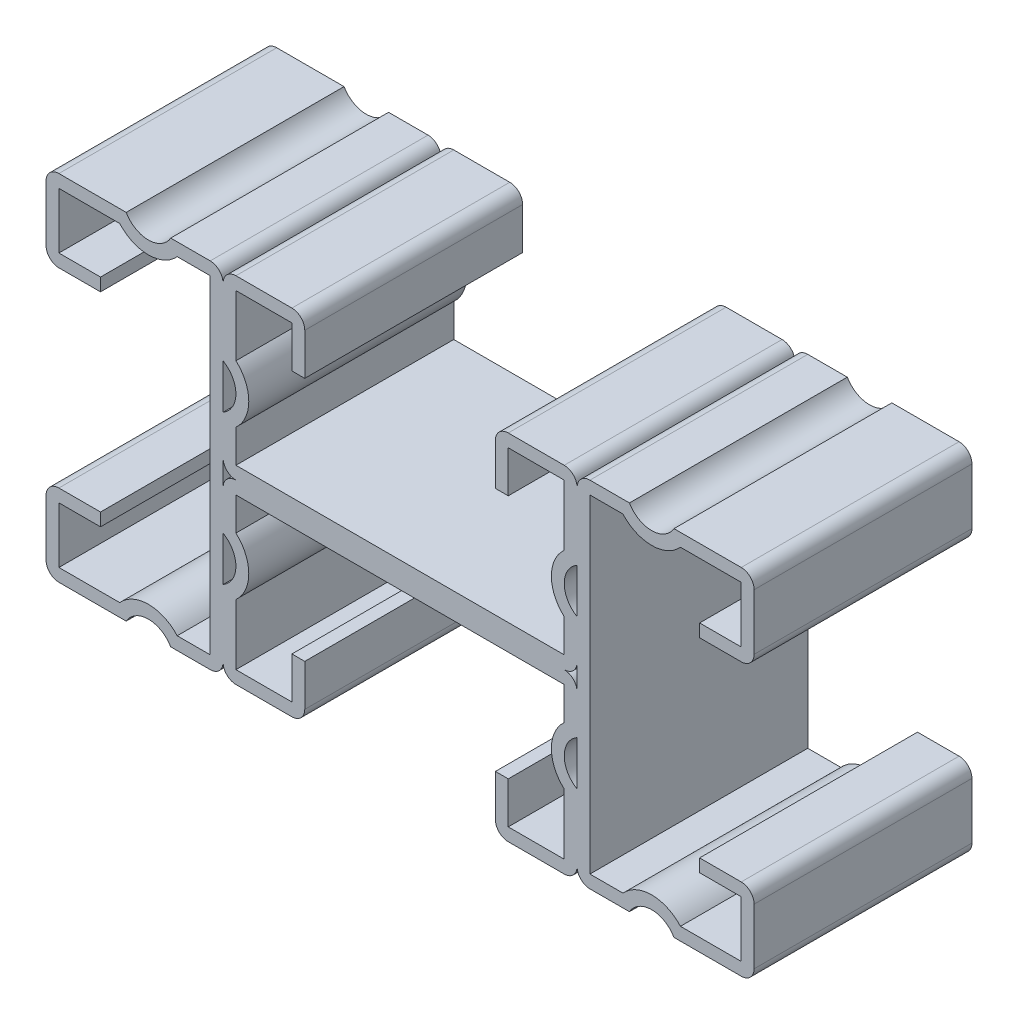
ISO-10303-21;
HEADER;
FILE_DESCRIPTION(('STEP AP214'),'2;1');
FILE_NAME('part.step','',(''),(''),'','','');
FILE_SCHEMA(('AUTOMOTIVE_DESIGN { 1 0 10303 214 1 1 1 1 }'));
ENDSEC;
DATA;
#1=APPLICATION_CONTEXT('core data for automotive mechanical design processes');
#2=APPLICATION_PROTOCOL_DEFINITION('international standard','automotive_design',2000,#1);
#3=PRODUCT_CONTEXT('',#1,'mechanical');
#4=PRODUCT('Part','Part','',(#3));
#5=PRODUCT_RELATED_PRODUCT_CATEGORY('part','',(#4));
#6=PRODUCT_DEFINITION_FORMATION('','',#4);
#7=PRODUCT_DEFINITION_CONTEXT('part definition',#1,'design');
#8=PRODUCT_DEFINITION('design','',#6,#7);
#9=PRODUCT_DEFINITION_SHAPE('','',#8);
#10=(LENGTH_UNIT() NAMED_UNIT(*) SI_UNIT(.MILLI.,.METRE.));
#11=(NAMED_UNIT(*) PLANE_ANGLE_UNIT() SI_UNIT($,.RADIAN.));
#12=(NAMED_UNIT(*) SI_UNIT($,.STERADIAN.) SOLID_ANGLE_UNIT());
#13=UNCERTAINTY_MEASURE_WITH_UNIT(LENGTH_MEASURE(1.E-05),#10,'distance_accuracy_value','');
#14=(GEOMETRIC_REPRESENTATION_CONTEXT(3) GLOBAL_UNCERTAINTY_ASSIGNED_CONTEXT((#13)) GLOBAL_UNIT_ASSIGNED_CONTEXT((#10,
#11,#12)) REPRESENTATION_CONTEXT('',''));
#15=CARTESIAN_POINT('',(0.,0.,0.));
#16=DIRECTION('',(0.,0.,1.));
#17=DIRECTION('',(1.,0.,0.));
#18=AXIS2_PLACEMENT_3D('',#15,#16,#17);
#19=CARTESIAN_POINT('',(-19.1389,19.1389,12.7));
#20=DIRECTION('',(-1.,0.,0.));
#21=DIRECTION('',(0.,0.,1.));
#22=AXIS2_PLACEMENT_3D('',#19,#20,#21);
#23=PLANE('',#22);
#24=DIRECTION('',(0.,1.,0.));
#25=VECTOR('',#24,1.);
#26=CARTESIAN_POINT('',(-19.1389,19.1389,-12.7));
#27=LINE('',#26,#25);
#28=CARTESIAN_POINT('',(-19.1389,12.0504714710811,-12.7));
#29=VERTEX_POINT('',#28);
#30=CARTESIAN_POINT('',(-19.1389,19.1389,-12.7));
#31=VERTEX_POINT('',#30);
#32=EDGE_CURVE('E250',#29,#31,#27,.T.);
#33=ORIENTED_EDGE('',*,*,#32,.T.);
#34=DIRECTION('',(0.,0.,-1.));
#35=VECTOR('',#34,1.);
#36=CARTESIAN_POINT('',(-19.1389,19.1389,12.7));
#37=LINE('',#36,#35);
#38=CARTESIAN_POINT('',(-19.1389,19.1389,12.7));
#39=VERTEX_POINT('',#38);
#40=EDGE_CURVE('E11',#39,#31,#37,.T.);
#41=ORIENTED_EDGE('',*,*,#40,.F.);
#42=DIRECTION('',(0.,1.,0.));
#43=VECTOR('',#42,1.);
#44=CARTESIAN_POINT('',(-19.1389,19.1389,12.7));
#45=LINE('',#44,#43);
#46=CARTESIAN_POINT('',(-19.1389,12.0504714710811,12.7));
#47=VERTEX_POINT('',#46);
#48=EDGE_CURVE('E299',#47,#39,#45,.T.);
#49=ORIENTED_EDGE('',*,*,#48,.F.);
#50=DIRECTION('',(0.,0.,-1.));
#51=VECTOR('',#50,1.);
#52=CARTESIAN_POINT('',(-19.1389,12.0504714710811,12.7));
#53=LINE('',#52,#51);
#54=EDGE_CURVE('E246',#47,#29,#53,.T.);
#55=ORIENTED_EDGE('',*,*,#54,.T.);
#56=EDGE_LOOP('',(#33,#41,#49,#55));
#57=FACE_BOUND('',#56,.T.);
#58=ADVANCED_FACE('F32',(#57),#23,.F.);
#59=CARTESIAN_POINT('',(-19.1389,19.1389,12.7));
#60=DIRECTION('',(0.,1.,0.));
#61=DIRECTION('',(0.,0.,1.));
#62=AXIS2_PLACEMENT_3D('',#59,#60,#61);
#63=PLANE('',#62);
#64=DIRECTION('',(1.,0.,0.));
#65=VECTOR('',#64,1.);
#66=CARTESIAN_POINT('',(-19.1389,19.1389,-12.7));
#67=LINE('',#66,#65);
#68=CARTESIAN_POINT('',(-12.6111,19.1389,-12.7));
#69=VERTEX_POINT('',#68);
#70=EDGE_CURVE('E253',#31,#69,#67,.T.);
#71=ORIENTED_EDGE('',*,*,#70,.T.);
#72=DIRECTION('',(0.,0.,-1.));
#73=VECTOR('',#72,1.);
#74=CARTESIAN_POINT('',(-12.6111,19.1389,12.7));
#75=LINE('',#74,#73);
#76=CARTESIAN_POINT('',(-12.6111,19.1389,12.7));
#77=VERTEX_POINT('',#76);
#78=EDGE_CURVE('E40',#77,#69,#75,.T.);
#79=ORIENTED_EDGE('',*,*,#78,.F.);
#80=DIRECTION('',(1.,0.,0.));
#81=VECTOR('',#80,1.);
#82=CARTESIAN_POINT('',(-19.1389,19.1389,12.7));
#83=LINE('',#82,#81);
#84=EDGE_CURVE('E143',#39,#77,#83,.T.);
#85=ORIENTED_EDGE('',*,*,#84,.F.);
#86=ORIENTED_EDGE('',*,*,#40,.T.);
#87=EDGE_LOOP('',(#71,#79,#85,#86));
#88=FACE_BOUND('',#87,.T.);
#89=ADVANCED_FACE('F460',(#88),#63,.F.);
#90=CARTESIAN_POINT('',(-12.6111,19.1389,12.7));
#91=DIRECTION('',(1.,0.,0.));
#92=DIRECTION('',(0.,1.,0.));
#93=AXIS2_PLACEMENT_3D('',#90,#91,#92);
#94=PLANE('',#93);
#95=DIRECTION('',(0.,-1.,0.));
#96=VECTOR('',#95,1.);
#97=CARTESIAN_POINT('',(-12.6111,19.1389,-12.7));
#98=LINE('',#97,#96);
#99=CARTESIAN_POINT('',(-12.6111,14.2875,-12.7));
#100=VERTEX_POINT('',#99);
#101=EDGE_CURVE('E256',#69,#100,#98,.T.);
#102=ORIENTED_EDGE('',*,*,#101,.T.);
#103=DIRECTION('',(0.,0.,-1.));
#104=VECTOR('',#103,1.);
#105=CARTESIAN_POINT('',(-12.6111,14.2875,12.7));
#106=LINE('',#105,#104);
#107=CARTESIAN_POINT('',(-12.6111,14.2875,12.7));
#108=VERTEX_POINT('',#107);
#109=EDGE_CURVE('E372',#108,#100,#106,.T.);
#110=ORIENTED_EDGE('',*,*,#109,.F.);
#111=DIRECTION('',(0.,-1.,0.));
#112=VECTOR('',#111,1.);
#113=CARTESIAN_POINT('',(-12.6111,19.1389,12.7));
#114=LINE('',#113,#112);
#115=EDGE_CURVE('E380',#77,#108,#114,.T.);
#116=ORIENTED_EDGE('',*,*,#115,.F.);
#117=ORIENTED_EDGE('',*,*,#78,.T.);
#118=EDGE_LOOP('',(#102,#110,#116,#117));
#119=FACE_BOUND('',#118,.T.);
#120=ADVANCED_FACE('F378',(#119),#94,.F.);
#121=CARTESIAN_POINT('',(-12.6111,14.2875,12.7));
#122=DIRECTION('',(0.,1.,0.));
#123=DIRECTION('',(0.,0.,1.));
#124=AXIS2_PLACEMENT_3D('',#121,#122,#123);
#125=PLANE('',#124);
#126=DIRECTION('',(1.,0.,0.));
#127=VECTOR('',#126,1.);
#128=CARTESIAN_POINT('',(-12.6111,14.2875,-12.7));
#129=LINE('',#128,#127);
#130=CARTESIAN_POINT('',(-11.1125,14.2875,-12.7));
#131=VERTEX_POINT('',#130);
#132=EDGE_CURVE('E258',#100,#131,#129,.T.);
#133=ORIENTED_EDGE('',*,*,#132,.T.);
#134=DIRECTION('',(0.,0.,-1.));
#135=VECTOR('',#134,1.);
#136=CARTESIAN_POINT('',(-11.1125,14.2875,12.7));
#137=LINE('',#136,#135);
#138=CARTESIAN_POINT('',(-11.1125,14.2875,12.7));
#139=VERTEX_POINT('',#138);
#140=EDGE_CURVE('E369',#139,#131,#137,.T.);
#141=ORIENTED_EDGE('',*,*,#140,.F.);
#142=DIRECTION('',(1.,0.,0.));
#143=VECTOR('',#142,1.);
#144=CARTESIAN_POINT('',(-12.6111,14.2875,12.7));
#145=LINE('',#144,#143);
#146=EDGE_CURVE('E400',#108,#139,#145,.T.);
#147=ORIENTED_EDGE('',*,*,#146,.F.);
#148=ORIENTED_EDGE('',*,*,#109,.T.);
#149=EDGE_LOOP('',(#133,#141,#147,#148));
#150=FACE_BOUND('',#149,.T.);
#151=ADVANCED_FACE('F391',(#150),#125,.F.);
#152=CARTESIAN_POINT('',(-11.1125,19.1389,12.7));
#153=DIRECTION('',(-1.,0.,0.));
#154=DIRECTION('',(0.,-1.,0.));
#155=AXIS2_PLACEMENT_3D('',#152,#153,#154);
#156=PLANE('',#155);
#157=DIRECTION('',(0.,1.,0.));
#158=VECTOR('',#157,1.);
#159=CARTESIAN_POINT('',(-11.1125,19.1389,-12.7));
#160=LINE('',#159,#158);
#161=CARTESIAN_POINT('',(-11.1125,19.1389,-12.7));
#162=VERTEX_POINT('',#161);
#163=EDGE_CURVE('E260',#131,#162,#160,.T.);
#164=ORIENTED_EDGE('',*,*,#163,.T.);
#165=DIRECTION('',(0.,0.,-1.));
#166=VECTOR('',#165,1.);
#167=CARTESIAN_POINT('',(-11.1125,19.1389,12.7));
#168=LINE('',#167,#166);
#169=CARTESIAN_POINT('',(-11.1125,19.1389,12.7));
#170=VERTEX_POINT('',#169);
#171=EDGE_CURVE('E366',#170,#162,#168,.T.);
#172=ORIENTED_EDGE('',*,*,#171,.F.);
#173=DIRECTION('',(0.,1.,0.));
#174=VECTOR('',#173,1.);
#175=CARTESIAN_POINT('',(-11.1125,19.1389,12.7));
#176=LINE('',#175,#174);
#177=EDGE_CURVE('E397',#139,#170,#176,.T.);
#178=ORIENTED_EDGE('',*,*,#177,.F.);
#179=ORIENTED_EDGE('',*,*,#140,.T.);
#180=EDGE_LOOP('',(#164,#172,#178,#179));
#181=FACE_BOUND('',#180,.T.);
#182=ADVANCED_FACE('F395',(#181),#156,.F.);
#183=CARTESIAN_POINT('',(-12.6111,19.1389,12.7));
#184=DIRECTION('',(0.,0.,-1.));
#185=DIRECTION('',(-1.,0.,0.));
#186=AXIS2_PLACEMENT_3D('',#183,#184,#185);
#187=CYLINDRICAL_SURFACE('',#186,1.4986);
#188=CARTESIAN_POINT('',(-12.6111,19.1389,-12.7));
#189=DIRECTION('',(0.,0.,1.));
#190=DIRECTION('',(-1.,0.,0.));
#191=AXIS2_PLACEMENT_3D('',#188,#189,#190);
#192=CIRCLE('',#191,1.4986);
#193=CARTESIAN_POINT('',(-12.6111,20.6375,-12.7));
#194=VERTEX_POINT('',#193);
#195=EDGE_CURVE('E262',#162,#194,#192,.T.);
#196=ORIENTED_EDGE('',*,*,#195,.T.);
#197=DIRECTION('',(0.,0.,-1.));
#198=VECTOR('',#197,1.);
#199=CARTESIAN_POINT('',(-12.6111,20.6375,12.7));
#200=LINE('',#199,#198);
#201=CARTESIAN_POINT('',(-12.6111,20.6375,12.7));
#202=VERTEX_POINT('',#201);
#203=EDGE_CURVE('E363',#202,#194,#200,.T.);
#204=ORIENTED_EDGE('',*,*,#203,.F.);
#205=CARTESIAN_POINT('',(-12.6111,19.1389,12.7));
#206=DIRECTION('',(0.,0.,1.));
#207=DIRECTION('',(-1.,0.,0.));
#208=AXIS2_PLACEMENT_3D('',#205,#206,#207);
#209=CIRCLE('',#208,1.4986);
#210=EDGE_CURVE('E399',#170,#202,#209,.T.);
#211=ORIENTED_EDGE('',*,*,#210,.F.);
#212=ORIENTED_EDGE('',*,*,#171,.T.);
#213=EDGE_LOOP('',(#196,#204,#211,#212));
#214=FACE_BOUND('',#213,.T.);
#215=ADVANCED_FACE('F473',(#214),#187,.T.);
#216=CARTESIAN_POINT('',(-19.1389,20.6375,12.7));
#217=DIRECTION('',(0.,-1.,0.));
#218=DIRECTION('',(0.,0.,-1.));
#219=AXIS2_PLACEMENT_3D('',#216,#217,#218);
#220=PLANE('',#219);
#221=DIRECTION('',(-1.,0.,0.));
#222=VECTOR('',#221,1.);
#223=CARTESIAN_POINT('',(-19.1389,20.6375,-12.7));
#224=LINE('',#223,#222);
#225=CARTESIAN_POINT('',(-19.1389,20.6375,-12.7));
#226=VERTEX_POINT('',#225);
#227=EDGE_CURVE('E264',#194,#226,#224,.T.);
#228=ORIENTED_EDGE('',*,*,#227,.T.);
#229=DIRECTION('',(0.,0.,-1.));
#230=VECTOR('',#229,1.);
#231=CARTESIAN_POINT('',(-19.1389,20.6375,12.7));
#232=LINE('',#231,#230);
#233=CARTESIAN_POINT('',(-19.1389,20.6375,12.7));
#234=VERTEX_POINT('',#233);
#235=EDGE_CURVE('E360',#234,#226,#232,.T.);
#236=ORIENTED_EDGE('',*,*,#235,.F.);
#237=DIRECTION('',(-1.,0.,0.));
#238=VECTOR('',#237,1.);
#239=CARTESIAN_POINT('',(-19.1389,20.6375,12.7));
#240=LINE('',#239,#238);
#241=EDGE_CURVE('E402',#202,#234,#240,.T.);
#242=ORIENTED_EDGE('',*,*,#241,.F.);
#243=ORIENTED_EDGE('',*,*,#203,.T.);
#244=EDGE_LOOP('',(#228,#236,#242,#243));
#245=FACE_BOUND('',#244,.T.);
#246=ADVANCED_FACE('F476',(#245),#220,.F.);
#247=CARTESIAN_POINT('',(-19.1389,19.1389,12.7));
#248=DIRECTION('',(0.,0.,-1.));
#249=DIRECTION('',(-1.,0.,0.));
#250=AXIS2_PLACEMENT_3D('',#247,#248,#249);
#251=CYLINDRICAL_SURFACE('',#250,1.4986);
#252=CARTESIAN_POINT('',(-19.1389,19.1389,-12.7));
#253=DIRECTION('',(0.,0.,1.));
#254=DIRECTION('',(-1.,0.,0.));
#255=AXIS2_PLACEMENT_3D('',#252,#253,#254);
#256=CIRCLE('',#255,1.4986);
#257=CARTESIAN_POINT('',(-20.6375,19.1389,-12.7));
#258=VERTEX_POINT('',#257);
#259=EDGE_CURVE('E266',#226,#258,#256,.T.);
#260=ORIENTED_EDGE('',*,*,#259,.T.);
#261=DIRECTION('',(0.,0.,-1.));
#262=VECTOR('',#261,1.);
#263=CARTESIAN_POINT('',(-20.6375,19.1389,12.7));
#264=LINE('',#263,#262);
#265=CARTESIAN_POINT('',(-20.6375,19.1389,12.7));
#266=VERTEX_POINT('',#265);
#267=EDGE_CURVE('E357',#266,#258,#264,.T.);
#268=ORIENTED_EDGE('',*,*,#267,.F.);
#269=CARTESIAN_POINT('',(-19.1389,19.1389,12.7));
#270=DIRECTION('',(0.,0.,1.));
#271=DIRECTION('',(-1.,0.,0.));
#272=AXIS2_PLACEMENT_3D('',#269,#270,#271);
#273=CIRCLE('',#272,1.4986);
#274=EDGE_CURVE('E408',#234,#266,#273,.T.);
#275=ORIENTED_EDGE('',*,*,#274,.F.);
#276=ORIENTED_EDGE('',*,*,#235,.T.);
#277=EDGE_LOOP('',(#260,#268,#275,#276));
#278=FACE_BOUND('',#277,.T.);
#279=ADVANCED_FACE('F480',(#278),#251,.T.);
#280=CARTESIAN_POINT('',(-22.1361,8.69949999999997,12.7));
#281=DIRECTION('',(0.,0.,-1.));
#282=DIRECTION('',(-1.,0.,0.));
#283=AXIS2_PLACEMENT_3D('',#280,#281,#282);
#284=CYLINDRICAL_SURFACE('',#283,2.9972);
#285=CARTESIAN_POINT('',(-22.1361,8.69949999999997,-12.7));
#286=DIRECTION('',(0.,0.,-1.));
#287=DIRECTION('',(1.,0.,0.));
#288=AXIS2_PLACEMENT_3D('',#285,#286,#287);
#289=CIRCLE('',#288,2.9972);
#290=CARTESIAN_POINT('',(-20.6375,11.2951513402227,-12.7));
#291=VERTEX_POINT('',#290);
#292=CARTESIAN_POINT('',(-20.6375,6.10384865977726,-12.7));
#293=VERTEX_POINT('',#292);
#294=EDGE_CURVE('E268',#291,#293,#289,.T.);
#295=ORIENTED_EDGE('',*,*,#294,.T.);
#296=DIRECTION('',(0.,0.,-1.));
#297=VECTOR('',#296,1.);
#298=CARTESIAN_POINT('',(-20.6375,6.10384865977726,12.7));
#299=LINE('',#298,#297);
#300=CARTESIAN_POINT('',(-20.6375,6.10384865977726,12.7));
#301=VERTEX_POINT('',#300);
#302=EDGE_CURVE('E351',#301,#293,#299,.T.);
#303=ORIENTED_EDGE('',*,*,#302,.F.);
#304=CARTESIAN_POINT('',(-22.1361,8.69949999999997,12.7));
#305=DIRECTION('',(0.,0.,-1.));
#306=DIRECTION('',(1.,0.,0.));
#307=AXIS2_PLACEMENT_3D('',#304,#305,#306);
#308=CIRCLE('',#307,2.9972);
#309=CARTESIAN_POINT('',(-20.6375,11.2951513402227,12.7));
#310=VERTEX_POINT('',#309);
#311=EDGE_CURVE('E410',#310,#301,#308,.T.);
#312=ORIENTED_EDGE('',*,*,#311,.F.);
#313=DIRECTION('',(0.,0.,-1.));
#314=VECTOR('',#313,1.);
#315=CARTESIAN_POINT('',(-20.6375,11.2951513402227,12.7));
#316=LINE('',#315,#314);
#317=EDGE_CURVE('E354',#310,#291,#316,.T.);
#318=ORIENTED_EDGE('',*,*,#317,.T.);
#319=EDGE_LOOP('',(#295,#303,#312,#318));
#320=FACE_BOUND('',#319,.T.);
#321=ADVANCED_FACE('F484',(#320),#284,.F.);
#322=CARTESIAN_POINT('',(-19.1389,1.4986,12.7));
#323=DIRECTION('',(0.,0.,-1.));
#324=DIRECTION('',(-1.,0.,0.));
#325=AXIS2_PLACEMENT_3D('',#322,#323,#324);
#326=CYLINDRICAL_SURFACE('',#325,1.4986);
#327=CARTESIAN_POINT('',(-19.1389,1.4986,-12.7));
#328=DIRECTION('',(0.,0.,1.));
#329=DIRECTION('',(-1.,0.,0.));
#330=AXIS2_PLACEMENT_3D('',#327,#328,#329);
#331=CIRCLE('',#330,1.4986);
#332=CARTESIAN_POINT('',(-20.6375,1.4986,-12.7));
#333=VERTEX_POINT('',#332);
#334=CARTESIAN_POINT('',(-19.1389,0.,-12.7));
#335=VERTEX_POINT('',#334);
#336=EDGE_CURVE('E270',#333,#335,#331,.T.);
#337=ORIENTED_EDGE('',*,*,#336,.T.);
#338=DIRECTION('',(0.,0.,-1.));
#339=VECTOR('',#338,1.);
#340=CARTESIAN_POINT('',(-19.1389,0.,12.7));
#341=LINE('',#340,#339);
#342=CARTESIAN_POINT('',(-19.1389,0.,12.7));
#343=VERTEX_POINT('',#342);
#344=EDGE_CURVE('E345',#343,#335,#341,.T.);
#345=ORIENTED_EDGE('',*,*,#344,.F.);
#346=CARTESIAN_POINT('',(-19.1389,1.4986,12.7));
#347=DIRECTION('',(0.,0.,1.));
#348=DIRECTION('',(-1.,0.,0.));
#349=AXIS2_PLACEMENT_3D('',#346,#347,#348);
#350=CIRCLE('',#349,1.4986);
#351=CARTESIAN_POINT('',(-20.6375,1.4986,12.7));
#352=VERTEX_POINT('',#351);
#353=EDGE_CURVE('E412',#352,#343,#350,.T.);
#354=ORIENTED_EDGE('',*,*,#353,.F.);
#355=DIRECTION('',(0.,0.,-1.));
#356=VECTOR('',#355,1.);
#357=CARTESIAN_POINT('',(-20.6375,1.4986,12.7));
#358=LINE('',#357,#356);
#359=EDGE_CURVE('E348',#352,#333,#358,.T.);
#360=ORIENTED_EDGE('',*,*,#359,.T.);
#361=EDGE_LOOP('',(#337,#345,#354,#360));
#362=FACE_BOUND('',#361,.T.);
#363=ADVANCED_FACE('F488',(#362),#326,.T.);
#364=CARTESIAN_POINT('',(19.1389,1.49860000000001,12.7));
#365=DIRECTION('',(0.,0.,-1.));
#366=DIRECTION('',(-1.,0.,0.));
#367=AXIS2_PLACEMENT_3D('',#364,#365,#366);
#368=CYLINDRICAL_SURFACE('',#367,1.4986);
#369=CARTESIAN_POINT('',(19.1389,1.49860000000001,-12.7));
#370=DIRECTION('',(0.,0.,1.));
#371=DIRECTION('',(-1.,0.,0.));
#372=AXIS2_PLACEMENT_3D('',#369,#370,#371);
#373=CIRCLE('',#372,1.4986);
#374=CARTESIAN_POINT('',(19.1389,0.,-12.7));
#375=VERTEX_POINT('',#374);
#376=CARTESIAN_POINT('',(20.6375,1.49860000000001,-12.7));
#377=VERTEX_POINT('',#376);
#378=EDGE_CURVE('E272',#375,#377,#373,.T.);
#379=ORIENTED_EDGE('',*,*,#378,.T.);
#380=DIRECTION('',(0.,0.,-1.));
#381=VECTOR('',#380,1.);
#382=CARTESIAN_POINT('',(20.6375,1.49860000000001,12.7));
#383=LINE('',#382,#381);
#384=CARTESIAN_POINT('',(20.6375,1.49860000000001,12.7));
#385=VERTEX_POINT('',#384);
#386=EDGE_CURVE('E339',#385,#377,#383,.T.);
#387=ORIENTED_EDGE('',*,*,#386,.F.);
#388=CARTESIAN_POINT('',(19.1389,1.49860000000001,12.7));
#389=DIRECTION('',(0.,0.,1.));
#390=DIRECTION('',(-1.,0.,0.));
#391=AXIS2_PLACEMENT_3D('',#388,#389,#390);
#392=CIRCLE('',#391,1.4986);
#393=CARTESIAN_POINT('',(19.1389,0.,12.7));
#394=VERTEX_POINT('',#393);
#395=EDGE_CURVE('E414',#394,#385,#392,.T.);
#396=ORIENTED_EDGE('',*,*,#395,.F.);
#397=DIRECTION('',(0.,0.,-1.));
#398=VECTOR('',#397,1.);
#399=CARTESIAN_POINT('',(19.1389,0.,12.7));
#400=LINE('',#399,#398);
#401=EDGE_CURVE('E342',#394,#375,#400,.T.);
#402=ORIENTED_EDGE('',*,*,#401,.T.);
#403=EDGE_LOOP('',(#379,#387,#396,#402));
#404=FACE_BOUND('',#403,.T.);
#405=ADVANCED_FACE('F492',(#404),#368,.T.);
#406=CARTESIAN_POINT('',(22.1361,8.69949999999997,12.7));
#407=DIRECTION('',(0.,0.,-1.));
#408=DIRECTION('',(-1.,0.,0.));
#409=AXIS2_PLACEMENT_3D('',#406,#407,#408);
#410=CYLINDRICAL_SURFACE('',#409,2.9972);
#411=CARTESIAN_POINT('',(22.1361,8.69949999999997,-12.7));
#412=DIRECTION('',(0.,0.,-1.));
#413=DIRECTION('',(1.,0.,0.));
#414=AXIS2_PLACEMENT_3D('',#411,#412,#413);
#415=CIRCLE('',#414,2.9972);
#416=CARTESIAN_POINT('',(20.6375,6.10384865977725,-12.7));
#417=VERTEX_POINT('',#416);
#418=CARTESIAN_POINT('',(20.6375,11.2951513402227,-12.7));
#419=VERTEX_POINT('',#418);
#420=EDGE_CURVE('E274',#417,#419,#415,.T.);
#421=ORIENTED_EDGE('',*,*,#420,.T.);
#422=DIRECTION('',(0.,0.,-1.));
#423=VECTOR('',#422,1.);
#424=CARTESIAN_POINT('',(20.6375,11.2951513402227,12.7));
#425=LINE('',#424,#423);
#426=CARTESIAN_POINT('',(20.6375,11.2951513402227,12.7));
#427=VERTEX_POINT('',#426);
#428=EDGE_CURVE('E333',#427,#419,#425,.T.);
#429=ORIENTED_EDGE('',*,*,#428,.F.);
#430=CARTESIAN_POINT('',(22.1361,8.69949999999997,12.7));
#431=DIRECTION('',(0.,0.,-1.));
#432=DIRECTION('',(1.,0.,0.));
#433=AXIS2_PLACEMENT_3D('',#430,#431,#432);
#434=CIRCLE('',#433,2.9972);
#435=CARTESIAN_POINT('',(20.6375,6.10384865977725,12.7));
#436=VERTEX_POINT('',#435);
#437=EDGE_CURVE('E416',#436,#427,#434,.T.);
#438=ORIENTED_EDGE('',*,*,#437,.F.);
#439=DIRECTION('',(0.,0.,-1.));
#440=VECTOR('',#439,1.);
#441=CARTESIAN_POINT('',(20.6375,6.10384865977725,12.7));
#442=LINE('',#441,#440);
#443=EDGE_CURVE('E336',#436,#417,#442,.T.);
#444=ORIENTED_EDGE('',*,*,#443,.T.);
#445=EDGE_LOOP('',(#421,#429,#438,#444));
#446=FACE_BOUND('',#445,.T.);
#447=ADVANCED_FACE('F496',(#446),#410,.F.);
#448=CARTESIAN_POINT('',(19.1389,19.1389,12.7));
#449=DIRECTION('',(0.,0.,-1.));
#450=DIRECTION('',(-1.,0.,0.));
#451=AXIS2_PLACEMENT_3D('',#448,#449,#450);
#452=CYLINDRICAL_SURFACE('',#451,1.4986);
#453=CARTESIAN_POINT('',(19.1389,19.1389,-12.7));
#454=DIRECTION('',(0.,0.,1.));
#455=DIRECTION('',(-1.,0.,0.));
#456=AXIS2_PLACEMENT_3D('',#453,#454,#455);
#457=CIRCLE('',#456,1.4986);
#458=CARTESIAN_POINT('',(20.6375,19.1389,-12.7));
#459=VERTEX_POINT('',#458);
#460=CARTESIAN_POINT('',(19.1389,20.6375,-12.7));
#461=VERTEX_POINT('',#460);
#462=EDGE_CURVE('E276',#459,#461,#457,.T.);
#463=ORIENTED_EDGE('',*,*,#462,.T.);
#464=DIRECTION('',(0.,0.,-1.));
#465=VECTOR('',#464,1.);
#466=CARTESIAN_POINT('',(19.1389,20.6375,12.7));
#467=LINE('',#466,#465);
#468=CARTESIAN_POINT('',(19.1389,20.6375,12.7));
#469=VERTEX_POINT('',#468);
#470=EDGE_CURVE('E327',#469,#461,#467,.T.);
#471=ORIENTED_EDGE('',*,*,#470,.F.);
#472=CARTESIAN_POINT('',(19.1389,19.1389,12.7));
#473=DIRECTION('',(0.,0.,1.));
#474=DIRECTION('',(-1.,0.,0.));
#475=AXIS2_PLACEMENT_3D('',#472,#473,#474);
#476=CIRCLE('',#475,1.4986);
#477=CARTESIAN_POINT('',(20.6375,19.1389,12.7));
#478=VERTEX_POINT('',#477);
#479=EDGE_CURVE('E418',#478,#469,#476,.T.);
#480=ORIENTED_EDGE('',*,*,#479,.F.);
#481=DIRECTION('',(0.,0.,-1.));
#482=VECTOR('',#481,1.);
#483=CARTESIAN_POINT('',(20.6375,19.1389,12.7));
#484=LINE('',#483,#482);
#485=EDGE_CURVE('E330',#478,#459,#484,.T.);
#486=ORIENTED_EDGE('',*,*,#485,.T.);
#487=EDGE_LOOP('',(#463,#471,#480,#486));
#488=FACE_BOUND('',#487,.T.);
#489=ADVANCED_FACE('F500',(#488),#452,.T.);
#490=CARTESIAN_POINT('',(19.1389,20.6375,12.7));
#491=DIRECTION('',(0.,-1.,0.));
#492=DIRECTION('',(1.,0.,0.));
#493=AXIS2_PLACEMENT_3D('',#490,#491,#492);
#494=PLANE('',#493);
#495=DIRECTION('',(-1.,0.,0.));
#496=VECTOR('',#495,1.);
#497=CARTESIAN_POINT('',(19.1389,20.6375,-12.7));
#498=LINE('',#497,#496);
#499=CARTESIAN_POINT('',(12.6111,20.6375,-12.7));
#500=VERTEX_POINT('',#499);
#501=EDGE_CURVE('E278',#461,#500,#498,.T.);
#502=ORIENTED_EDGE('',*,*,#501,.T.);
#503=DIRECTION('',(0.,0.,-1.));
#504=VECTOR('',#503,1.);
#505=CARTESIAN_POINT('',(12.6111,20.6375,12.7));
#506=LINE('',#505,#504);
#507=CARTESIAN_POINT('',(12.6111,20.6375,12.7));
#508=VERTEX_POINT('',#507);
#509=EDGE_CURVE('E324',#508,#500,#506,.T.);
#510=ORIENTED_EDGE('',*,*,#509,.F.);
#511=DIRECTION('',(-1.,0.,0.));
#512=VECTOR('',#511,1.);
#513=CARTESIAN_POINT('',(19.1389,20.6375,12.7));
#514=LINE('',#513,#512);
#515=EDGE_CURVE('E420',#469,#508,#514,.T.);
#516=ORIENTED_EDGE('',*,*,#515,.F.);
#517=ORIENTED_EDGE('',*,*,#470,.T.);
#518=EDGE_LOOP('',(#502,#510,#516,#517));
#519=FACE_BOUND('',#518,.T.);
#520=ADVANCED_FACE('F504',(#519),#494,.F.);
#521=CARTESIAN_POINT('',(12.6111,19.1389,12.7));
#522=DIRECTION('',(0.,0.,-1.));
#523=DIRECTION('',(-1.,0.,0.));
#524=AXIS2_PLACEMENT_3D('',#521,#522,#523);
#525=CYLINDRICAL_SURFACE('',#524,1.4986);
#526=CARTESIAN_POINT('',(12.6111,19.1389,-12.7));
#527=DIRECTION('',(0.,0.,1.));
#528=DIRECTION('',(-1.,0.,0.));
#529=AXIS2_PLACEMENT_3D('',#526,#527,#528);
#530=CIRCLE('',#529,1.4986);
#531=CARTESIAN_POINT('',(11.1125,19.1389,-12.7));
#532=VERTEX_POINT('',#531);
#533=EDGE_CURVE('E280',#500,#532,#530,.T.);
#534=ORIENTED_EDGE('',*,*,#533,.T.);
#535=DIRECTION('',(0.,0.,-1.));
#536=VECTOR('',#535,1.);
#537=CARTESIAN_POINT('',(11.1125,19.1389,12.7));
#538=LINE('',#537,#536);
#539=CARTESIAN_POINT('',(11.1125,19.1389,12.7));
#540=VERTEX_POINT('',#539);
#541=EDGE_CURVE('E321',#540,#532,#538,.T.);
#542=ORIENTED_EDGE('',*,*,#541,.F.);
#543=CARTESIAN_POINT('',(12.6111,19.1389,12.7));
#544=DIRECTION('',(0.,0.,1.));
#545=DIRECTION('',(-1.,0.,0.));
#546=AXIS2_PLACEMENT_3D('',#543,#544,#545);
#547=CIRCLE('',#546,1.4986);
#548=EDGE_CURVE('E422',#508,#540,#547,.T.);
#549=ORIENTED_EDGE('',*,*,#548,.F.);
#550=ORIENTED_EDGE('',*,*,#509,.T.);
#551=EDGE_LOOP('',(#534,#542,#549,#550));
#552=FACE_BOUND('',#551,.T.);
#553=ADVANCED_FACE('F508',(#552),#525,.T.);
#554=CARTESIAN_POINT('',(11.1125,19.1389,12.7));
#555=DIRECTION('',(1.,0.,0.));
#556=DIRECTION('',(0.,1.,0.));
#557=AXIS2_PLACEMENT_3D('',#554,#555,#556);
#558=PLANE('',#557);
#559=DIRECTION('',(0.,-1.,0.));
#560=VECTOR('',#559,1.);
#561=CARTESIAN_POINT('',(11.1125,19.1389,-12.7));
#562=LINE('',#561,#560);
#563=CARTESIAN_POINT('',(11.1125,14.2875,-12.7));
#564=VERTEX_POINT('',#563);
#565=EDGE_CURVE('E282',#532,#564,#562,.T.);
#566=ORIENTED_EDGE('',*,*,#565,.T.);
#567=DIRECTION('',(0.,0.,-1.));
#568=VECTOR('',#567,1.);
#569=CARTESIAN_POINT('',(11.1125,14.2875,12.7));
#570=LINE('',#569,#568);
#571=CARTESIAN_POINT('',(11.1125,14.2875,12.7));
#572=VERTEX_POINT('',#571);
#573=EDGE_CURVE('E318',#572,#564,#570,.T.);
#574=ORIENTED_EDGE('',*,*,#573,.F.);
#575=DIRECTION('',(0.,-1.,0.));
#576=VECTOR('',#575,1.);
#577=CARTESIAN_POINT('',(11.1125,19.1389,12.7));
#578=LINE('',#577,#576);
#579=EDGE_CURVE('E424',#540,#572,#578,.T.);
#580=ORIENTED_EDGE('',*,*,#579,.F.);
#581=ORIENTED_EDGE('',*,*,#541,.T.);
#582=EDGE_LOOP('',(#566,#574,#580,#581));
#583=FACE_BOUND('',#582,.T.);
#584=ADVANCED_FACE('F512',(#583),#558,.F.);
#585=CARTESIAN_POINT('',(11.1125,14.2875,12.7));
#586=DIRECTION('',(0.,1.,0.));
#587=DIRECTION('',(0.,0.,1.));
#588=AXIS2_PLACEMENT_3D('',#585,#586,#587);
#589=PLANE('',#588);
#590=DIRECTION('',(1.,0.,0.));
#591=VECTOR('',#590,1.);
#592=CARTESIAN_POINT('',(11.1125,14.2875,-12.7));
#593=LINE('',#592,#591);
#594=CARTESIAN_POINT('',(12.6111,14.2875,-12.7));
#595=VERTEX_POINT('',#594);
#596=EDGE_CURVE('E284',#564,#595,#593,.T.);
#597=ORIENTED_EDGE('',*,*,#596,.T.);
#598=DIRECTION('',(0.,0.,-1.));
#599=VECTOR('',#598,1.);
#600=CARTESIAN_POINT('',(12.6111,14.2875,12.7));
#601=LINE('',#600,#599);
#602=CARTESIAN_POINT('',(12.6111,14.2875,12.7));
#603=VERTEX_POINT('',#602);
#604=EDGE_CURVE('E315',#603,#595,#601,.T.);
#605=ORIENTED_EDGE('',*,*,#604,.F.);
#606=DIRECTION('',(1.,0.,0.));
#607=VECTOR('',#606,1.);
#608=CARTESIAN_POINT('',(11.1125,14.2875,12.7));
#609=LINE('',#608,#607);
#610=EDGE_CURVE('E426',#572,#603,#609,.T.);
#611=ORIENTED_EDGE('',*,*,#610,.F.);
#612=ORIENTED_EDGE('',*,*,#573,.T.);
#613=EDGE_LOOP('',(#597,#605,#611,#612));
#614=FACE_BOUND('',#613,.T.);
#615=ADVANCED_FACE('F516',(#614),#589,.F.);
#616=CARTESIAN_POINT('',(12.6111,19.1389,12.7));
#617=DIRECTION('',(-1.,0.,0.));
#618=DIRECTION('',(0.,0.,1.));
#619=AXIS2_PLACEMENT_3D('',#616,#617,#618);
#620=PLANE('',#619);
#621=DIRECTION('',(0.,1.,0.));
#622=VECTOR('',#621,1.);
#623=CARTESIAN_POINT('',(12.6111,19.1389,-12.7));
#624=LINE('',#623,#622);
#625=CARTESIAN_POINT('',(12.6111,19.1389,-12.7));
#626=VERTEX_POINT('',#625);
#627=EDGE_CURVE('E286',#595,#626,#624,.T.);
#628=ORIENTED_EDGE('',*,*,#627,.T.);
#629=DIRECTION('',(0.,0.,-1.));
#630=VECTOR('',#629,1.);
#631=CARTESIAN_POINT('',(12.6111,19.1389,12.7));
#632=LINE('',#631,#630);
#633=CARTESIAN_POINT('',(12.6111,19.1389,12.7));
#634=VERTEX_POINT('',#633);
#635=EDGE_CURVE('E312',#634,#626,#632,.T.);
#636=ORIENTED_EDGE('',*,*,#635,.F.);
#637=DIRECTION('',(0.,1.,0.));
#638=VECTOR('',#637,1.);
#639=CARTESIAN_POINT('',(12.6111,19.1389,12.7));
#640=LINE('',#639,#638);
#641=EDGE_CURVE('E428',#603,#634,#640,.T.);
#642=ORIENTED_EDGE('',*,*,#641,.F.);
#643=ORIENTED_EDGE('',*,*,#604,.T.);
#644=EDGE_LOOP('',(#628,#636,#642,#643));
#645=FACE_BOUND('',#644,.T.);
#646=ADVANCED_FACE('F520',(#645),#620,.F.);
#647=CARTESIAN_POINT('',(19.1389,19.1389,12.7));
#648=DIRECTION('',(0.,1.,0.));
#649=DIRECTION('',(-1.,0.,0.));
#650=AXIS2_PLACEMENT_3D('',#647,#648,#649);
#651=PLANE('',#650);
#652=DIRECTION('',(1.,0.,0.));
#653=VECTOR('',#652,1.);
#654=CARTESIAN_POINT('',(19.1389,19.1389,-12.7));
#655=LINE('',#654,#653);
#656=CARTESIAN_POINT('',(19.1389,19.1389,-12.7));
#657=VERTEX_POINT('',#656);
#658=EDGE_CURVE('E288',#626,#657,#655,.T.);
#659=ORIENTED_EDGE('',*,*,#658,.T.);
#660=DIRECTION('',(0.,0.,-1.));
#661=VECTOR('',#660,1.);
#662=CARTESIAN_POINT('',(19.1389,19.1389,12.7));
#663=LINE('',#662,#661);
#664=CARTESIAN_POINT('',(19.1389,19.1389,12.7));
#665=VERTEX_POINT('',#664);
#666=EDGE_CURVE('E309',#665,#657,#663,.T.);
#667=ORIENTED_EDGE('',*,*,#666,.F.);
#668=DIRECTION('',(1.,0.,0.));
#669=VECTOR('',#668,1.);
#670=CARTESIAN_POINT('',(19.1389,19.1389,12.7));
#671=LINE('',#670,#669);
#672=EDGE_CURVE('E430',#634,#665,#671,.T.);
#673=ORIENTED_EDGE('',*,*,#672,.F.);
#674=ORIENTED_EDGE('',*,*,#635,.T.);
#675=EDGE_LOOP('',(#659,#667,#673,#674));
#676=FACE_BOUND('',#675,.T.);
#677=ADVANCED_FACE('F524',(#676),#651,.F.);
#678=CARTESIAN_POINT('',(19.1389,12.0504714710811,12.7));
#679=DIRECTION('',(1.,0.,0.));
#680=DIRECTION('',(0.,0.,-1.));
#681=AXIS2_PLACEMENT_3D('',#678,#679,#680);
#682=PLANE('',#681);
#683=DIRECTION('',(0.,-1.,0.));
#684=VECTOR('',#683,1.);
#685=CARTESIAN_POINT('',(19.1389,12.0504714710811,-12.7));
#686=LINE('',#685,#684);
#687=CARTESIAN_POINT('',(19.1389,12.0504714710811,-12.7));
#688=VERTEX_POINT('',#687);
#689=EDGE_CURVE('E290',#657,#688,#686,.T.);
#690=ORIENTED_EDGE('',*,*,#689,.T.);
#691=DIRECTION('',(0.,0.,-1.));
#692=VECTOR('',#691,1.);
#693=CARTESIAN_POINT('',(19.1389,12.0504714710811,12.7));
#694=LINE('',#693,#692);
#695=CARTESIAN_POINT('',(19.1389,12.0504714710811,12.7));
#696=VERTEX_POINT('',#695);
#697=EDGE_CURVE('E306',#696,#688,#694,.T.);
#698=ORIENTED_EDGE('',*,*,#697,.F.);
#699=DIRECTION('',(0.,-1.,0.));
#700=VECTOR('',#699,1.);
#701=CARTESIAN_POINT('',(19.1389,12.0504714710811,12.7));
#702=LINE('',#701,#700);
#703=EDGE_CURVE('E432',#665,#696,#702,.T.);
#704=ORIENTED_EDGE('',*,*,#703,.F.);
#705=ORIENTED_EDGE('',*,*,#666,.T.);
#706=EDGE_LOOP('',(#690,#698,#704,#705));
#707=FACE_BOUND('',#706,.T.);
#708=ADVANCED_FACE('F528',(#707),#682,.F.);
#709=CARTESIAN_POINT('',(22.1361,8.69949999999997,12.7));
#710=DIRECTION('',(0.,0.,-1.));
#711=DIRECTION('',(-1.,0.,0.));
#712=AXIS2_PLACEMENT_3D('',#709,#710,#711);
#713=CYLINDRICAL_SURFACE('',#712,4.4958);
#714=CARTESIAN_POINT('',(22.1361,8.69949999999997,-12.7));
#715=DIRECTION('',(0.,0.,1.));
#716=DIRECTION('',(1.,0.,0.));
#717=AXIS2_PLACEMENT_3D('',#714,#715,#716);
#718=CIRCLE('',#717,4.4958);
#719=CARTESIAN_POINT('',(19.1389,5.34852852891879,-12.7));
#720=VERTEX_POINT('',#719);
#721=EDGE_CURVE('E292',#688,#720,#718,.T.);
#722=ORIENTED_EDGE('',*,*,#721,.T.);
#723=DIRECTION('',(0.,0.,-1.));
#724=VECTOR('',#723,1.);
#725=CARTESIAN_POINT('',(19.1389,5.34852852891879,12.7));
#726=LINE('',#725,#724);
#727=CARTESIAN_POINT('',(19.1389,5.34852852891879,12.7));
#728=VERTEX_POINT('',#727);
#729=EDGE_CURVE('E303',#728,#720,#726,.T.);
#730=ORIENTED_EDGE('',*,*,#729,.F.);
#731=CARTESIAN_POINT('',(22.1361,8.69949999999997,12.7));
#732=DIRECTION('',(0.,0.,1.));
#733=DIRECTION('',(1.,0.,0.));
#734=AXIS2_PLACEMENT_3D('',#731,#732,#733);
#735=CIRCLE('',#734,4.4958);
#736=EDGE_CURVE('E434',#696,#728,#735,.T.);
#737=ORIENTED_EDGE('',*,*,#736,.F.);
#738=ORIENTED_EDGE('',*,*,#697,.T.);
#739=EDGE_LOOP('',(#722,#730,#737,#738));
#740=FACE_BOUND('',#739,.T.);
#741=ADVANCED_FACE('F440',(#740),#713,.T.);
#742=CARTESIAN_POINT('',(19.1389,1.49860000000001,12.7));
#743=DIRECTION('',(1.,0.,0.));
#744=DIRECTION('',(0.,0.,-1.));
#745=AXIS2_PLACEMENT_3D('',#742,#743,#744);
#746=PLANE('',#745);
#747=DIRECTION('',(0.,-1.,0.));
#748=VECTOR('',#747,1.);
#749=CARTESIAN_POINT('',(19.1389,1.49860000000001,-12.7));
#750=LINE('',#749,#748);
#751=CARTESIAN_POINT('',(19.1389,1.49860000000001,-12.7));
#752=VERTEX_POINT('',#751);
#753=EDGE_CURVE('E294',#720,#752,#750,.T.);
#754=ORIENTED_EDGE('',*,*,#753,.T.);
#755=DIRECTION('',(0.,0.,-1.));
#756=VECTOR('',#755,1.);
#757=CARTESIAN_POINT('',(19.1389,1.49860000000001,12.7));
#758=LINE('',#757,#756);
#759=CARTESIAN_POINT('',(19.1389,1.49860000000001,12.7));
#760=VERTEX_POINT('',#759);
#761=EDGE_CURVE('E241',#760,#752,#758,.T.);
#762=ORIENTED_EDGE('',*,*,#761,.F.);
#763=DIRECTION('',(0.,-1.,0.));
#764=VECTOR('',#763,1.);
#765=CARTESIAN_POINT('',(19.1389,1.49860000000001,12.7));
#766=LINE('',#765,#764);
#767=EDGE_CURVE('E232',#728,#760,#766,.T.);
#768=ORIENTED_EDGE('',*,*,#767,.F.);
#769=ORIENTED_EDGE('',*,*,#729,.T.);
#770=EDGE_LOOP('',(#754,#762,#768,#769));
#771=FACE_BOUND('',#770,.T.);
#772=ADVANCED_FACE('F444',(#771),#746,.F.);
#773=CARTESIAN_POINT('',(-19.1389,1.4986,12.7));
#774=DIRECTION('',(0.,-1.,0.));
#775=DIRECTION('',(1.,0.,0.));
#776=AXIS2_PLACEMENT_3D('',#773,#774,#775);
#777=PLANE('',#776);
#778=DIRECTION('',(-1.,0.,0.));
#779=VECTOR('',#778,1.);
#780=CARTESIAN_POINT('',(-19.1389,1.4986,-12.7));
#781=LINE('',#780,#779);
#782=CARTESIAN_POINT('',(-19.1389,1.4986,-12.7));
#783=VERTEX_POINT('',#782);
#784=EDGE_CURVE('E240',#752,#783,#781,.T.);
#785=ORIENTED_EDGE('',*,*,#784,.T.);
#786=DIRECTION('',(0.,0.,-1.));
#787=VECTOR('',#786,1.);
#788=CARTESIAN_POINT('',(-19.1389,1.4986,12.7));
#789=LINE('',#788,#787);
#790=CARTESIAN_POINT('',(-19.1389,1.4986,12.7));
#791=VERTEX_POINT('',#790);
#792=EDGE_CURVE('E237',#791,#783,#789,.T.);
#793=ORIENTED_EDGE('',*,*,#792,.F.);
#794=DIRECTION('',(-1.,0.,0.));
#795=VECTOR('',#794,1.);
#796=CARTESIAN_POINT('',(-19.1389,1.4986,12.7));
#797=LINE('',#796,#795);
#798=EDGE_CURVE('E225',#760,#791,#797,.T.);
#799=ORIENTED_EDGE('',*,*,#798,.F.);
#800=ORIENTED_EDGE('',*,*,#761,.T.);
#801=EDGE_LOOP('',(#785,#793,#799,#800));
#802=FACE_BOUND('',#801,.T.);
#803=ADVANCED_FACE('F238',(#802),#777,.F.);
#804=CARTESIAN_POINT('',(-19.1389,5.34852852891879,12.7));
#805=DIRECTION('',(-1.,0.,0.));
#806=DIRECTION('',(0.,-1.,0.));
#807=AXIS2_PLACEMENT_3D('',#804,#805,#806);
#808=PLANE('',#807);
#809=DIRECTION('',(0.,1.,0.));
#810=VECTOR('',#809,1.);
#811=CARTESIAN_POINT('',(-19.1389,5.34852852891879,-12.7));
#812=LINE('',#811,#810);
#813=CARTESIAN_POINT('',(-19.1389,5.34852852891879,-12.7));
#814=VERTEX_POINT('',#813);
#815=EDGE_CURVE('E129',#783,#814,#812,.T.);
#816=ORIENTED_EDGE('',*,*,#815,.T.);
#817=DIRECTION('',(0.,0.,-1.));
#818=VECTOR('',#817,1.);
#819=CARTESIAN_POINT('',(-19.1389,5.34852852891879,12.7));
#820=LINE('',#819,#818);
#821=CARTESIAN_POINT('',(-19.1389,5.34852852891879,12.7));
#822=VERTEX_POINT('',#821);
#823=EDGE_CURVE('E242',#822,#814,#820,.T.);
#824=ORIENTED_EDGE('',*,*,#823,.F.);
#825=DIRECTION('',(0.,1.,0.));
#826=VECTOR('',#825,1.);
#827=CARTESIAN_POINT('',(-19.1389,5.34852852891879,12.7));
#828=LINE('',#827,#826);
#829=EDGE_CURVE('E230',#791,#822,#828,.T.);
#830=ORIENTED_EDGE('',*,*,#829,.F.);
#831=ORIENTED_EDGE('',*,*,#792,.T.);
#832=EDGE_LOOP('',(#816,#824,#830,#831));
#833=FACE_BOUND('',#832,.T.);
#834=ADVANCED_FACE('F244',(#833),#808,.F.);
#835=CARTESIAN_POINT('',(-22.1361,8.69949999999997,12.7));
#836=DIRECTION('',(0.,0.,-1.));
#837=DIRECTION('',(-1.,0.,0.));
#838=AXIS2_PLACEMENT_3D('',#835,#836,#837);
#839=CYLINDRICAL_SURFACE('',#838,4.4958);
#840=CARTESIAN_POINT('',(-22.1361,8.69949999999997,-12.7));
#841=DIRECTION('',(0.,0.,1.));
#842=DIRECTION('',(1.,0.,0.));
#843=AXIS2_PLACEMENT_3D('',#840,#841,#842);
#844=CIRCLE('',#843,4.4958);
#845=EDGE_CURVE('E135',#814,#29,#844,.T.);
#846=ORIENTED_EDGE('',*,*,#845,.T.);
#847=ORIENTED_EDGE('',*,*,#54,.F.);
#848=CARTESIAN_POINT('',(-22.1361,8.69949999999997,12.7));
#849=DIRECTION('',(0.,0.,1.));
#850=DIRECTION('',(1.,0.,0.));
#851=AXIS2_PLACEMENT_3D('',#848,#849,#850);
#852=CIRCLE('',#851,4.4958);
#853=EDGE_CURVE('E48',#822,#47,#852,.T.);
#854=ORIENTED_EDGE('',*,*,#853,.F.);
#855=ORIENTED_EDGE('',*,*,#823,.T.);
#856=EDGE_LOOP('',(#846,#847,#854,#855));
#857=FACE_BOUND('',#856,.T.);
#858=ADVANCED_FACE('F448',(#857),#839,.T.);
#859=CARTESIAN_POINT('',(-22.1361,8.69949999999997,12.7));
#860=DIRECTION('',(0.,0.,1.));
#861=DIRECTION('',(1.,0.,0.));
#862=AXIS2_PLACEMENT_3D('',#859,#860,#861);
#863=PLANE('',#862);
#864=DIRECTION('',(0.,-1.,0.));
#865=VECTOR('',#864,1.);
#866=CARTESIAN_POINT('',(-20.6375,19.1389,12.7));
#867=LINE('',#866,#865);
#868=CARTESIAN_POINT('',(-20.6375,-1.4986,12.7));
#869=VERTEX_POINT('',#868);
#870=EDGE_CURVE('E2258',#352,#869,#867,.T.);
#871=ORIENTED_EDGE('',*,*,#870,.F.);
#872=ORIENTED_EDGE('',*,*,#353,.T.);
#873=CARTESIAN_POINT('',(-19.1389,-1.4986,12.7));
#874=DIRECTION('',(0.,0.,-1.));
#875=DIRECTION('',(-1.,0.,0.));
#876=AXIS2_PLACEMENT_3D('',#873,#874,#875);
#877=CIRCLE('',#876,1.4986);
#878=EDGE_CURVE('E1923',#869,#343,#877,.T.);
#879=ORIENTED_EDGE('',*,*,#878,.F.);
#880=EDGE_LOOP('',(#871,#872,#879));
#881=FACE_BOUND('',#880,.T.);
#882=EDGE_CURVE('E2260',#310,#301,#867,.T.);
#883=ORIENTED_EDGE('',*,*,#882,.F.);
#884=ORIENTED_EDGE('',*,*,#311,.T.);
#885=EDGE_LOOP('',(#883,#884));
#886=FACE_BOUND('',#885,.T.);
#887=ORIENTED_EDGE('',*,*,#274,.T.);
#888=CARTESIAN_POINT('',(-22.1361,19.1389,12.7));
#889=DIRECTION('',(0.,0.,-1.));
#890=DIRECTION('',(1.,0.,0.));
#891=AXIS2_PLACEMENT_3D('',#888,#889,#890);
#892=CIRCLE('',#891,1.4986);
#893=CARTESIAN_POINT('',(-22.1361,20.6375,12.7));
#894=VERTEX_POINT('',#893);
#895=EDGE_CURVE('E2265',#894,#266,#892,.T.);
#896=ORIENTED_EDGE('',*,*,#895,.F.);
#897=DIRECTION('',(1.,0.,0.));
#898=VECTOR('',#897,1.);
#899=CARTESIAN_POINT('',(-26.7413486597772,20.6375,12.7));
#900=LINE('',#899,#898);
#901=CARTESIAN_POINT('',(-26.7413486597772,20.6375,12.7));
#902=VERTEX_POINT('',#901);
#903=EDGE_CURVE('E2268',#902,#894,#900,.T.);
#904=ORIENTED_EDGE('',*,*,#903,.F.);
#905=CARTESIAN_POINT('',(-29.337,22.1361,12.7));
#906=DIRECTION('',(0.,0.,1.));
#907=DIRECTION('',(-1.,0.,0.));
#908=AXIS2_PLACEMENT_3D('',#905,#906,#907);
#909=CIRCLE('',#908,2.9972);
#910=CARTESIAN_POINT('',(-31.9326513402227,20.6375,12.7));
#911=VERTEX_POINT('',#910);
#912=EDGE_CURVE('E2271',#911,#902,#909,.T.);
#913=ORIENTED_EDGE('',*,*,#912,.F.);
#914=DIRECTION('',(1.,0.,0.));
#915=VECTOR('',#914,1.);
#916=CARTESIAN_POINT('',(-39.7764,20.6375,12.7));
#917=LINE('',#916,#915);
#918=CARTESIAN_POINT('',(-39.7764,20.6375,12.7));
#919=VERTEX_POINT('',#918);
#920=EDGE_CURVE('E2274',#919,#911,#917,.T.);
#921=ORIENTED_EDGE('',*,*,#920,.F.);
#922=CARTESIAN_POINT('',(-39.7764,19.1389,12.7));
#923=DIRECTION('',(0.,0.,-1.));
#924=DIRECTION('',(1.,0.,0.));
#925=AXIS2_PLACEMENT_3D('',#922,#923,#924);
#926=CIRCLE('',#925,1.4986);
#927=CARTESIAN_POINT('',(-41.275,19.1389,12.7));
#928=VERTEX_POINT('',#927);
#929=EDGE_CURVE('E2277',#928,#919,#926,.T.);
#930=ORIENTED_EDGE('',*,*,#929,.F.);
#931=DIRECTION('',(0.,1.,0.));
#932=VECTOR('',#931,1.);
#933=CARTESIAN_POINT('',(-41.275,19.1389,12.7));
#934=LINE('',#933,#932);
#935=CARTESIAN_POINT('',(-41.275,12.6111,12.7));
#936=VERTEX_POINT('',#935);
#937=EDGE_CURVE('E2280',#936,#928,#934,.T.);
#938=ORIENTED_EDGE('',*,*,#937,.F.);
#939=CARTESIAN_POINT('',(-39.7764,12.6111,12.7));
#940=DIRECTION('',(0.,0.,-1.));
#941=DIRECTION('',(1.,0.,0.));
#942=AXIS2_PLACEMENT_3D('',#939,#940,#941);
#943=CIRCLE('',#942,1.4986);
#944=CARTESIAN_POINT('',(-39.7764,11.1125,12.7));
#945=VERTEX_POINT('',#944);
#946=EDGE_CURVE('E2283',#945,#936,#943,.T.);
#947=ORIENTED_EDGE('',*,*,#946,.F.);
#948=DIRECTION('',(-1.,0.,0.));
#949=VECTOR('',#948,1.);
#950=CARTESIAN_POINT('',(-39.7764,11.1125,12.7));
#951=LINE('',#950,#949);
#952=CARTESIAN_POINT('',(-34.925,11.1125,12.7));
#953=VERTEX_POINT('',#952);
#954=EDGE_CURVE('E2286',#953,#945,#951,.T.);
#955=ORIENTED_EDGE('',*,*,#954,.F.);
#956=DIRECTION('',(0.,-1.,0.));
#957=VECTOR('',#956,1.);
#958=CARTESIAN_POINT('',(-34.925,12.6111,12.7));
#959=LINE('',#958,#957);
#960=CARTESIAN_POINT('',(-34.925,12.6111,12.7));
#961=VERTEX_POINT('',#960);
#962=EDGE_CURVE('E2289',#961,#953,#959,.T.);
#963=ORIENTED_EDGE('',*,*,#962,.F.);
#964=DIRECTION('',(1.,0.,0.));
#965=VECTOR('',#964,1.);
#966=CARTESIAN_POINT('',(-39.7764,12.6111,12.7));
#967=LINE('',#966,#965);
#968=CARTESIAN_POINT('',(-39.7764,12.6111,12.7));
#969=VERTEX_POINT('',#968);
#970=EDGE_CURVE('E2292',#969,#961,#967,.T.);
#971=ORIENTED_EDGE('',*,*,#970,.F.);
#972=DIRECTION('',(0.,-1.,0.));
#973=VECTOR('',#972,1.);
#974=CARTESIAN_POINT('',(-39.7764,19.1389,12.7));
#975=LINE('',#974,#973);
#976=CARTESIAN_POINT('',(-39.7764,19.1389,12.7));
#977=VERTEX_POINT('',#976);
#978=EDGE_CURVE('E1525',#977,#969,#975,.T.);
#979=ORIENTED_EDGE('',*,*,#978,.F.);
#980=DIRECTION('',(-1.,0.,0.));
#981=VECTOR('',#980,1.);
#982=CARTESIAN_POINT('',(-39.7764,19.1389,12.7));
#983=LINE('',#982,#981);
#984=CARTESIAN_POINT('',(-32.6879714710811,19.1389,12.7));
#985=VERTEX_POINT('',#984);
#986=EDGE_CURVE('E1515',#985,#977,#983,.T.);
#987=ORIENTED_EDGE('',*,*,#986,.F.);
#988=CARTESIAN_POINT('',(-29.337,22.1361,12.7));
#989=DIRECTION('',(0.,0.,-1.));
#990=DIRECTION('',(-1.,0.,0.));
#991=AXIS2_PLACEMENT_3D('',#988,#989,#990);
#992=CIRCLE('',#991,4.4958);
#993=CARTESIAN_POINT('',(-25.9860285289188,19.1389,12.7));
#994=VERTEX_POINT('',#993);
#995=EDGE_CURVE('E1518',#994,#985,#992,.T.);
#996=ORIENTED_EDGE('',*,*,#995,.F.);
#997=DIRECTION('',(-1.,0.,0.));
#998=VECTOR('',#997,1.);
#999=CARTESIAN_POINT('',(-25.9860285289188,19.1389,12.7));
#1000=LINE('',#999,#998);
#1001=CARTESIAN_POINT('',(-22.1361,19.1389,12.7));
#1002=VERTEX_POINT('',#1001);
#1003=EDGE_CURVE('E2816',#1002,#994,#1000,.T.);
#1004=ORIENTED_EDGE('',*,*,#1003,.F.);
#1005=DIRECTION('',(0.,1.,0.));
#1006=VECTOR('',#1005,1.);
#1007=CARTESIAN_POINT('',(-22.1361,19.1389,12.7));
#1008=LINE('',#1007,#1006);
#1009=CARTESIAN_POINT('',(-22.1361,-19.1389,12.7));
#1010=VERTEX_POINT('',#1009);
#1011=EDGE_CURVE('E2818',#1010,#1002,#1008,.T.);
#1012=ORIENTED_EDGE('',*,*,#1011,.F.);
#1013=DIRECTION('',(1.,0.,0.));
#1014=VECTOR('',#1013,1.);
#1015=CARTESIAN_POINT('',(-22.1361,-19.1389,12.7));
#1016=LINE('',#1015,#1014);
#1017=CARTESIAN_POINT('',(-25.9860285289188,-19.1389,12.7));
#1018=VERTEX_POINT('',#1017);
#1019=EDGE_CURVE('E2823',#1018,#1010,#1016,.T.);
#1020=ORIENTED_EDGE('',*,*,#1019,.F.);
#1021=CARTESIAN_POINT('',(-29.337,-22.1361,12.7));
#1022=DIRECTION('',(0.,0.,-1.));
#1023=DIRECTION('',(-1.,0.,0.));
#1024=AXIS2_PLACEMENT_3D('',#1021,#1022,#1023);
#1025=CIRCLE('',#1024,4.4958);
#1026=CARTESIAN_POINT('',(-32.6879714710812,-19.1389,12.7));
#1027=VERTEX_POINT('',#1026);
#1028=EDGE_CURVE('E2826',#1027,#1018,#1025,.T.);
#1029=ORIENTED_EDGE('',*,*,#1028,.F.);
#1030=DIRECTION('',(1.,0.,0.));
#1031=VECTOR('',#1030,1.);
#1032=CARTESIAN_POINT('',(-32.6879714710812,-19.1389,12.7));
#1033=LINE('',#1032,#1031);
#1034=CARTESIAN_POINT('',(-39.7764,-19.1389,12.7));
#1035=VERTEX_POINT('',#1034);
#1036=EDGE_CURVE('E2829',#1035,#1027,#1033,.T.);
#1037=ORIENTED_EDGE('',*,*,#1036,.F.);
#1038=DIRECTION('',(0.,-1.,0.));
#1039=VECTOR('',#1038,1.);
#1040=CARTESIAN_POINT('',(-39.7764,-19.1389,12.7));
#1041=LINE('',#1040,#1039);
#1042=CARTESIAN_POINT('',(-39.7764,-12.6111,12.7));
#1043=VERTEX_POINT('',#1042);
#1044=EDGE_CURVE('E2832',#1043,#1035,#1041,.T.);
#1045=ORIENTED_EDGE('',*,*,#1044,.F.);
#1046=DIRECTION('',(-1.,0.,0.));
#1047=VECTOR('',#1046,1.);
#1048=CARTESIAN_POINT('',(-39.7764,-12.6111,12.7));
#1049=LINE('',#1048,#1047);
#1050=CARTESIAN_POINT('',(-34.925,-12.6111,12.7));
#1051=VERTEX_POINT('',#1050);
#1052=EDGE_CURVE('E2835',#1051,#1043,#1049,.T.);
#1053=ORIENTED_EDGE('',*,*,#1052,.F.);
#1054=DIRECTION('',(0.,-1.,0.));
#1055=VECTOR('',#1054,1.);
#1056=CARTESIAN_POINT('',(-34.925,-11.1125,12.7));
#1057=LINE('',#1056,#1055);
#1058=CARTESIAN_POINT('',(-34.925,-11.1125,12.7));
#1059=VERTEX_POINT('',#1058);
#1060=EDGE_CURVE('E2838',#1059,#1051,#1057,.T.);
#1061=ORIENTED_EDGE('',*,*,#1060,.F.);
#1062=DIRECTION('',(1.,0.,0.));
#1063=VECTOR('',#1062,1.);
#1064=CARTESIAN_POINT('',(-39.7764,-11.1125,12.7));
#1065=LINE('',#1064,#1063);
#1066=CARTESIAN_POINT('',(-39.7764,-11.1125,12.7));
#1067=VERTEX_POINT('',#1066);
#1068=EDGE_CURVE('E2841',#1067,#1059,#1065,.T.);
#1069=ORIENTED_EDGE('',*,*,#1068,.F.);
#1070=CARTESIAN_POINT('',(-39.7764,-12.6111,12.7));
#1071=DIRECTION('',(0.,0.,-1.));
#1072=DIRECTION('',(1.,0.,0.));
#1073=AXIS2_PLACEMENT_3D('',#1070,#1071,#1072);
#1074=CIRCLE('',#1073,1.49859999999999);
#1075=CARTESIAN_POINT('',(-41.275,-12.6111,12.7));
#1076=VERTEX_POINT('',#1075);
#1077=EDGE_CURVE('E2844',#1076,#1067,#1074,.T.);
#1078=ORIENTED_EDGE('',*,*,#1077,.F.);
#1079=DIRECTION('',(0.,1.,0.));
#1080=VECTOR('',#1079,1.);
#1081=CARTESIAN_POINT('',(-41.275,-19.1389,12.7));
#1082=LINE('',#1081,#1080);
#1083=CARTESIAN_POINT('',(-41.275,-19.1389,12.7));
#1084=VERTEX_POINT('',#1083);
#1085=EDGE_CURVE('E2847',#1084,#1076,#1082,.T.);
#1086=ORIENTED_EDGE('',*,*,#1085,.F.);
#1087=CARTESIAN_POINT('',(-39.7764,-19.1389,12.7));
#1088=DIRECTION('',(0.,0.,-1.));
#1089=DIRECTION('',(1.,0.,0.));
#1090=AXIS2_PLACEMENT_3D('',#1087,#1088,#1089);
#1091=CIRCLE('',#1090,1.4986);
#1092=CARTESIAN_POINT('',(-39.7764,-20.6375,12.7));
#1093=VERTEX_POINT('',#1092);
#1094=EDGE_CURVE('E2850',#1093,#1084,#1091,.T.);
#1095=ORIENTED_EDGE('',*,*,#1094,.F.);
#1096=DIRECTION('',(-1.,0.,0.));
#1097=VECTOR('',#1096,1.);
#1098=CARTESIAN_POINT('',(-31.9326513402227,-20.6375,12.7));
#1099=LINE('',#1098,#1097);
#1100=CARTESIAN_POINT('',(-31.9326513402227,-20.6375,12.7));
#1101=VERTEX_POINT('',#1100);
#1102=EDGE_CURVE('E2853',#1101,#1093,#1099,.T.);
#1103=ORIENTED_EDGE('',*,*,#1102,.F.);
#1104=CARTESIAN_POINT('',(-29.337,-22.1361,12.7));
#1105=DIRECTION('',(0.,0.,1.));
#1106=DIRECTION('',(-1.,0.,0.));
#1107=AXIS2_PLACEMENT_3D('',#1104,#1105,#1106);
#1108=CIRCLE('',#1107,2.9972);
#1109=CARTESIAN_POINT('',(-26.7413486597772,-20.6375,12.7));
#1110=VERTEX_POINT('',#1109);
#1111=EDGE_CURVE('E2261',#1110,#1101,#1108,.T.);
#1112=ORIENTED_EDGE('',*,*,#1111,.F.);
#1113=DIRECTION('',(-1.,0.,0.));
#1114=VECTOR('',#1113,1.);
#1115=CARTESIAN_POINT('',(-22.1361,-20.6375,12.7));
#1116=LINE('',#1115,#1114);
#1117=CARTESIAN_POINT('',(-22.1361,-20.6375,12.7));
#1118=VERTEX_POINT('',#1117);
#1119=EDGE_CURVE('E2254',#1118,#1110,#1116,.T.);
#1120=ORIENTED_EDGE('',*,*,#1119,.F.);
#1121=CARTESIAN_POINT('',(-22.1361,-19.1389,12.7));
#1122=DIRECTION('',(0.,0.,-1.));
#1123=DIRECTION('',(1.,0.,0.));
#1124=AXIS2_PLACEMENT_3D('',#1121,#1122,#1123);
#1125=CIRCLE('',#1124,1.4986);
#1126=CARTESIAN_POINT('',(-20.6375,-19.1389,12.7));
#1127=VERTEX_POINT('',#1126);
#1128=EDGE_CURVE('E2247',#1127,#1118,#1125,.T.);
#1129=ORIENTED_EDGE('',*,*,#1128,.F.);
#1130=CARTESIAN_POINT('',(-19.1389,-19.1389,12.7));
#1131=DIRECTION('',(0.,0.,-1.));
#1132=DIRECTION('',(-1.,0.,0.));
#1133=AXIS2_PLACEMENT_3D('',#1130,#1131,#1132);
#1134=CIRCLE('',#1133,1.4986);
#1135=CARTESIAN_POINT('',(-19.1389,-20.6375,12.7));
#1136=VERTEX_POINT('',#1135);
#1137=EDGE_CURVE('E1929',#1136,#1127,#1134,.T.);
#1138=ORIENTED_EDGE('',*,*,#1137,.F.);
#1139=DIRECTION('',(-1.,0.,0.));
#1140=VECTOR('',#1139,1.);
#1141=CARTESIAN_POINT('',(-19.1389,-20.6375,12.7));
#1142=LINE('',#1141,#1140);
#1143=CARTESIAN_POINT('',(-12.6111,-20.6375,12.7));
#1144=VERTEX_POINT('',#1143);
#1145=EDGE_CURVE('E1932',#1144,#1136,#1142,.T.);
#1146=ORIENTED_EDGE('',*,*,#1145,.F.);
#1147=CARTESIAN_POINT('',(-12.6111,-19.1389,12.7));
#1148=DIRECTION('',(0.,0.,-1.));
#1149=DIRECTION('',(-1.,0.,0.));
#1150=AXIS2_PLACEMENT_3D('',#1147,#1148,#1149);
#1151=CIRCLE('',#1150,1.4986);
#1152=CARTESIAN_POINT('',(-11.1125,-19.1389,12.7));
#1153=VERTEX_POINT('',#1152);
#1154=EDGE_CURVE('E1935',#1153,#1144,#1151,.T.);
#1155=ORIENTED_EDGE('',*,*,#1154,.F.);
#1156=DIRECTION('',(0.,-1.,0.));
#1157=VECTOR('',#1156,1.);
#1158=CARTESIAN_POINT('',(-11.1125,-19.1389,12.7));
#1159=LINE('',#1158,#1157);
#1160=CARTESIAN_POINT('',(-11.1125,-14.2875,12.7));
#1161=VERTEX_POINT('',#1160);
#1162=EDGE_CURVE('E1938',#1161,#1153,#1159,.T.);
#1163=ORIENTED_EDGE('',*,*,#1162,.F.);
#1164=DIRECTION('',(1.,0.,0.));
#1165=VECTOR('',#1164,1.);
#1166=CARTESIAN_POINT('',(-12.6111,-14.2875,12.7));
#1167=LINE('',#1166,#1165);
#1168=CARTESIAN_POINT('',(-12.6111,-14.2875,12.7));
#1169=VERTEX_POINT('',#1168);
#1170=EDGE_CURVE('E1941',#1169,#1161,#1167,.T.);
#1171=ORIENTED_EDGE('',*,*,#1170,.F.);
#1172=DIRECTION('',(0.,1.,0.));
#1173=VECTOR('',#1172,1.);
#1174=CARTESIAN_POINT('',(-12.6111,-19.1389,12.7));
#1175=LINE('',#1174,#1173);
#1176=CARTESIAN_POINT('',(-12.6111,-19.1389,12.7));
#1177=VERTEX_POINT('',#1176);
#1178=EDGE_CURVE('E1944',#1177,#1169,#1175,.T.);
#1179=ORIENTED_EDGE('',*,*,#1178,.F.);
#1180=DIRECTION('',(1.,0.,0.));
#1181=VECTOR('',#1180,1.);
#1182=CARTESIAN_POINT('',(-19.1389,-19.1389,12.7));
#1183=LINE('',#1182,#1181);
#1184=CARTESIAN_POINT('',(-19.1389,-19.1389,12.7));
#1185=VERTEX_POINT('',#1184);
#1186=EDGE_CURVE('E1947',#1185,#1177,#1183,.T.);
#1187=ORIENTED_EDGE('',*,*,#1186,.F.);
#1188=DIRECTION('',(0.,-1.,0.));
#1189=VECTOR('',#1188,1.);
#1190=CARTESIAN_POINT('',(-19.1389,-19.1389,12.7));
#1191=LINE('',#1190,#1189);
#1192=CARTESIAN_POINT('',(-19.1389,-12.0504714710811,12.7));
#1193=VERTEX_POINT('',#1192);
#1194=EDGE_CURVE('E1874',#1193,#1185,#1191,.T.);
#1195=ORIENTED_EDGE('',*,*,#1194,.F.);
#1196=CARTESIAN_POINT('',(-22.1361,-8.69949999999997,12.7));
#1197=DIRECTION('',(0.,0.,-1.));
#1198=DIRECTION('',(1.,0.,0.));
#1199=AXIS2_PLACEMENT_3D('',#1196,#1197,#1198);
#1200=CIRCLE('',#1199,4.4958);
#1201=CARTESIAN_POINT('',(-19.1389,-5.34852852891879,12.7));
#1202=VERTEX_POINT('',#1201);
#1203=EDGE_CURVE('E1877',#1202,#1193,#1200,.T.);
#1204=ORIENTED_EDGE('',*,*,#1203,.F.);
#1205=DIRECTION('',(0.,-1.,0.));
#1206=VECTOR('',#1205,1.);
#1207=CARTESIAN_POINT('',(-19.1389,-5.34852852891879,12.7));
#1208=LINE('',#1207,#1206);
#1209=CARTESIAN_POINT('',(-19.1389,-1.4986,12.7));
#1210=VERTEX_POINT('',#1209);
#1211=EDGE_CURVE('E1881',#1210,#1202,#1208,.T.);
#1212=ORIENTED_EDGE('',*,*,#1211,.F.);
#1213=DIRECTION('',(-1.,0.,0.));
#1214=VECTOR('',#1213,1.);
#1215=CARTESIAN_POINT('',(-19.1389,-1.4986,12.7));
#1216=LINE('',#1215,#1214);
#1217=CARTESIAN_POINT('',(19.1389,-1.49860000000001,12.7));
#1218=VERTEX_POINT('',#1217);
#1219=EDGE_CURVE('E1884',#1218,#1210,#1216,.T.);
#1220=ORIENTED_EDGE('',*,*,#1219,.F.);
#1221=DIRECTION('',(0.,1.,0.));
#1222=VECTOR('',#1221,1.);
#1223=CARTESIAN_POINT('',(19.1389,-1.49860000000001,12.7));
#1224=LINE('',#1223,#1222);
#1225=CARTESIAN_POINT('',(19.1389,-5.34852852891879,12.7));
#1226=VERTEX_POINT('',#1225);
#1227=EDGE_CURVE('E1887',#1226,#1218,#1224,.T.);
#1228=ORIENTED_EDGE('',*,*,#1227,.F.);
#1229=CARTESIAN_POINT('',(22.1361,-8.69949999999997,12.7));
#1230=DIRECTION('',(0.,0.,-1.));
#1231=DIRECTION('',(1.,0.,0.));
#1232=AXIS2_PLACEMENT_3D('',#1229,#1230,#1231);
#1233=CIRCLE('',#1232,4.4958);
#1234=CARTESIAN_POINT('',(19.1389,-12.0504714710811,12.7));
#1235=VERTEX_POINT('',#1234);
#1236=EDGE_CURVE('E1890',#1235,#1226,#1233,.T.);
#1237=ORIENTED_EDGE('',*,*,#1236,.F.);
#1238=DIRECTION('',(0.,1.,0.));
#1239=VECTOR('',#1238,1.);
#1240=CARTESIAN_POINT('',(19.1389,-12.0504714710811,12.7));
#1241=LINE('',#1240,#1239);
#1242=CARTESIAN_POINT('',(19.1389,-19.1389,12.7));
#1243=VERTEX_POINT('',#1242);
#1244=EDGE_CURVE('E1893',#1243,#1235,#1241,.T.);
#1245=ORIENTED_EDGE('',*,*,#1244,.F.);
#1246=DIRECTION('',(1.,0.,0.));
#1247=VECTOR('',#1246,1.);
#1248=CARTESIAN_POINT('',(19.1389,-19.1389,12.7));
#1249=LINE('',#1248,#1247);
#1250=CARTESIAN_POINT('',(12.6111,-19.1389,12.7));
#1251=VERTEX_POINT('',#1250);
#1252=EDGE_CURVE('E1896',#1251,#1243,#1249,.T.);
#1253=ORIENTED_EDGE('',*,*,#1252,.F.);
#1254=DIRECTION('',(0.,-1.,0.));
#1255=VECTOR('',#1254,1.);
#1256=CARTESIAN_POINT('',(12.6111,-19.1389,12.7));
#1257=LINE('',#1256,#1255);
#1258=CARTESIAN_POINT('',(12.6111,-14.2875,12.7));
#1259=VERTEX_POINT('',#1258);
#1260=EDGE_CURVE('E1899',#1259,#1251,#1257,.T.);
#1261=ORIENTED_EDGE('',*,*,#1260,.F.);
#1262=DIRECTION('',(1.,0.,0.));
#1263=VECTOR('',#1262,1.);
#1264=CARTESIAN_POINT('',(11.1125,-14.2875,12.7));
#1265=LINE('',#1264,#1263);
#1266=CARTESIAN_POINT('',(11.1125,-14.2875,12.7));
#1267=VERTEX_POINT('',#1266);
#1268=EDGE_CURVE('E1902',#1267,#1259,#1265,.T.);
#1269=ORIENTED_EDGE('',*,*,#1268,.F.);
#1270=DIRECTION('',(0.,1.,0.));
#1271=VECTOR('',#1270,1.);
#1272=CARTESIAN_POINT('',(11.1125,-19.1389,12.7));
#1273=LINE('',#1272,#1271);
#1274=CARTESIAN_POINT('',(11.1125,-19.1389,12.7));
#1275=VERTEX_POINT('',#1274);
#1276=EDGE_CURVE('E1905',#1275,#1267,#1273,.T.);
#1277=ORIENTED_EDGE('',*,*,#1276,.F.);
#1278=CARTESIAN_POINT('',(12.6111,-19.1389,12.7));
#1279=DIRECTION('',(0.,0.,-1.));
#1280=DIRECTION('',(-1.,0.,0.));
#1281=AXIS2_PLACEMENT_3D('',#1278,#1279,#1280);
#1282=CIRCLE('',#1281,1.4986);
#1283=CARTESIAN_POINT('',(12.6111,-20.6375,12.7));
#1284=VERTEX_POINT('',#1283);
#1285=EDGE_CURVE('E1908',#1284,#1275,#1282,.T.);
#1286=ORIENTED_EDGE('',*,*,#1285,.F.);
#1287=DIRECTION('',(-1.,0.,0.));
#1288=VECTOR('',#1287,1.);
#1289=CARTESIAN_POINT('',(19.1389,-20.6375,12.7));
#1290=LINE('',#1289,#1288);
#1291=CARTESIAN_POINT('',(19.1389,-20.6375,12.7));
#1292=VERTEX_POINT('',#1291);
#1293=EDGE_CURVE('E1911',#1292,#1284,#1290,.T.);
#1294=ORIENTED_EDGE('',*,*,#1293,.F.);
#1295=CARTESIAN_POINT('',(19.1389,-19.1389,12.7));
#1296=DIRECTION('',(0.,0.,-1.));
#1297=DIRECTION('',(-1.,0.,0.));
#1298=AXIS2_PLACEMENT_3D('',#1295,#1296,#1297);
#1299=CIRCLE('',#1298,1.4986);
#1300=CARTESIAN_POINT('',(20.6375,-19.1389,12.7));
#1301=VERTEX_POINT('',#1300);
#1302=EDGE_CURVE('E1914',#1301,#1292,#1299,.T.);
#1303=ORIENTED_EDGE('',*,*,#1302,.F.);
#1304=CARTESIAN_POINT('',(22.1361,-19.1389,12.7));
#1305=DIRECTION('',(0.,0.,1.));
#1306=DIRECTION('',(-1.,0.,0.));
#1307=AXIS2_PLACEMENT_3D('',#1304,#1305,#1306);
#1308=CIRCLE('',#1307,1.4986);
#1309=CARTESIAN_POINT('',(22.1361,-20.6375,12.7));
#1310=VERTEX_POINT('',#1309);
#1311=EDGE_CURVE('E1648',#1301,#1310,#1308,.T.);
#1312=ORIENTED_EDGE('',*,*,#1311,.T.);
#1313=DIRECTION('',(1.,0.,0.));
#1314=VECTOR('',#1313,1.);
#1315=CARTESIAN_POINT('',(22.1361,-20.6375,12.7));
#1316=LINE('',#1315,#1314);
#1317=CARTESIAN_POINT('',(26.7413486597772,-20.6375,12.7));
#1318=VERTEX_POINT('',#1317);
#1319=EDGE_CURVE('E1651',#1310,#1318,#1316,.T.);
#1320=ORIENTED_EDGE('',*,*,#1319,.T.);
#1321=CARTESIAN_POINT('',(29.337,-22.1361,12.7));
#1322=DIRECTION('',(0.,0.,-1.));
#1323=DIRECTION('',(1.,0.,0.));
#1324=AXIS2_PLACEMENT_3D('',#1321,#1322,#1323);
#1325=CIRCLE('',#1324,2.9972);
#1326=CARTESIAN_POINT('',(31.9326513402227,-20.6375,12.7));
#1327=VERTEX_POINT('',#1326);
#1328=EDGE_CURVE('E1654',#1318,#1327,#1325,.T.);
#1329=ORIENTED_EDGE('',*,*,#1328,.T.);
#1330=DIRECTION('',(1.,0.,0.));
#1331=VECTOR('',#1330,1.);
#1332=CARTESIAN_POINT('',(31.9326513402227,-20.6375,12.7));
#1333=LINE('',#1332,#1331);
#1334=CARTESIAN_POINT('',(39.7764,-20.6375,12.7));
#1335=VERTEX_POINT('',#1334);
#1336=EDGE_CURVE('E1657',#1327,#1335,#1333,.T.);
#1337=ORIENTED_EDGE('',*,*,#1336,.T.);
#1338=CARTESIAN_POINT('',(39.7764,-19.1389,12.7));
#1339=DIRECTION('',(0.,0.,1.));
#1340=DIRECTION('',(-1.,0.,0.));
#1341=AXIS2_PLACEMENT_3D('',#1338,#1339,#1340);
#1342=CIRCLE('',#1341,1.4986);
#1343=CARTESIAN_POINT('',(41.275,-19.1389,12.7));
#1344=VERTEX_POINT('',#1343);
#1345=EDGE_CURVE('E1660',#1335,#1344,#1342,.T.);
#1346=ORIENTED_EDGE('',*,*,#1345,.T.);
#1347=DIRECTION('',(0.,1.,0.));
#1348=VECTOR('',#1347,1.);
#1349=CARTESIAN_POINT('',(41.275,-19.1389,12.7));
#1350=LINE('',#1349,#1348);
#1351=CARTESIAN_POINT('',(41.275,-12.6111,12.7));
#1352=VERTEX_POINT('',#1351);
#1353=EDGE_CURVE('E1663',#1344,#1352,#1350,.T.);
#1354=ORIENTED_EDGE('',*,*,#1353,.T.);
#1355=CARTESIAN_POINT('',(39.7764,-12.6111,12.7));
#1356=DIRECTION('',(0.,0.,1.));
#1357=DIRECTION('',(-1.,0.,0.));
#1358=AXIS2_PLACEMENT_3D('',#1355,#1356,#1357);
#1359=CIRCLE('',#1358,1.49859999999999);
#1360=CARTESIAN_POINT('',(39.7764,-11.1125,12.7));
#1361=VERTEX_POINT('',#1360);
#1362=EDGE_CURVE('E1666',#1352,#1361,#1359,.T.);
#1363=ORIENTED_EDGE('',*,*,#1362,.T.);
#1364=DIRECTION('',(-1.,0.,0.));
#1365=VECTOR('',#1364,1.);
#1366=CARTESIAN_POINT('',(39.7764,-11.1125,12.7));
#1367=LINE('',#1366,#1365);
#1368=CARTESIAN_POINT('',(34.925,-11.1125,12.7));
#1369=VERTEX_POINT('',#1368);
#1370=EDGE_CURVE('E1669',#1361,#1369,#1367,.T.);
#1371=ORIENTED_EDGE('',*,*,#1370,.T.);
#1372=DIRECTION('',(0.,-1.,0.));
#1373=VECTOR('',#1372,1.);
#1374=CARTESIAN_POINT('',(34.925,-11.1125,12.7));
#1375=LINE('',#1374,#1373);
#1376=CARTESIAN_POINT('',(34.925,-12.6111,12.7));
#1377=VERTEX_POINT('',#1376);
#1378=EDGE_CURVE('E1672',#1369,#1377,#1375,.T.);
#1379=ORIENTED_EDGE('',*,*,#1378,.T.);
#1380=DIRECTION('',(1.,0.,0.));
#1381=VECTOR('',#1380,1.);
#1382=CARTESIAN_POINT('',(39.7764,-12.6111,12.7));
#1383=LINE('',#1382,#1381);
#1384=CARTESIAN_POINT('',(39.7764,-12.6111,12.7));
#1385=VERTEX_POINT('',#1384);
#1386=EDGE_CURVE('E1675',#1377,#1385,#1383,.T.);
#1387=ORIENTED_EDGE('',*,*,#1386,.T.);
#1388=DIRECTION('',(0.,-1.,0.));
#1389=VECTOR('',#1388,1.);
#1390=CARTESIAN_POINT('',(39.7764,-19.1389,12.7));
#1391=LINE('',#1390,#1389);
#1392=CARTESIAN_POINT('',(39.7764,-19.1389,12.7));
#1393=VERTEX_POINT('',#1392);
#1394=EDGE_CURVE('E1678',#1385,#1393,#1391,.T.);
#1395=ORIENTED_EDGE('',*,*,#1394,.T.);
#1396=DIRECTION('',(-1.,0.,0.));
#1397=VECTOR('',#1396,1.);
#1398=CARTESIAN_POINT('',(32.6879714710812,-19.1389,12.7));
#1399=LINE('',#1398,#1397);
#1400=CARTESIAN_POINT('',(32.6879714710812,-19.1389,12.7));
#1401=VERTEX_POINT('',#1400);
#1402=EDGE_CURVE('E1681',#1393,#1401,#1399,.T.);
#1403=ORIENTED_EDGE('',*,*,#1402,.T.);
#1404=CARTESIAN_POINT('',(29.337,-22.1361,12.7));
#1405=DIRECTION('',(0.,0.,1.));
#1406=DIRECTION('',(1.,0.,0.));
#1407=AXIS2_PLACEMENT_3D('',#1404,#1405,#1406);
#1408=CIRCLE('',#1407,4.4958);
#1409=CARTESIAN_POINT('',(25.9860285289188,-19.1389,12.7));
#1410=VERTEX_POINT('',#1409);
#1411=EDGE_CURVE('E1684',#1401,#1410,#1408,.T.);
#1412=ORIENTED_EDGE('',*,*,#1411,.T.);
#1413=DIRECTION('',(-1.,0.,0.));
#1414=VECTOR('',#1413,1.);
#1415=CARTESIAN_POINT('',(22.1361,-19.1389,12.7));
#1416=LINE('',#1415,#1414);
#1417=CARTESIAN_POINT('',(22.1361,-19.1389,12.7));
#1418=VERTEX_POINT('',#1417);
#1419=EDGE_CURVE('E1687',#1410,#1418,#1416,.T.);
#1420=ORIENTED_EDGE('',*,*,#1419,.T.);
#1421=DIRECTION('',(0.,1.,0.));
#1422=VECTOR('',#1421,1.);
#1423=CARTESIAN_POINT('',(22.1361,19.1389,12.7));
#1424=LINE('',#1423,#1422);
#1425=CARTESIAN_POINT('',(22.1361,19.1389,12.7));
#1426=VERTEX_POINT('',#1425);
#1427=EDGE_CURVE('E1690',#1418,#1426,#1424,.T.);
#1428=ORIENTED_EDGE('',*,*,#1427,.T.);
#1429=DIRECTION('',(1.,0.,0.));
#1430=VECTOR('',#1429,1.);
#1431=CARTESIAN_POINT('',(25.9860285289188,19.1389,12.7));
#1432=LINE('',#1431,#1430);
#1433=CARTESIAN_POINT('',(25.9860285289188,19.1389,12.7));
#1434=VERTEX_POINT('',#1433);
#1435=EDGE_CURVE('E1693',#1426,#1434,#1432,.T.);
#1436=ORIENTED_EDGE('',*,*,#1435,.T.);
#1437=CARTESIAN_POINT('',(29.337,22.1361,12.7));
#1438=DIRECTION('',(0.,0.,1.));
#1439=DIRECTION('',(1.,0.,0.));
#1440=AXIS2_PLACEMENT_3D('',#1437,#1438,#1439);
#1441=CIRCLE('',#1440,4.4958);
#1442=CARTESIAN_POINT('',(32.6879714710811,19.1389,12.7));
#1443=VERTEX_POINT('',#1442);
#1444=EDGE_CURVE('E1696',#1434,#1443,#1441,.T.);
#1445=ORIENTED_EDGE('',*,*,#1444,.T.);
#1446=DIRECTION('',(1.,0.,0.));
#1447=VECTOR('',#1446,1.);
#1448=CARTESIAN_POINT('',(39.7764,19.1389,12.7));
#1449=LINE('',#1448,#1447);
#1450=CARTESIAN_POINT('',(39.7764,19.1389,12.7));
#1451=VERTEX_POINT('',#1450);
#1452=EDGE_CURVE('E1606',#1443,#1451,#1449,.T.);
#1453=ORIENTED_EDGE('',*,*,#1452,.T.);
#1454=DIRECTION('',(0.,-1.,0.));
#1455=VECTOR('',#1454,1.);
#1456=CARTESIAN_POINT('',(39.7764,19.1389,12.7));
#1457=LINE('',#1456,#1455);
#1458=CARTESIAN_POINT('',(39.7764,12.6111,12.7));
#1459=VERTEX_POINT('',#1458);
#1460=EDGE_CURVE('E1609',#1451,#1459,#1457,.T.);
#1461=ORIENTED_EDGE('',*,*,#1460,.T.);
#1462=DIRECTION('',(-1.,0.,0.));
#1463=VECTOR('',#1462,1.);
#1464=CARTESIAN_POINT('',(39.7764,12.6111,12.7));
#1465=LINE('',#1464,#1463);
#1466=CARTESIAN_POINT('',(34.925,12.6111,12.7));
#1467=VERTEX_POINT('',#1466);
#1468=EDGE_CURVE('E1613',#1459,#1467,#1465,.T.);
#1469=ORIENTED_EDGE('',*,*,#1468,.T.);
#1470=DIRECTION('',(0.,-1.,0.));
#1471=VECTOR('',#1470,1.);
#1472=CARTESIAN_POINT('',(34.925,12.6111,12.7));
#1473=LINE('',#1472,#1471);
#1474=CARTESIAN_POINT('',(34.925,11.1125,12.7));
#1475=VERTEX_POINT('',#1474);
#1476=EDGE_CURVE('E1616',#1467,#1475,#1473,.T.);
#1477=ORIENTED_EDGE('',*,*,#1476,.T.);
#1478=DIRECTION('',(1.,0.,0.));
#1479=VECTOR('',#1478,1.);
#1480=CARTESIAN_POINT('',(39.7764,11.1125,12.7));
#1481=LINE('',#1480,#1479);
#1482=CARTESIAN_POINT('',(39.7764,11.1125,12.7));
#1483=VERTEX_POINT('',#1482);
#1484=EDGE_CURVE('E1619',#1475,#1483,#1481,.T.);
#1485=ORIENTED_EDGE('',*,*,#1484,.T.);
#1486=CARTESIAN_POINT('',(39.7764,12.6111,12.7));
#1487=DIRECTION('',(0.,0.,1.));
#1488=DIRECTION('',(-1.,0.,0.));
#1489=AXIS2_PLACEMENT_3D('',#1486,#1487,#1488);
#1490=CIRCLE('',#1489,1.4986);
#1491=CARTESIAN_POINT('',(41.275,12.6111,12.7));
#1492=VERTEX_POINT('',#1491);
#1493=EDGE_CURVE('E1622',#1483,#1492,#1490,.T.);
#1494=ORIENTED_EDGE('',*,*,#1493,.T.);
#1495=DIRECTION('',(0.,1.,0.));
#1496=VECTOR('',#1495,1.);
#1497=CARTESIAN_POINT('',(41.275,19.1389,12.7));
#1498=LINE('',#1497,#1496);
#1499=CARTESIAN_POINT('',(41.275,19.1389,12.7));
#1500=VERTEX_POINT('',#1499);
#1501=EDGE_CURVE('E1625',#1492,#1500,#1498,.T.);
#1502=ORIENTED_EDGE('',*,*,#1501,.T.);
#1503=CARTESIAN_POINT('',(39.7764,19.1389,12.7));
#1504=DIRECTION('',(0.,0.,1.));
#1505=DIRECTION('',(-1.,0.,0.));
#1506=AXIS2_PLACEMENT_3D('',#1503,#1504,#1505);
#1507=CIRCLE('',#1506,1.4986);
#1508=CARTESIAN_POINT('',(39.7764,20.6375,12.7));
#1509=VERTEX_POINT('',#1508);
#1510=EDGE_CURVE('E1628',#1500,#1509,#1507,.T.);
#1511=ORIENTED_EDGE('',*,*,#1510,.T.);
#1512=DIRECTION('',(-1.,0.,0.));
#1513=VECTOR('',#1512,1.);
#1514=CARTESIAN_POINT('',(39.7764,20.6375,12.7));
#1515=LINE('',#1514,#1513);
#1516=CARTESIAN_POINT('',(31.9326513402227,20.6375,12.7));
#1517=VERTEX_POINT('',#1516);
#1518=EDGE_CURVE('E1631',#1509,#1517,#1515,.T.);
#1519=ORIENTED_EDGE('',*,*,#1518,.T.);
#1520=CARTESIAN_POINT('',(29.337,22.1361,12.7));
#1521=DIRECTION('',(0.,0.,-1.));
#1522=DIRECTION('',(1.,0.,0.));
#1523=AXIS2_PLACEMENT_3D('',#1520,#1521,#1522);
#1524=CIRCLE('',#1523,2.9972);
#1525=CARTESIAN_POINT('',(26.7413486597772,20.6375,12.7));
#1526=VERTEX_POINT('',#1525);
#1527=EDGE_CURVE('E1634',#1517,#1526,#1524,.T.);
#1528=ORIENTED_EDGE('',*,*,#1527,.T.);
#1529=DIRECTION('',(-1.,0.,0.));
#1530=VECTOR('',#1529,1.);
#1531=CARTESIAN_POINT('',(26.7413486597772,20.6375,12.7));
#1532=LINE('',#1531,#1530);
#1533=CARTESIAN_POINT('',(22.1361,20.6375,12.7));
#1534=VERTEX_POINT('',#1533);
#1535=EDGE_CURVE('E1637',#1526,#1534,#1532,.T.);
#1536=ORIENTED_EDGE('',*,*,#1535,.T.);
#1537=CARTESIAN_POINT('',(22.1361,19.1389,12.7));
#1538=DIRECTION('',(0.,0.,1.));
#1539=DIRECTION('',(-1.,0.,0.));
#1540=AXIS2_PLACEMENT_3D('',#1537,#1538,#1539);
#1541=CIRCLE('',#1540,1.4986);
#1542=EDGE_CURVE('E1640',#1534,#478,#1541,.T.);
#1543=ORIENTED_EDGE('',*,*,#1542,.T.);
#1544=ORIENTED_EDGE('',*,*,#479,.T.);
#1545=ORIENTED_EDGE('',*,*,#515,.T.);
#1546=ORIENTED_EDGE('',*,*,#548,.T.);
#1547=ORIENTED_EDGE('',*,*,#579,.T.);
#1548=ORIENTED_EDGE('',*,*,#610,.T.);
#1549=ORIENTED_EDGE('',*,*,#641,.T.);
#1550=ORIENTED_EDGE('',*,*,#672,.T.);
#1551=ORIENTED_EDGE('',*,*,#703,.T.);
#1552=ORIENTED_EDGE('',*,*,#736,.T.);
#1553=ORIENTED_EDGE('',*,*,#767,.T.);
#1554=ORIENTED_EDGE('',*,*,#798,.T.);
#1555=ORIENTED_EDGE('',*,*,#829,.T.);
#1556=ORIENTED_EDGE('',*,*,#853,.T.);
#1557=ORIENTED_EDGE('',*,*,#48,.T.);
#1558=ORIENTED_EDGE('',*,*,#84,.T.);
#1559=ORIENTED_EDGE('',*,*,#115,.T.);
#1560=ORIENTED_EDGE('',*,*,#146,.T.);
#1561=ORIENTED_EDGE('',*,*,#177,.T.);
#1562=ORIENTED_EDGE('',*,*,#210,.T.);
#1563=ORIENTED_EDGE('',*,*,#241,.T.);
#1564=EDGE_LOOP('',(#887,#896,#904,#913,#921,#930,#938,#947,#955,#963,#971,#979,#987,#996,#1004,
#1012,#1020,#1029,#1037,#1045,#1053,#1061,#1069,#1078,#1086,#1095,#1103,#1112,#1120,#1129,#1138,
#1146,#1155,#1163,#1171,#1179,#1187,#1195,#1204,#1212,#1220,#1228,#1237,#1245,#1253,#1261,#1269,
#1277,#1286,#1294,#1303,#1312,#1320,#1329,#1337,#1346,#1354,#1363,#1371,#1379,#1387,#1395,#1403,
#1412,#1420,#1428,#1436,#1445,#1453,#1461,#1469,#1477,#1485,#1494,#1502,#1511,#1519,#1528,#1536,
#1543,#1544,#1545,#1546,#1547,#1548,#1549,#1550,#1551,#1552,#1553,#1554,#1555,#1556,#1557,#1558,
#1559,#1560,#1561,#1562,#1563));
#1565=FACE_BOUND('',#1564,.T.);
#1566=DIRECTION('',(0.,-1.,0.));
#1567=VECTOR('',#1566,1.);
#1568=CARTESIAN_POINT('',(20.6375,19.1389,12.7));
#1569=LINE('',#1568,#1567);
#1570=EDGE_CURVE('E1647',#427,#436,#1569,.T.);
#1571=ORIENTED_EDGE('',*,*,#1570,.T.);
#1572=ORIENTED_EDGE('',*,*,#437,.T.);
#1573=EDGE_LOOP('',(#1571,#1572));
#1574=FACE_BOUND('',#1573,.T.);
#1575=CARTESIAN_POINT('',(-20.6375,-6.10384865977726,12.7));
#1576=VERTEX_POINT('',#1575);
#1577=CARTESIAN_POINT('',(-20.6375,-11.2951513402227,12.7));
#1578=VERTEX_POINT('',#1577);
#1579=EDGE_CURVE('E2255',#1576,#1578,#867,.T.);
#1580=ORIENTED_EDGE('',*,*,#1579,.F.);
#1581=CARTESIAN_POINT('',(-22.1361,-8.69949999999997,12.7));
#1582=DIRECTION('',(0.,0.,1.));
#1583=DIRECTION('',(1.,0.,0.));
#1584=AXIS2_PLACEMENT_3D('',#1581,#1582,#1583);
#1585=CIRCLE('',#1584,2.9972);
#1586=EDGE_CURVE('E1926',#1578,#1576,#1585,.T.);
#1587=ORIENTED_EDGE('',*,*,#1586,.F.);
#1588=EDGE_LOOP('',(#1580,#1587));
#1589=FACE_BOUND('',#1588,.T.);
#1590=ORIENTED_EDGE('',*,*,#395,.T.);
#1591=CARTESIAN_POINT('',(20.6375,-1.49860000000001,12.7));
#1592=VERTEX_POINT('',#1591);
#1593=EDGE_CURVE('E1646',#385,#1592,#1569,.T.);
#1594=ORIENTED_EDGE('',*,*,#1593,.T.);
#1595=CARTESIAN_POINT('',(19.1389,-1.49860000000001,12.7));
#1596=DIRECTION('',(0.,0.,-1.));
#1597=DIRECTION('',(-1.,0.,0.));
#1598=AXIS2_PLACEMENT_3D('',#1595,#1596,#1597);
#1599=CIRCLE('',#1598,1.4986);
#1600=EDGE_CURVE('E1920',#394,#1592,#1599,.T.);
#1601=ORIENTED_EDGE('',*,*,#1600,.F.);
#1602=EDGE_LOOP('',(#1590,#1594,#1601));
#1603=FACE_BOUND('',#1602,.T.);
#1604=CARTESIAN_POINT('',(20.6375,-6.10384865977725,12.7));
#1605=VERTEX_POINT('',#1604);
#1606=CARTESIAN_POINT('',(20.6375,-11.2951513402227,12.7));
#1607=VERTEX_POINT('',#1606);
#1608=EDGE_CURVE('E1643',#1605,#1607,#1569,.T.);
#1609=ORIENTED_EDGE('',*,*,#1608,.T.);
#1610=CARTESIAN_POINT('',(22.1361,-8.69949999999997,12.7));
#1611=DIRECTION('',(0.,0.,1.));
#1612=DIRECTION('',(1.,0.,0.));
#1613=AXIS2_PLACEMENT_3D('',#1610,#1611,#1612);
#1614=CIRCLE('',#1613,2.9972);
#1615=EDGE_CURVE('E1917',#1605,#1607,#1614,.T.);
#1616=ORIENTED_EDGE('',*,*,#1615,.F.);
#1617=EDGE_LOOP('',(#1609,#1616));
#1618=FACE_BOUND('',#1617,.T.);
#1619=ADVANCED_FACE('F227',(#881,#886,#1565,#1574,#1589,#1603,#1618),#863,.T.);
#1620=CARTESIAN_POINT('',(-22.1361,8.69949999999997,-12.7));
#1621=DIRECTION('',(0.,0.,1.));
#1622=DIRECTION('',(1.,0.,0.));
#1623=AXIS2_PLACEMENT_3D('',#1620,#1621,#1622);
#1624=PLANE('',#1623);
#1625=ORIENTED_EDGE('',*,*,#336,.F.);
#1626=DIRECTION('',(0.,-1.,0.));
#1627=VECTOR('',#1626,1.);
#1628=CARTESIAN_POINT('',(-20.6375,19.1389,-12.7));
#1629=LINE('',#1628,#1627);
#1630=CARTESIAN_POINT('',(-20.6375,-1.4986,-12.7));
#1631=VERTEX_POINT('',#1630);
#1632=EDGE_CURVE('E2350',#333,#1631,#1629,.T.);
#1633=ORIENTED_EDGE('',*,*,#1632,.T.);
#1634=CARTESIAN_POINT('',(-19.1389,-1.4986,-12.7));
#1635=DIRECTION('',(0.,0.,-1.));
#1636=DIRECTION('',(-1.,0.,0.));
#1637=AXIS2_PLACEMENT_3D('',#1634,#1635,#1636);
#1638=CIRCLE('',#1637,1.4986);
#1639=EDGE_CURVE('E1998',#1631,#335,#1638,.T.);
#1640=ORIENTED_EDGE('',*,*,#1639,.T.);
#1641=EDGE_LOOP('',(#1625,#1633,#1640));
#1642=FACE_BOUND('',#1641,.T.);
#1643=ORIENTED_EDGE('',*,*,#294,.F.);
#1644=EDGE_CURVE('E2351',#291,#293,#1629,.T.);
#1645=ORIENTED_EDGE('',*,*,#1644,.T.);
#1646=EDGE_LOOP('',(#1643,#1645));
#1647=FACE_BOUND('',#1646,.T.);
#1648=CARTESIAN_POINT('',(-22.1361,19.1389,-12.7));
#1649=DIRECTION('',(0.,0.,-1.));
#1650=DIRECTION('',(1.,0.,0.));
#1651=AXIS2_PLACEMENT_3D('',#1648,#1649,#1650);
#1652=CIRCLE('',#1651,1.4986);
#1653=CARTESIAN_POINT('',(-22.1361,20.6375,-12.7));
#1654=VERTEX_POINT('',#1653);
#1655=EDGE_CURVE('E2352',#1654,#258,#1652,.T.);
#1656=ORIENTED_EDGE('',*,*,#1655,.T.);
#1657=ORIENTED_EDGE('',*,*,#259,.F.);
#1658=ORIENTED_EDGE('',*,*,#227,.F.);
#1659=ORIENTED_EDGE('',*,*,#195,.F.);
#1660=ORIENTED_EDGE('',*,*,#163,.F.);
#1661=ORIENTED_EDGE('',*,*,#132,.F.);
#1662=ORIENTED_EDGE('',*,*,#101,.F.);
#1663=ORIENTED_EDGE('',*,*,#70,.F.);
#1664=ORIENTED_EDGE('',*,*,#32,.F.);
#1665=ORIENTED_EDGE('',*,*,#845,.F.);
#1666=ORIENTED_EDGE('',*,*,#815,.F.);
#1667=ORIENTED_EDGE('',*,*,#784,.F.);
#1668=ORIENTED_EDGE('',*,*,#753,.F.);
#1669=ORIENTED_EDGE('',*,*,#721,.F.);
#1670=ORIENTED_EDGE('',*,*,#689,.F.);
#1671=ORIENTED_EDGE('',*,*,#658,.F.);
#1672=ORIENTED_EDGE('',*,*,#627,.F.);
#1673=ORIENTED_EDGE('',*,*,#596,.F.);
#1674=ORIENTED_EDGE('',*,*,#565,.F.);
#1675=ORIENTED_EDGE('',*,*,#533,.F.);
#1676=ORIENTED_EDGE('',*,*,#501,.F.);
#1677=ORIENTED_EDGE('',*,*,#462,.F.);
#1678=CARTESIAN_POINT('',(22.1361,19.1389,-12.7));
#1679=DIRECTION('',(0.,0.,1.));
#1680=DIRECTION('',(-1.,0.,0.));
#1681=AXIS2_PLACEMENT_3D('',#1678,#1679,#1680);
#1682=CIRCLE('',#1681,1.4986);
#1683=CARTESIAN_POINT('',(22.1361,20.6375,-12.7));
#1684=VERTEX_POINT('',#1683);
#1685=EDGE_CURVE('E1732',#1684,#459,#1682,.T.);
#1686=ORIENTED_EDGE('',*,*,#1685,.F.);
#1687=DIRECTION('',(-1.,0.,0.));
#1688=VECTOR('',#1687,1.);
#1689=CARTESIAN_POINT('',(26.7413486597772,20.6375,-12.7));
#1690=LINE('',#1689,#1688);
#1691=CARTESIAN_POINT('',(26.7413486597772,20.6375,-12.7));
#1692=VERTEX_POINT('',#1691);
#1693=EDGE_CURVE('E1729',#1692,#1684,#1690,.T.);
#1694=ORIENTED_EDGE('',*,*,#1693,.F.);
#1695=CARTESIAN_POINT('',(29.337,22.1361,-12.7));
#1696=DIRECTION('',(0.,0.,-1.));
#1697=DIRECTION('',(1.,0.,0.));
#1698=AXIS2_PLACEMENT_3D('',#1695,#1696,#1697);
#1699=CIRCLE('',#1698,2.9972);
#1700=CARTESIAN_POINT('',(31.9326513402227,20.6375,-12.7));
#1701=VERTEX_POINT('',#1700);
#1702=EDGE_CURVE('E1726',#1701,#1692,#1699,.T.);
#1703=ORIENTED_EDGE('',*,*,#1702,.F.);
#1704=DIRECTION('',(-1.,0.,0.));
#1705=VECTOR('',#1704,1.);
#1706=CARTESIAN_POINT('',(39.7764,20.6375,-12.7));
#1707=LINE('',#1706,#1705);
#1708=CARTESIAN_POINT('',(39.7764,20.6375,-12.7));
#1709=VERTEX_POINT('',#1708);
#1710=EDGE_CURVE('E1723',#1709,#1701,#1707,.T.);
#1711=ORIENTED_EDGE('',*,*,#1710,.F.);
#1712=CARTESIAN_POINT('',(39.7764,19.1389,-12.7));
#1713=DIRECTION('',(0.,0.,1.));
#1714=DIRECTION('',(-1.,0.,0.));
#1715=AXIS2_PLACEMENT_3D('',#1712,#1713,#1714);
#1716=CIRCLE('',#1715,1.4986);
#1717=CARTESIAN_POINT('',(41.275,19.1389,-12.7));
#1718=VERTEX_POINT('',#1717);
#1719=EDGE_CURVE('E1720',#1718,#1709,#1716,.T.);
#1720=ORIENTED_EDGE('',*,*,#1719,.F.);
#1721=DIRECTION('',(0.,1.,0.));
#1722=VECTOR('',#1721,1.);
#1723=CARTESIAN_POINT('',(41.275,19.1389,-12.7));
#1724=LINE('',#1723,#1722);
#1725=CARTESIAN_POINT('',(41.275,12.6111,-12.7));
#1726=VERTEX_POINT('',#1725);
#1727=EDGE_CURVE('E1717',#1726,#1718,#1724,.T.);
#1728=ORIENTED_EDGE('',*,*,#1727,.F.);
#1729=CARTESIAN_POINT('',(39.7764,12.6111,-12.7));
#1730=DIRECTION('',(0.,0.,1.));
#1731=DIRECTION('',(-1.,0.,0.));
#1732=AXIS2_PLACEMENT_3D('',#1729,#1730,#1731);
#1733=CIRCLE('',#1732,1.4986);
#1734=CARTESIAN_POINT('',(39.7764,11.1125,-12.7));
#1735=VERTEX_POINT('',#1734);
#1736=EDGE_CURVE('E1714',#1735,#1726,#1733,.T.);
#1737=ORIENTED_EDGE('',*,*,#1736,.F.);
#1738=DIRECTION('',(1.,0.,0.));
#1739=VECTOR('',#1738,1.);
#1740=CARTESIAN_POINT('',(39.7764,11.1125,-12.7));
#1741=LINE('',#1740,#1739);
#1742=CARTESIAN_POINT('',(34.925,11.1125,-12.7));
#1743=VERTEX_POINT('',#1742);
#1744=EDGE_CURVE('E1711',#1743,#1735,#1741,.T.);
#1745=ORIENTED_EDGE('',*,*,#1744,.F.);
#1746=DIRECTION('',(0.,-1.,0.));
#1747=VECTOR('',#1746,1.);
#1748=CARTESIAN_POINT('',(34.925,12.6111,-12.7));
#1749=LINE('',#1748,#1747);
#1750=CARTESIAN_POINT('',(34.925,12.6111,-12.7));
#1751=VERTEX_POINT('',#1750);
#1752=EDGE_CURVE('E1708',#1751,#1743,#1749,.T.);
#1753=ORIENTED_EDGE('',*,*,#1752,.F.);
#1754=DIRECTION('',(-1.,0.,0.));
#1755=VECTOR('',#1754,1.);
#1756=CARTESIAN_POINT('',(39.7764,12.6111,-12.7));
#1757=LINE('',#1756,#1755);
#1758=CARTESIAN_POINT('',(39.7764,12.6111,-12.7));
#1759=VERTEX_POINT('',#1758);
#1760=EDGE_CURVE('E1705',#1759,#1751,#1757,.T.);
#1761=ORIENTED_EDGE('',*,*,#1760,.F.);
#1762=DIRECTION('',(0.,-1.,0.));
#1763=VECTOR('',#1762,1.);
#1764=CARTESIAN_POINT('',(39.7764,19.1389,-12.7));
#1765=LINE('',#1764,#1763);
#1766=CARTESIAN_POINT('',(39.7764,19.1389,-12.7));
#1767=VERTEX_POINT('',#1766);
#1768=EDGE_CURVE('E1702',#1767,#1759,#1765,.T.);
#1769=ORIENTED_EDGE('',*,*,#1768,.F.);
#1770=DIRECTION('',(1.,0.,0.));
#1771=VECTOR('',#1770,1.);
#1772=CARTESIAN_POINT('',(39.7764,19.1389,-12.7));
#1773=LINE('',#1772,#1771);
#1774=CARTESIAN_POINT('',(32.6879714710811,19.1389,-12.7));
#1775=VERTEX_POINT('',#1774);
#1776=EDGE_CURVE('E1605',#1775,#1767,#1773,.T.);
#1777=ORIENTED_EDGE('',*,*,#1776,.F.);
#1778=CARTESIAN_POINT('',(29.337,22.1361,-12.7));
#1779=DIRECTION('',(0.,0.,1.));
#1780=DIRECTION('',(1.,0.,0.));
#1781=AXIS2_PLACEMENT_3D('',#1778,#1779,#1780);
#1782=CIRCLE('',#1781,4.4958);
#1783=CARTESIAN_POINT('',(25.9860285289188,19.1389,-12.7));
#1784=VERTEX_POINT('',#1783);
#1785=EDGE_CURVE('E1610',#1784,#1775,#1782,.T.);
#1786=ORIENTED_EDGE('',*,*,#1785,.F.);
#1787=DIRECTION('',(1.,0.,0.));
#1788=VECTOR('',#1787,1.);
#1789=CARTESIAN_POINT('',(25.9860285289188,19.1389,-12.7));
#1790=LINE('',#1789,#1788);
#1791=CARTESIAN_POINT('',(22.1361,19.1389,-12.7));
#1792=VERTEX_POINT('',#1791);
#1793=EDGE_CURVE('E1785',#1792,#1784,#1790,.T.);
#1794=ORIENTED_EDGE('',*,*,#1793,.F.);
#1795=DIRECTION('',(0.,1.,0.));
#1796=VECTOR('',#1795,1.);
#1797=CARTESIAN_POINT('',(22.1361,19.1389,-12.7));
#1798=LINE('',#1797,#1796);
#1799=CARTESIAN_POINT('',(22.1361,-19.1389,-12.7));
#1800=VERTEX_POINT('',#1799);
#1801=EDGE_CURVE('E1782',#1800,#1792,#1798,.T.);
#1802=ORIENTED_EDGE('',*,*,#1801,.F.);
#1803=DIRECTION('',(-1.,0.,0.));
#1804=VECTOR('',#1803,1.);
#1805=CARTESIAN_POINT('',(22.1361,-19.1389,-12.7));
#1806=LINE('',#1805,#1804);
#1807=CARTESIAN_POINT('',(25.9860285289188,-19.1389,-12.7));
#1808=VERTEX_POINT('',#1807);
#1809=EDGE_CURVE('E1779',#1808,#1800,#1806,.T.);
#1810=ORIENTED_EDGE('',*,*,#1809,.F.);
#1811=CARTESIAN_POINT('',(29.337,-22.1361,-12.7));
#1812=DIRECTION('',(0.,0.,1.));
#1813=DIRECTION('',(1.,0.,0.));
#1814=AXIS2_PLACEMENT_3D('',#1811,#1812,#1813);
#1815=CIRCLE('',#1814,4.4958);
#1816=CARTESIAN_POINT('',(32.6879714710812,-19.1389,-12.7));
#1817=VERTEX_POINT('',#1816);
#1818=EDGE_CURVE('E1776',#1817,#1808,#1815,.T.);
#1819=ORIENTED_EDGE('',*,*,#1818,.F.);
#1820=DIRECTION('',(-1.,0.,0.));
#1821=VECTOR('',#1820,1.);
#1822=CARTESIAN_POINT('',(32.6879714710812,-19.1389,-12.7));
#1823=LINE('',#1822,#1821);
#1824=CARTESIAN_POINT('',(39.7764,-19.1389,-12.7));
#1825=VERTEX_POINT('',#1824);
#1826=EDGE_CURVE('E1773',#1825,#1817,#1823,.T.);
#1827=ORIENTED_EDGE('',*,*,#1826,.F.);
#1828=DIRECTION('',(0.,-1.,0.));
#1829=VECTOR('',#1828,1.);
#1830=CARTESIAN_POINT('',(39.7764,-19.1389,-12.7));
#1831=LINE('',#1830,#1829);
#1832=CARTESIAN_POINT('',(39.7764,-12.6111,-12.7));
#1833=VERTEX_POINT('',#1832);
#1834=EDGE_CURVE('E1770',#1833,#1825,#1831,.T.);
#1835=ORIENTED_EDGE('',*,*,#1834,.F.);
#1836=DIRECTION('',(1.,0.,0.));
#1837=VECTOR('',#1836,1.);
#1838=CARTESIAN_POINT('',(39.7764,-12.6111,-12.7));
#1839=LINE('',#1838,#1837);
#1840=CARTESIAN_POINT('',(34.925,-12.6111,-12.7));
#1841=VERTEX_POINT('',#1840);
#1842=EDGE_CURVE('E1767',#1841,#1833,#1839,.T.);
#1843=ORIENTED_EDGE('',*,*,#1842,.F.);
#1844=DIRECTION('',(0.,-1.,0.));
#1845=VECTOR('',#1844,1.);
#1846=CARTESIAN_POINT('',(34.925,-11.1125,-12.7));
#1847=LINE('',#1846,#1845);
#1848=CARTESIAN_POINT('',(34.925,-11.1125,-12.7));
#1849=VERTEX_POINT('',#1848);
#1850=EDGE_CURVE('E1764',#1849,#1841,#1847,.T.);
#1851=ORIENTED_EDGE('',*,*,#1850,.F.);
#1852=DIRECTION('',(-1.,0.,0.));
#1853=VECTOR('',#1852,1.);
#1854=CARTESIAN_POINT('',(39.7764,-11.1125,-12.7));
#1855=LINE('',#1854,#1853);
#1856=CARTESIAN_POINT('',(39.7764,-11.1125,-12.7));
#1857=VERTEX_POINT('',#1856);
#1858=EDGE_CURVE('E1761',#1857,#1849,#1855,.T.);
#1859=ORIENTED_EDGE('',*,*,#1858,.F.);
#1860=CARTESIAN_POINT('',(39.7764,-12.6111,-12.7));
#1861=DIRECTION('',(0.,0.,1.));
#1862=DIRECTION('',(-1.,0.,0.));
#1863=AXIS2_PLACEMENT_3D('',#1860,#1861,#1862);
#1864=CIRCLE('',#1863,1.49859999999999);
#1865=CARTESIAN_POINT('',(41.275,-12.6111,-12.7));
#1866=VERTEX_POINT('',#1865);
#1867=EDGE_CURVE('E1758',#1866,#1857,#1864,.T.);
#1868=ORIENTED_EDGE('',*,*,#1867,.F.);
#1869=DIRECTION('',(0.,1.,0.));
#1870=VECTOR('',#1869,1.);
#1871=CARTESIAN_POINT('',(41.275,-19.1389,-12.7));
#1872=LINE('',#1871,#1870);
#1873=CARTESIAN_POINT('',(41.275,-19.1389,-12.7));
#1874=VERTEX_POINT('',#1873);
#1875=EDGE_CURVE('E1755',#1874,#1866,#1872,.T.);
#1876=ORIENTED_EDGE('',*,*,#1875,.F.);
#1877=CARTESIAN_POINT('',(39.7764,-19.1389,-12.7));
#1878=DIRECTION('',(0.,0.,1.));
#1879=DIRECTION('',(-1.,0.,0.));
#1880=AXIS2_PLACEMENT_3D('',#1877,#1878,#1879);
#1881=CIRCLE('',#1880,1.4986);
#1882=CARTESIAN_POINT('',(39.7764,-20.6375,-12.7));
#1883=VERTEX_POINT('',#1882);
#1884=EDGE_CURVE('E1752',#1883,#1874,#1881,.T.);
#1885=ORIENTED_EDGE('',*,*,#1884,.F.);
#1886=DIRECTION('',(1.,0.,0.));
#1887=VECTOR('',#1886,1.);
#1888=CARTESIAN_POINT('',(31.9326513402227,-20.6375,-12.7));
#1889=LINE('',#1888,#1887);
#1890=CARTESIAN_POINT('',(31.9326513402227,-20.6375,-12.7));
#1891=VERTEX_POINT('',#1890);
#1892=EDGE_CURVE('E1749',#1891,#1883,#1889,.T.);
#1893=ORIENTED_EDGE('',*,*,#1892,.F.);
#1894=CARTESIAN_POINT('',(29.337,-22.1361,-12.7));
#1895=DIRECTION('',(0.,0.,-1.));
#1896=DIRECTION('',(1.,0.,0.));
#1897=AXIS2_PLACEMENT_3D('',#1894,#1895,#1896);
#1898=CIRCLE('',#1897,2.9972);
#1899=CARTESIAN_POINT('',(26.7413486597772,-20.6375,-12.7));
#1900=VERTEX_POINT('',#1899);
#1901=EDGE_CURVE('E1746',#1900,#1891,#1898,.T.);
#1902=ORIENTED_EDGE('',*,*,#1901,.F.);
#1903=DIRECTION('',(1.,0.,0.));
#1904=VECTOR('',#1903,1.);
#1905=CARTESIAN_POINT('',(22.1361,-20.6375,-12.7));
#1906=LINE('',#1905,#1904);
#1907=CARTESIAN_POINT('',(22.1361,-20.6375,-12.7));
#1908=VERTEX_POINT('',#1907);
#1909=EDGE_CURVE('E1743',#1908,#1900,#1906,.T.);
#1910=ORIENTED_EDGE('',*,*,#1909,.F.);
#1911=CARTESIAN_POINT('',(22.1361,-19.1389,-12.7));
#1912=DIRECTION('',(0.,0.,1.));
#1913=DIRECTION('',(-1.,0.,0.));
#1914=AXIS2_PLACEMENT_3D('',#1911,#1912,#1913);
#1915=CIRCLE('',#1914,1.4986);
#1916=CARTESIAN_POINT('',(20.6375,-19.1389,-12.7));
#1917=VERTEX_POINT('',#1916);
#1918=EDGE_CURVE('E1740',#1917,#1908,#1915,.T.);
#1919=ORIENTED_EDGE('',*,*,#1918,.F.);
#1920=CARTESIAN_POINT('',(19.1389,-19.1389,-12.7));
#1921=DIRECTION('',(0.,0.,-1.));
#1922=DIRECTION('',(-1.,0.,0.));
#1923=AXIS2_PLACEMENT_3D('',#1920,#1921,#1922);
#1924=CIRCLE('',#1923,1.4986);
#1925=CARTESIAN_POINT('',(19.1389,-20.6375,-12.7));
#1926=VERTEX_POINT('',#1925);
#1927=EDGE_CURVE('E1989',#1917,#1926,#1924,.T.);
#1928=ORIENTED_EDGE('',*,*,#1927,.T.);
#1929=DIRECTION('',(-1.,0.,0.));
#1930=VECTOR('',#1929,1.);
#1931=CARTESIAN_POINT('',(19.1389,-20.6375,-12.7));
#1932=LINE('',#1931,#1930);
#1933=CARTESIAN_POINT('',(12.6111,-20.6375,-12.7));
#1934=VERTEX_POINT('',#1933);
#1935=EDGE_CURVE('E1986',#1926,#1934,#1932,.T.);
#1936=ORIENTED_EDGE('',*,*,#1935,.T.);
#1937=CARTESIAN_POINT('',(12.6111,-19.1389,-12.7));
#1938=DIRECTION('',(0.,0.,-1.));
#1939=DIRECTION('',(-1.,0.,0.));
#1940=AXIS2_PLACEMENT_3D('',#1937,#1938,#1939);
#1941=CIRCLE('',#1940,1.4986);
#1942=CARTESIAN_POINT('',(11.1125,-19.1389,-12.7));
#1943=VERTEX_POINT('',#1942);
#1944=EDGE_CURVE('E1983',#1934,#1943,#1941,.T.);
#1945=ORIENTED_EDGE('',*,*,#1944,.T.);
#1946=DIRECTION('',(0.,1.,0.));
#1947=VECTOR('',#1946,1.);
#1948=CARTESIAN_POINT('',(11.1125,-19.1389,-12.7));
#1949=LINE('',#1948,#1947);
#1950=CARTESIAN_POINT('',(11.1125,-14.2875,-12.7));
#1951=VERTEX_POINT('',#1950);
#1952=EDGE_CURVE('E1980',#1943,#1951,#1949,.T.);
#1953=ORIENTED_EDGE('',*,*,#1952,.T.);
#1954=DIRECTION('',(1.,0.,0.));
#1955=VECTOR('',#1954,1.);
#1956=CARTESIAN_POINT('',(11.1125,-14.2875,-12.7));
#1957=LINE('',#1956,#1955);
#1958=CARTESIAN_POINT('',(12.6111,-14.2875,-12.7));
#1959=VERTEX_POINT('',#1958);
#1960=EDGE_CURVE('E1977',#1951,#1959,#1957,.T.);
#1961=ORIENTED_EDGE('',*,*,#1960,.T.);
#1962=DIRECTION('',(0.,-1.,0.));
#1963=VECTOR('',#1962,1.);
#1964=CARTESIAN_POINT('',(12.6111,-19.1389,-12.7));
#1965=LINE('',#1964,#1963);
#1966=CARTESIAN_POINT('',(12.6111,-19.1389,-12.7));
#1967=VERTEX_POINT('',#1966);
#1968=EDGE_CURVE('E1974',#1959,#1967,#1965,.T.);
#1969=ORIENTED_EDGE('',*,*,#1968,.T.);
#1970=DIRECTION('',(1.,0.,0.));
#1971=VECTOR('',#1970,1.);
#1972=CARTESIAN_POINT('',(19.1389,-19.1389,-12.7));
#1973=LINE('',#1972,#1971);
#1974=CARTESIAN_POINT('',(19.1389,-19.1389,-12.7));
#1975=VERTEX_POINT('',#1974);
#1976=EDGE_CURVE('E1971',#1967,#1975,#1973,.T.);
#1977=ORIENTED_EDGE('',*,*,#1976,.T.);
#1978=DIRECTION('',(0.,1.,0.));
#1979=VECTOR('',#1978,1.);
#1980=CARTESIAN_POINT('',(19.1389,-12.0504714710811,-12.7));
#1981=LINE('',#1980,#1979);
#1982=CARTESIAN_POINT('',(19.1389,-12.0504714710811,-12.7));
#1983=VERTEX_POINT('',#1982);
#1984=EDGE_CURVE('E1968',#1975,#1983,#1981,.T.);
#1985=ORIENTED_EDGE('',*,*,#1984,.T.);
#1986=CARTESIAN_POINT('',(22.1361,-8.69949999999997,-12.7));
#1987=DIRECTION('',(0.,0.,-1.));
#1988=DIRECTION('',(1.,0.,0.));
#1989=AXIS2_PLACEMENT_3D('',#1986,#1987,#1988);
#1990=CIRCLE('',#1989,4.4958);
#1991=CARTESIAN_POINT('',(19.1389,-5.34852852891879,-12.7));
#1992=VERTEX_POINT('',#1991);
#1993=EDGE_CURVE('E1965',#1983,#1992,#1990,.T.);
#1994=ORIENTED_EDGE('',*,*,#1993,.T.);
#1995=DIRECTION('',(0.,1.,0.));
#1996=VECTOR('',#1995,1.);
#1997=CARTESIAN_POINT('',(19.1389,-1.49860000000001,-12.7));
#1998=LINE('',#1997,#1996);
#1999=CARTESIAN_POINT('',(19.1389,-1.49860000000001,-12.7));
#2000=VERTEX_POINT('',#1999);
#2001=EDGE_CURVE('E1962',#1992,#2000,#1998,.T.);
#2002=ORIENTED_EDGE('',*,*,#2001,.T.);
#2003=DIRECTION('',(-1.,0.,0.));
#2004=VECTOR('',#2003,1.);
#2005=CARTESIAN_POINT('',(-19.1389,-1.4986,-12.7));
#2006=LINE('',#2005,#2004);
#2007=CARTESIAN_POINT('',(-19.1389,-1.4986,-12.7));
#2008=VERTEX_POINT('',#2007);
#2009=EDGE_CURVE('E1959',#2000,#2008,#2006,.T.);
#2010=ORIENTED_EDGE('',*,*,#2009,.T.);
#2011=DIRECTION('',(0.,-1.,0.));
#2012=VECTOR('',#2011,1.);
#2013=CARTESIAN_POINT('',(-19.1389,-5.34852852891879,-12.7));
#2014=LINE('',#2013,#2012);
#2015=CARTESIAN_POINT('',(-19.1389,-5.34852852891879,-12.7));
#2016=VERTEX_POINT('',#2015);
#2017=EDGE_CURVE('E1956',#2008,#2016,#2014,.T.);
#2018=ORIENTED_EDGE('',*,*,#2017,.T.);
#2019=CARTESIAN_POINT('',(-22.1361,-8.69949999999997,-12.7));
#2020=DIRECTION('',(0.,0.,-1.));
#2021=DIRECTION('',(1.,0.,0.));
#2022=AXIS2_PLACEMENT_3D('',#2019,#2020,#2021);
#2023=CIRCLE('',#2022,4.4958);
#2024=CARTESIAN_POINT('',(-19.1389,-12.0504714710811,-12.7));
#2025=VERTEX_POINT('',#2024);
#2026=EDGE_CURVE('E1953',#2016,#2025,#2023,.T.);
#2027=ORIENTED_EDGE('',*,*,#2026,.T.);
#2028=DIRECTION('',(0.,-1.,0.));
#2029=VECTOR('',#2028,1.);
#2030=CARTESIAN_POINT('',(-19.1389,-19.1389,-12.7));
#2031=LINE('',#2030,#2029);
#2032=CARTESIAN_POINT('',(-19.1389,-19.1389,-12.7));
#2033=VERTEX_POINT('',#2032);
#2034=EDGE_CURVE('E1873',#2025,#2033,#2031,.T.);
#2035=ORIENTED_EDGE('',*,*,#2034,.T.);
#2036=DIRECTION('',(1.,0.,0.));
#2037=VECTOR('',#2036,1.);
#2038=CARTESIAN_POINT('',(-19.1389,-19.1389,-12.7));
#2039=LINE('',#2038,#2037);
#2040=CARTESIAN_POINT('',(-12.6111,-19.1389,-12.7));
#2041=VERTEX_POINT('',#2040);
#2042=EDGE_CURVE('E1878',#2033,#2041,#2039,.T.);
#2043=ORIENTED_EDGE('',*,*,#2042,.T.);
#2044=DIRECTION('',(0.,1.,0.));
#2045=VECTOR('',#2044,1.);
#2046=CARTESIAN_POINT('',(-12.6111,-19.1389,-12.7));
#2047=LINE('',#2046,#2045);
#2048=CARTESIAN_POINT('',(-12.6111,-14.2875,-12.7));
#2049=VERTEX_POINT('',#2048);
#2050=EDGE_CURVE('E2019',#2041,#2049,#2047,.T.);
#2051=ORIENTED_EDGE('',*,*,#2050,.T.);
#2052=DIRECTION('',(1.,0.,0.));
#2053=VECTOR('',#2052,1.);
#2054=CARTESIAN_POINT('',(-12.6111,-14.2875,-12.7));
#2055=LINE('',#2054,#2053);
#2056=CARTESIAN_POINT('',(-11.1125,-14.2875,-12.7));
#2057=VERTEX_POINT('',#2056);
#2058=EDGE_CURVE('E2016',#2049,#2057,#2055,.T.);
#2059=ORIENTED_EDGE('',*,*,#2058,.T.);
#2060=DIRECTION('',(0.,-1.,0.));
#2061=VECTOR('',#2060,1.);
#2062=CARTESIAN_POINT('',(-11.1125,-19.1389,-12.7));
#2063=LINE('',#2062,#2061);
#2064=CARTESIAN_POINT('',(-11.1125,-19.1389,-12.7));
#2065=VERTEX_POINT('',#2064);
#2066=EDGE_CURVE('E2013',#2057,#2065,#2063,.T.);
#2067=ORIENTED_EDGE('',*,*,#2066,.T.);
#2068=CARTESIAN_POINT('',(-12.6111,-19.1389,-12.7));
#2069=DIRECTION('',(0.,0.,-1.));
#2070=DIRECTION('',(-1.,0.,0.));
#2071=AXIS2_PLACEMENT_3D('',#2068,#2069,#2070);
#2072=CIRCLE('',#2071,1.4986);
#2073=CARTESIAN_POINT('',(-12.6111,-20.6375,-12.7));
#2074=VERTEX_POINT('',#2073);
#2075=EDGE_CURVE('E2010',#2065,#2074,#2072,.T.);
#2076=ORIENTED_EDGE('',*,*,#2075,.T.);
#2077=DIRECTION('',(-1.,0.,0.));
#2078=VECTOR('',#2077,1.);
#2079=CARTESIAN_POINT('',(-19.1389,-20.6375,-12.7));
#2080=LINE('',#2079,#2078);
#2081=CARTESIAN_POINT('',(-19.1389,-20.6375,-12.7));
#2082=VERTEX_POINT('',#2081);
#2083=EDGE_CURVE('E2007',#2074,#2082,#2080,.T.);
#2084=ORIENTED_EDGE('',*,*,#2083,.T.);
#2085=CARTESIAN_POINT('',(-19.1389,-19.1389,-12.7));
#2086=DIRECTION('',(0.,0.,-1.));
#2087=DIRECTION('',(-1.,0.,0.));
#2088=AXIS2_PLACEMENT_3D('',#2085,#2086,#2087);
#2089=CIRCLE('',#2088,1.4986);
#2090=CARTESIAN_POINT('',(-20.6375,-19.1389,-12.7));
#2091=VERTEX_POINT('',#2090);
#2092=EDGE_CURVE('E2004',#2082,#2091,#2089,.T.);
#2093=ORIENTED_EDGE('',*,*,#2092,.T.);
#2094=CARTESIAN_POINT('',(-22.1361,-19.1389,-12.7));
#2095=DIRECTION('',(0.,0.,-1.));
#2096=DIRECTION('',(1.,0.,0.));
#2097=AXIS2_PLACEMENT_3D('',#2094,#2095,#2096);
#2098=CIRCLE('',#2097,1.4986);
#2099=CARTESIAN_POINT('',(-22.1361,-20.6375,-12.7));
#2100=VERTEX_POINT('',#2099);
#2101=EDGE_CURVE('E2248',#2091,#2100,#2098,.T.);
#2102=ORIENTED_EDGE('',*,*,#2101,.T.);
#2103=DIRECTION('',(-1.,0.,0.));
#2104=VECTOR('',#2103,1.);
#2105=CARTESIAN_POINT('',(-22.1361,-20.6375,-12.7));
#2106=LINE('',#2105,#2104);
#2107=CARTESIAN_POINT('',(-26.7413486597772,-20.6375,-12.7));
#2108=VERTEX_POINT('',#2107);
#2109=EDGE_CURVE('E2343',#2100,#2108,#2106,.T.);
#2110=ORIENTED_EDGE('',*,*,#2109,.T.);
#2111=CARTESIAN_POINT('',(-29.337,-22.1361,-12.7));
#2112=DIRECTION('',(0.,0.,1.));
#2113=DIRECTION('',(-1.,0.,0.));
#2114=AXIS2_PLACEMENT_3D('',#2111,#2112,#2113);
#2115=CIRCLE('',#2114,2.9972);
#2116=CARTESIAN_POINT('',(-31.9326513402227,-20.6375,-12.7));
#2117=VERTEX_POINT('',#2116);
#2118=EDGE_CURVE('E2340',#2108,#2117,#2115,.T.);
#2119=ORIENTED_EDGE('',*,*,#2118,.T.);
#2120=DIRECTION('',(-1.,0.,0.));
#2121=VECTOR('',#2120,1.);
#2122=CARTESIAN_POINT('',(-31.9326513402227,-20.6375,-12.7));
#2123=LINE('',#2122,#2121);
#2124=CARTESIAN_POINT('',(-39.7764,-20.6375,-12.7));
#2125=VERTEX_POINT('',#2124);
#2126=EDGE_CURVE('E2337',#2117,#2125,#2123,.T.);
#2127=ORIENTED_EDGE('',*,*,#2126,.T.);
#2128=CARTESIAN_POINT('',(-39.7764,-19.1389,-12.7));
#2129=DIRECTION('',(0.,0.,-1.));
#2130=DIRECTION('',(1.,0.,0.));
#2131=AXIS2_PLACEMENT_3D('',#2128,#2129,#2130);
#2132=CIRCLE('',#2131,1.4986);
#2133=CARTESIAN_POINT('',(-41.275,-19.1389,-12.7));
#2134=VERTEX_POINT('',#2133);
#2135=EDGE_CURVE('E2334',#2125,#2134,#2132,.T.);
#2136=ORIENTED_EDGE('',*,*,#2135,.T.);
#2137=DIRECTION('',(0.,1.,0.));
#2138=VECTOR('',#2137,1.);
#2139=CARTESIAN_POINT('',(-41.275,-19.1389,-12.7));
#2140=LINE('',#2139,#2138);
#2141=CARTESIAN_POINT('',(-41.275,-12.6111,-12.7));
#2142=VERTEX_POINT('',#2141);
#2143=EDGE_CURVE('E2331',#2134,#2142,#2140,.T.);
#2144=ORIENTED_EDGE('',*,*,#2143,.T.);
#2145=CARTESIAN_POINT('',(-39.7764,-12.6111,-12.7));
#2146=DIRECTION('',(0.,0.,-1.));
#2147=DIRECTION('',(1.,0.,0.));
#2148=AXIS2_PLACEMENT_3D('',#2145,#2146,#2147);
#2149=CIRCLE('',#2148,1.49859999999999);
#2150=CARTESIAN_POINT('',(-39.7764,-11.1125,-12.7));
#2151=VERTEX_POINT('',#2150);
#2152=EDGE_CURVE('E2328',#2142,#2151,#2149,.T.);
#2153=ORIENTED_EDGE('',*,*,#2152,.T.);
#2154=DIRECTION('',(1.,0.,0.));
#2155=VECTOR('',#2154,1.);
#2156=CARTESIAN_POINT('',(-39.7764,-11.1125,-12.7));
#2157=LINE('',#2156,#2155);
#2158=CARTESIAN_POINT('',(-34.925,-11.1125,-12.7));
#2159=VERTEX_POINT('',#2158);
#2160=EDGE_CURVE('E2325',#2151,#2159,#2157,.T.);
#2161=ORIENTED_EDGE('',*,*,#2160,.T.);
#2162=DIRECTION('',(0.,-1.,0.));
#2163=VECTOR('',#2162,1.);
#2164=CARTESIAN_POINT('',(-34.925,-11.1125,-12.7));
#2165=LINE('',#2164,#2163);
#2166=CARTESIAN_POINT('',(-34.925,-12.6111,-12.7));
#2167=VERTEX_POINT('',#2166);
#2168=EDGE_CURVE('E2322',#2159,#2167,#2165,.T.);
#2169=ORIENTED_EDGE('',*,*,#2168,.T.);
#2170=DIRECTION('',(-1.,0.,0.));
#2171=VECTOR('',#2170,1.);
#2172=CARTESIAN_POINT('',(-39.7764,-12.6111,-12.7));
#2173=LINE('',#2172,#2171);
#2174=CARTESIAN_POINT('',(-39.7764,-12.6111,-12.7));
#2175=VERTEX_POINT('',#2174);
#2176=EDGE_CURVE('E2319',#2167,#2175,#2173,.T.);
#2177=ORIENTED_EDGE('',*,*,#2176,.T.);
#2178=DIRECTION('',(0.,-1.,0.));
#2179=VECTOR('',#2178,1.);
#2180=CARTESIAN_POINT('',(-39.7764,-19.1389,-12.7));
#2181=LINE('',#2180,#2179);
#2182=CARTESIAN_POINT('',(-39.7764,-19.1389,-12.7));
#2183=VERTEX_POINT('',#2182);
#2184=EDGE_CURVE('E2316',#2175,#2183,#2181,.T.);
#2185=ORIENTED_EDGE('',*,*,#2184,.T.);
#2186=DIRECTION('',(1.,0.,0.));
#2187=VECTOR('',#2186,1.);
#2188=CARTESIAN_POINT('',(-32.6879714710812,-19.1389,-12.7));
#2189=LINE('',#2188,#2187);
#2190=CARTESIAN_POINT('',(-32.6879714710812,-19.1389,-12.7));
#2191=VERTEX_POINT('',#2190);
#2192=EDGE_CURVE('E2313',#2183,#2191,#2189,.T.);
#2193=ORIENTED_EDGE('',*,*,#2192,.T.);
#2194=CARTESIAN_POINT('',(-29.337,-22.1361,-12.7));
#2195=DIRECTION('',(0.,0.,-1.));
#2196=DIRECTION('',(-1.,0.,0.));
#2197=AXIS2_PLACEMENT_3D('',#2194,#2195,#2196);
#2198=CIRCLE('',#2197,4.4958);
#2199=CARTESIAN_POINT('',(-25.9860285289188,-19.1389,-12.7));
#2200=VERTEX_POINT('',#2199);
#2201=EDGE_CURVE('E2310',#2191,#2200,#2198,.T.);
#2202=ORIENTED_EDGE('',*,*,#2201,.T.);
#2203=DIRECTION('',(1.,0.,0.));
#2204=VECTOR('',#2203,1.);
#2205=CARTESIAN_POINT('',(-22.1361,-19.1389,-12.7));
#2206=LINE('',#2205,#2204);
#2207=CARTESIAN_POINT('',(-22.1361,-19.1389,-12.7));
#2208=VERTEX_POINT('',#2207);
#2209=EDGE_CURVE('E2307',#2200,#2208,#2206,.T.);
#2210=ORIENTED_EDGE('',*,*,#2209,.T.);
#2211=DIRECTION('',(0.,1.,0.));
#2212=VECTOR('',#2211,1.);
#2213=CARTESIAN_POINT('',(-22.1361,19.1389,-12.7));
#2214=LINE('',#2213,#2212);
#2215=CARTESIAN_POINT('',(-22.1361,19.1389,-12.7));
#2216=VERTEX_POINT('',#2215);
#2217=EDGE_CURVE('E2304',#2208,#2216,#2214,.T.);
#2218=ORIENTED_EDGE('',*,*,#2217,.T.);
#2219=DIRECTION('',(-1.,0.,0.));
#2220=VECTOR('',#2219,1.);
#2221=CARTESIAN_POINT('',(-25.9860285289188,19.1389,-12.7));
#2222=LINE('',#2221,#2220);
#2223=CARTESIAN_POINT('',(-25.9860285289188,19.1389,-12.7));
#2224=VERTEX_POINT('',#2223);
#2225=EDGE_CURVE('E2301',#2216,#2224,#2222,.T.);
#2226=ORIENTED_EDGE('',*,*,#2225,.T.);
#2227=CARTESIAN_POINT('',(-29.337,22.1361,-12.7));
#2228=DIRECTION('',(0.,0.,-1.));
#2229=DIRECTION('',(-1.,0.,0.));
#2230=AXIS2_PLACEMENT_3D('',#2227,#2228,#2229);
#2231=CIRCLE('',#2230,4.4958);
#2232=CARTESIAN_POINT('',(-32.6879714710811,19.1389,-12.7));
#2233=VERTEX_POINT('',#2232);
#2234=EDGE_CURVE('E2298',#2224,#2233,#2231,.T.);
#2235=ORIENTED_EDGE('',*,*,#2234,.T.);
#2236=DIRECTION('',(-1.,0.,0.));
#2237=VECTOR('',#2236,1.);
#2238=CARTESIAN_POINT('',(-39.7764,19.1389,-12.7));
#2239=LINE('',#2238,#2237);
#2240=CARTESIAN_POINT('',(-39.7764,19.1389,-12.7));
#2241=VERTEX_POINT('',#2240);
#2242=EDGE_CURVE('E2296',#2233,#2241,#2239,.T.);
#2243=ORIENTED_EDGE('',*,*,#2242,.T.);
#2244=DIRECTION('',(0.,-1.,0.));
#2245=VECTOR('',#2244,1.);
#2246=CARTESIAN_POINT('',(-39.7764,19.1389,-12.7));
#2247=LINE('',#2246,#2245);
#2248=CARTESIAN_POINT('',(-39.7764,12.6111,-12.7));
#2249=VERTEX_POINT('',#2248);
#2250=EDGE_CURVE('E1501',#2241,#2249,#2247,.T.);
#2251=ORIENTED_EDGE('',*,*,#2250,.T.);
#2252=DIRECTION('',(1.,0.,0.));
#2253=VECTOR('',#2252,1.);
#2254=CARTESIAN_POINT('',(-39.7764,12.6111,-12.7));
#2255=LINE('',#2254,#2253);
#2256=CARTESIAN_POINT('',(-34.925,12.6111,-12.7));
#2257=VERTEX_POINT('',#2256);
#2258=EDGE_CURVE('E1516',#2249,#2257,#2255,.T.);
#2259=ORIENTED_EDGE('',*,*,#2258,.T.);
#2260=DIRECTION('',(0.,-1.,0.));
#2261=VECTOR('',#2260,1.);
#2262=CARTESIAN_POINT('',(-34.925,12.6111,-12.7));
#2263=LINE('',#2262,#2261);
#2264=CARTESIAN_POINT('',(-34.925,11.1125,-12.7));
#2265=VERTEX_POINT('',#2264);
#2266=EDGE_CURVE('E1520',#2257,#2265,#2263,.T.);
#2267=ORIENTED_EDGE('',*,*,#2266,.T.);
#2268=DIRECTION('',(-1.,0.,0.));
#2269=VECTOR('',#2268,1.);
#2270=CARTESIAN_POINT('',(-39.7764,11.1125,-12.7));
#2271=LINE('',#2270,#2269);
#2272=CARTESIAN_POINT('',(-39.7764,11.1125,-12.7));
#2273=VERTEX_POINT('',#2272);
#2274=EDGE_CURVE('E2372',#2265,#2273,#2271,.T.);
#2275=ORIENTED_EDGE('',*,*,#2274,.T.);
#2276=CARTESIAN_POINT('',(-39.7764,12.6111,-12.7));
#2277=DIRECTION('',(0.,0.,-1.));
#2278=DIRECTION('',(1.,0.,0.));
#2279=AXIS2_PLACEMENT_3D('',#2276,#2277,#2278);
#2280=CIRCLE('',#2279,1.4986);
#2281=CARTESIAN_POINT('',(-41.275,12.6111,-12.7));
#2282=VERTEX_POINT('',#2281);
#2283=EDGE_CURVE('E2369',#2273,#2282,#2280,.T.);
#2284=ORIENTED_EDGE('',*,*,#2283,.T.);
#2285=DIRECTION('',(0.,1.,0.));
#2286=VECTOR('',#2285,1.);
#2287=CARTESIAN_POINT('',(-41.275,19.1389,-12.7));
#2288=LINE('',#2287,#2286);
#2289=CARTESIAN_POINT('',(-41.275,19.1389,-12.7));
#2290=VERTEX_POINT('',#2289);
#2291=EDGE_CURVE('E2366',#2282,#2290,#2288,.T.);
#2292=ORIENTED_EDGE('',*,*,#2291,.T.);
#2293=CARTESIAN_POINT('',(-39.7764,19.1389,-12.7));
#2294=DIRECTION('',(0.,0.,-1.));
#2295=DIRECTION('',(1.,0.,0.));
#2296=AXIS2_PLACEMENT_3D('',#2293,#2294,#2295);
#2297=CIRCLE('',#2296,1.4986);
#2298=CARTESIAN_POINT('',(-39.7764,20.6375,-12.7));
#2299=VERTEX_POINT('',#2298);
#2300=EDGE_CURVE('E2363',#2290,#2299,#2297,.T.);
#2301=ORIENTED_EDGE('',*,*,#2300,.T.);
#2302=DIRECTION('',(1.,0.,0.));
#2303=VECTOR('',#2302,1.);
#2304=CARTESIAN_POINT('',(-39.7764,20.6375,-12.7));
#2305=LINE('',#2304,#2303);
#2306=CARTESIAN_POINT('',(-31.9326513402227,20.6375,-12.7));
#2307=VERTEX_POINT('',#2306);
#2308=EDGE_CURVE('E2360',#2299,#2307,#2305,.T.);
#2309=ORIENTED_EDGE('',*,*,#2308,.T.);
#2310=CARTESIAN_POINT('',(-29.337,22.1361,-12.7));
#2311=DIRECTION('',(0.,0.,1.));
#2312=DIRECTION('',(-1.,0.,0.));
#2313=AXIS2_PLACEMENT_3D('',#2310,#2311,#2312);
#2314=CIRCLE('',#2313,2.9972);
#2315=CARTESIAN_POINT('',(-26.7413486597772,20.6375,-12.7));
#2316=VERTEX_POINT('',#2315);
#2317=EDGE_CURVE('E2357',#2307,#2316,#2314,.T.);
#2318=ORIENTED_EDGE('',*,*,#2317,.T.);
#2319=DIRECTION('',(1.,0.,0.));
#2320=VECTOR('',#2319,1.);
#2321=CARTESIAN_POINT('',(-26.7413486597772,20.6375,-12.7));
#2322=LINE('',#2321,#2320);
#2323=EDGE_CURVE('E2354',#2316,#1654,#2322,.T.);
#2324=ORIENTED_EDGE('',*,*,#2323,.T.);
#2325=EDGE_LOOP('',(#1656,#1657,#1658,#1659,#1660,#1661,#1662,#1663,#1664,#1665,#1666,#1667,
#1668,#1669,#1670,#1671,#1672,#1673,#1674,#1675,#1676,#1677,#1686,#1694,#1703,#1711,#1720,#1728,
#1737,#1745,#1753,#1761,#1769,#1777,#1786,#1794,#1802,#1810,#1819,#1827,#1835,#1843,#1851,#1859,
#1868,#1876,#1885,#1893,#1902,#1910,#1919,#1928,#1936,#1945,#1953,#1961,#1969,#1977,#1985,#1994,
#2002,#2010,#2018,#2027,#2035,#2043,#2051,#2059,#2067,#2076,#2084,#2093,#2102,#2110,#2119,#2127,
#2136,#2144,#2153,#2161,#2169,#2177,#2185,#2193,#2202,#2210,#2218,#2226,#2235,#2243,#2251,#2259,
#2267,#2275,#2284,#2292,#2301,#2309,#2318,#2324));
#2326=FACE_BOUND('',#2325,.T.);
#2327=ORIENTED_EDGE('',*,*,#420,.F.);
#2328=DIRECTION('',(0.,-1.,0.));
#2329=VECTOR('',#2328,1.);
#2330=CARTESIAN_POINT('',(20.6375,19.1389,-12.7));
#2331=LINE('',#2330,#2329);
#2332=EDGE_CURVE('E1739',#419,#417,#2331,.T.);
#2333=ORIENTED_EDGE('',*,*,#2332,.F.);
#2334=EDGE_LOOP('',(#2327,#2333));
#2335=FACE_BOUND('',#2334,.T.);
#2336=CARTESIAN_POINT('',(-22.1361,-8.69949999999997,-12.7));
#2337=DIRECTION('',(0.,0.,1.));
#2338=DIRECTION('',(1.,0.,0.));
#2339=AXIS2_PLACEMENT_3D('',#2336,#2337,#2338);
#2340=CIRCLE('',#2339,2.9972);
#2341=CARTESIAN_POINT('',(-20.6375,-11.2951513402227,-12.7));
#2342=VERTEX_POINT('',#2341);
#2343=CARTESIAN_POINT('',(-20.6375,-6.10384865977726,-12.7));
#2344=VERTEX_POINT('',#2343);
#2345=EDGE_CURVE('E2001',#2342,#2344,#2340,.T.);
#2346=ORIENTED_EDGE('',*,*,#2345,.T.);
#2347=EDGE_CURVE('E2347',#2344,#2342,#1629,.T.);
#2348=ORIENTED_EDGE('',*,*,#2347,.T.);
#2349=EDGE_LOOP('',(#2346,#2348));
#2350=FACE_BOUND('',#2349,.T.);
#2351=CARTESIAN_POINT('',(20.6375,-1.49860000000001,-12.7));
#2352=VERTEX_POINT('',#2351);
#2353=EDGE_CURVE('E1738',#377,#2352,#2331,.T.);
#2354=ORIENTED_EDGE('',*,*,#2353,.F.);
#2355=ORIENTED_EDGE('',*,*,#378,.F.);
#2356=CARTESIAN_POINT('',(19.1389,-1.49860000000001,-12.7));
#2357=DIRECTION('',(0.,0.,-1.));
#2358=DIRECTION('',(-1.,0.,0.));
#2359=AXIS2_PLACEMENT_3D('',#2356,#2357,#2358);
#2360=CIRCLE('',#2359,1.4986);
#2361=EDGE_CURVE('E1995',#375,#2352,#2360,.T.);
#2362=ORIENTED_EDGE('',*,*,#2361,.T.);
#2363=EDGE_LOOP('',(#2354,#2355,#2362));
#2364=FACE_BOUND('',#2363,.T.);
#2365=CARTESIAN_POINT('',(22.1361,-8.69949999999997,-12.7));
#2366=DIRECTION('',(0.,0.,1.));
#2367=DIRECTION('',(1.,0.,0.));
#2368=AXIS2_PLACEMENT_3D('',#2365,#2366,#2367);
#2369=CIRCLE('',#2368,2.9972);
#2370=CARTESIAN_POINT('',(20.6375,-6.10384865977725,-12.7));
#2371=VERTEX_POINT('',#2370);
#2372=CARTESIAN_POINT('',(20.6375,-11.2951513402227,-12.7));
#2373=VERTEX_POINT('',#2372);
#2374=EDGE_CURVE('E1992',#2371,#2373,#2369,.T.);
#2375=ORIENTED_EDGE('',*,*,#2374,.T.);
#2376=EDGE_CURVE('E1735',#2371,#2373,#2331,.T.);
#2377=ORIENTED_EDGE('',*,*,#2376,.F.);
#2378=EDGE_LOOP('',(#2375,#2377));
#2379=FACE_BOUND('',#2378,.T.);
#2380=ADVANCED_FACE('F384',(#1642,#1647,#2326,#2335,#2350,#2364,#2379),#1624,.F.);
#2381=CARTESIAN_POINT('',(-19.1389,-19.1389,12.7));
#2382=DIRECTION('',(1.,0.,0.));
#2383=DIRECTION('',(0.,0.,-1.));
#2384=AXIS2_PLACEMENT_3D('',#2381,#2382,#2383);
#2385=PLANE('',#2384);
#2386=ORIENTED_EDGE('',*,*,#2034,.F.);
#2387=DIRECTION('',(0.,0.,-1.));
#2388=VECTOR('',#2387,1.);
#2389=CARTESIAN_POINT('',(-19.1389,-12.0504714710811,12.7));
#2390=LINE('',#2389,#2388);
#2391=EDGE_CURVE('E254',#1193,#2025,#2390,.T.);
#2392=ORIENTED_EDGE('',*,*,#2391,.F.);
#2393=ORIENTED_EDGE('',*,*,#1194,.T.);
#2394=DIRECTION('',(0.,0.,-1.));
#2395=VECTOR('',#2394,1.);
#2396=CARTESIAN_POINT('',(-19.1389,-19.1389,12.7));
#2397=LINE('',#2396,#2395);
#2398=EDGE_CURVE('E1950',#1185,#2033,#2397,.T.);
#2399=ORIENTED_EDGE('',*,*,#2398,.T.);
#2400=EDGE_LOOP('',(#2386,#2392,#2393,#2399));
#2401=FACE_BOUND('',#2400,.T.);
#2402=ADVANCED_FACE('F556',(#2401),#2385,.T.);
#2403=CARTESIAN_POINT('',(-22.1361,-8.69949999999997,12.7));
#2404=DIRECTION('',(0.,0.,-1.));
#2405=DIRECTION('',(-1.,0.,0.));
#2406=AXIS2_PLACEMENT_3D('',#2403,#2404,#2405);
#2407=CYLINDRICAL_SURFACE('',#2406,4.4958);
#2408=ORIENTED_EDGE('',*,*,#2026,.F.);
#2409=DIRECTION('',(0.,0.,-1.));
#2410=VECTOR('',#2409,1.);
#2411=CARTESIAN_POINT('',(-19.1389,-5.34852852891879,12.7));
#2412=LINE('',#2411,#2410);
#2413=EDGE_CURVE('E2101',#1202,#2016,#2412,.T.);
#2414=ORIENTED_EDGE('',*,*,#2413,.F.);
#2415=ORIENTED_EDGE('',*,*,#1203,.T.);
#2416=ORIENTED_EDGE('',*,*,#2391,.T.);
#2417=EDGE_LOOP('',(#2408,#2414,#2415,#2416));
#2418=FACE_BOUND('',#2417,.T.);
#2419=ADVANCED_FACE('F561',(#2418),#2407,.T.);
#2420=CARTESIAN_POINT('',(-19.1389,-5.34852852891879,12.7));
#2421=DIRECTION('',(1.,0.,0.));
#2422=DIRECTION('',(0.,1.,0.));
#2423=AXIS2_PLACEMENT_3D('',#2420,#2421,#2422);
#2424=PLANE('',#2423);
#2425=ORIENTED_EDGE('',*,*,#2017,.F.);
#2426=DIRECTION('',(0.,0.,-1.));
#2427=VECTOR('',#2426,1.);
#2428=CARTESIAN_POINT('',(-19.1389,-1.4986,12.7));
#2429=LINE('',#2428,#2427);
#2430=EDGE_CURVE('E2098',#1210,#2008,#2429,.T.);
#2431=ORIENTED_EDGE('',*,*,#2430,.F.);
#2432=ORIENTED_EDGE('',*,*,#1211,.T.);
#2433=ORIENTED_EDGE('',*,*,#2413,.T.);
#2434=EDGE_LOOP('',(#2425,#2431,#2432,#2433));
#2435=FACE_BOUND('',#2434,.T.);
#2436=ADVANCED_FACE('F573',(#2435),#2424,.T.);
#2437=CARTESIAN_POINT('',(-19.1389,-1.4986,12.7));
#2438=DIRECTION('',(0.,-1.,0.));
#2439=DIRECTION('',(1.,0.,0.));
#2440=AXIS2_PLACEMENT_3D('',#2437,#2438,#2439);
#2441=PLANE('',#2440);
#2442=ORIENTED_EDGE('',*,*,#2009,.F.);
#2443=DIRECTION('',(0.,0.,-1.));
#2444=VECTOR('',#2443,1.);
#2445=CARTESIAN_POINT('',(19.1389,-1.49860000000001,12.7));
#2446=LINE('',#2445,#2444);
#2447=EDGE_CURVE('E2095',#1218,#2000,#2446,.T.);
#2448=ORIENTED_EDGE('',*,*,#2447,.F.);
#2449=ORIENTED_EDGE('',*,*,#1219,.T.);
#2450=ORIENTED_EDGE('',*,*,#2430,.T.);
#2451=EDGE_LOOP('',(#2442,#2448,#2449,#2450));
#2452=FACE_BOUND('',#2451,.T.);
#2453=ADVANCED_FACE('F583',(#2452),#2441,.T.);
#2454=CARTESIAN_POINT('',(19.1389,-1.49860000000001,12.7));
#2455=DIRECTION('',(-1.,0.,0.));
#2456=DIRECTION('',(0.,0.,1.));
#2457=AXIS2_PLACEMENT_3D('',#2454,#2455,#2456);
#2458=PLANE('',#2457);
#2459=ORIENTED_EDGE('',*,*,#2001,.F.);
#2460=DIRECTION('',(0.,0.,-1.));
#2461=VECTOR('',#2460,1.);
#2462=CARTESIAN_POINT('',(19.1389,-5.34852852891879,12.7));
#2463=LINE('',#2462,#2461);
#2464=EDGE_CURVE('E2092',#1226,#1992,#2463,.T.);
#2465=ORIENTED_EDGE('',*,*,#2464,.F.);
#2466=ORIENTED_EDGE('',*,*,#1227,.T.);
#2467=ORIENTED_EDGE('',*,*,#2447,.T.);
#2468=EDGE_LOOP('',(#2459,#2465,#2466,#2467));
#2469=FACE_BOUND('',#2468,.T.);
#2470=ADVANCED_FACE('F593',(#2469),#2458,.T.);
#2471=CARTESIAN_POINT('',(22.1361,-8.69949999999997,12.7));
#2472=DIRECTION('',(0.,0.,-1.));
#2473=DIRECTION('',(-1.,0.,0.));
#2474=AXIS2_PLACEMENT_3D('',#2471,#2472,#2473);
#2475=CYLINDRICAL_SURFACE('',#2474,4.4958);
#2476=ORIENTED_EDGE('',*,*,#1993,.F.);
#2477=DIRECTION('',(0.,0.,-1.));
#2478=VECTOR('',#2477,1.);
#2479=CARTESIAN_POINT('',(19.1389,-12.0504714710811,12.7));
#2480=LINE('',#2479,#2478);
#2481=EDGE_CURVE('E2089',#1235,#1983,#2480,.T.);
#2482=ORIENTED_EDGE('',*,*,#2481,.F.);
#2483=ORIENTED_EDGE('',*,*,#1236,.T.);
#2484=ORIENTED_EDGE('',*,*,#2464,.T.);
#2485=EDGE_LOOP('',(#2476,#2482,#2483,#2484));
#2486=FACE_BOUND('',#2485,.T.);
#2487=ADVANCED_FACE('F603',(#2486),#2475,.T.);
#2488=CARTESIAN_POINT('',(19.1389,-12.0504714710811,12.7));
#2489=DIRECTION('',(-1.,0.,0.));
#2490=DIRECTION('',(0.,0.,1.));
#2491=AXIS2_PLACEMENT_3D('',#2488,#2489,#2490);
#2492=PLANE('',#2491);
#2493=ORIENTED_EDGE('',*,*,#1984,.F.);
#2494=DIRECTION('',(0.,0.,-1.));
#2495=VECTOR('',#2494,1.);
#2496=CARTESIAN_POINT('',(19.1389,-19.1389,12.7));
#2497=LINE('',#2496,#2495);
#2498=EDGE_CURVE('E2086',#1243,#1975,#2497,.T.);
#2499=ORIENTED_EDGE('',*,*,#2498,.F.);
#2500=ORIENTED_EDGE('',*,*,#1244,.T.);
#2501=ORIENTED_EDGE('',*,*,#2481,.T.);
#2502=EDGE_LOOP('',(#2493,#2499,#2500,#2501));
#2503=FACE_BOUND('',#2502,.T.);
#2504=ADVANCED_FACE('F613',(#2503),#2492,.T.);
#2505=CARTESIAN_POINT('',(19.1389,-19.1389,12.7));
#2506=DIRECTION('',(0.,1.,0.));
#2507=DIRECTION('',(-1.,0.,0.));
#2508=AXIS2_PLACEMENT_3D('',#2505,#2506,#2507);
#2509=PLANE('',#2508);
#2510=ORIENTED_EDGE('',*,*,#1976,.F.);
#2511=DIRECTION('',(0.,0.,-1.));
#2512=VECTOR('',#2511,1.);
#2513=CARTESIAN_POINT('',(12.6111,-19.1389,12.7));
#2514=LINE('',#2513,#2512);
#2515=EDGE_CURVE('E2083',#1251,#1967,#2514,.T.);
#2516=ORIENTED_EDGE('',*,*,#2515,.F.);
#2517=ORIENTED_EDGE('',*,*,#1252,.T.);
#2518=ORIENTED_EDGE('',*,*,#2498,.T.);
#2519=EDGE_LOOP('',(#2510,#2516,#2517,#2518));
#2520=FACE_BOUND('',#2519,.T.);
#2521=ADVANCED_FACE('F623',(#2520),#2509,.T.);
#2522=CARTESIAN_POINT('',(12.6111,-19.1389,12.7));
#2523=DIRECTION('',(1.,0.,0.));
#2524=DIRECTION('',(0.,0.,-1.));
#2525=AXIS2_PLACEMENT_3D('',#2522,#2523,#2524);
#2526=PLANE('',#2525);
#2527=ORIENTED_EDGE('',*,*,#1968,.F.);
#2528=DIRECTION('',(0.,0.,-1.));
#2529=VECTOR('',#2528,1.);
#2530=CARTESIAN_POINT('',(12.6111,-14.2875,12.7));
#2531=LINE('',#2530,#2529);
#2532=EDGE_CURVE('E2080',#1259,#1959,#2531,.T.);
#2533=ORIENTED_EDGE('',*,*,#2532,.F.);
#2534=ORIENTED_EDGE('',*,*,#1260,.T.);
#2535=ORIENTED_EDGE('',*,*,#2515,.T.);
#2536=EDGE_LOOP('',(#2527,#2533,#2534,#2535));
#2537=FACE_BOUND('',#2536,.T.);
#2538=ADVANCED_FACE('F633',(#2537),#2526,.T.);
#2539=CARTESIAN_POINT('',(11.1125,-14.2875,12.7));
#2540=DIRECTION('',(0.,1.,0.));
#2541=DIRECTION('',(0.,0.,1.));
#2542=AXIS2_PLACEMENT_3D('',#2539,#2540,#2541);
#2543=PLANE('',#2542);
#2544=ORIENTED_EDGE('',*,*,#1960,.F.);
#2545=DIRECTION('',(0.,0.,-1.));
#2546=VECTOR('',#2545,1.);
#2547=CARTESIAN_POINT('',(11.1125,-14.2875,12.7));
#2548=LINE('',#2547,#2546);
#2549=EDGE_CURVE('E2077',#1267,#1951,#2548,.T.);
#2550=ORIENTED_EDGE('',*,*,#2549,.F.);
#2551=ORIENTED_EDGE('',*,*,#1268,.T.);
#2552=ORIENTED_EDGE('',*,*,#2532,.T.);
#2553=EDGE_LOOP('',(#2544,#2550,#2551,#2552));
#2554=FACE_BOUND('',#2553,.T.);
#2555=ADVANCED_FACE('F643',(#2554),#2543,.T.);
#2556=CARTESIAN_POINT('',(11.1125,-19.1389,12.7));
#2557=DIRECTION('',(-1.,0.,0.));
#2558=DIRECTION('',(0.,-1.,0.));
#2559=AXIS2_PLACEMENT_3D('',#2556,#2557,#2558);
#2560=PLANE('',#2559);
#2561=ORIENTED_EDGE('',*,*,#1952,.F.);
#2562=DIRECTION('',(0.,0.,-1.));
#2563=VECTOR('',#2562,1.);
#2564=CARTESIAN_POINT('',(11.1125,-19.1389,12.7));
#2565=LINE('',#2564,#2563);
#2566=EDGE_CURVE('E2074',#1275,#1943,#2565,.T.);
#2567=ORIENTED_EDGE('',*,*,#2566,.F.);
#2568=ORIENTED_EDGE('',*,*,#1276,.T.);
#2569=ORIENTED_EDGE('',*,*,#2549,.T.);
#2570=EDGE_LOOP('',(#2561,#2567,#2568,#2569));
#2571=FACE_BOUND('',#2570,.T.);
#2572=ADVANCED_FACE('F653',(#2571),#2560,.T.);
#2573=CARTESIAN_POINT('',(12.6111,-19.1389,12.7));
#2574=DIRECTION('',(0.,0.,-1.));
#2575=DIRECTION('',(-1.,0.,0.));
#2576=AXIS2_PLACEMENT_3D('',#2573,#2574,#2575);
#2577=CYLINDRICAL_SURFACE('',#2576,1.4986);
#2578=ORIENTED_EDGE('',*,*,#1944,.F.);
#2579=DIRECTION('',(0.,0.,-1.));
#2580=VECTOR('',#2579,1.);
#2581=CARTESIAN_POINT('',(12.6111,-20.6375,12.7));
#2582=LINE('',#2581,#2580);
#2583=EDGE_CURVE('E2071',#1284,#1934,#2582,.T.);
#2584=ORIENTED_EDGE('',*,*,#2583,.F.);
#2585=ORIENTED_EDGE('',*,*,#1285,.T.);
#2586=ORIENTED_EDGE('',*,*,#2566,.T.);
#2587=EDGE_LOOP('',(#2578,#2584,#2585,#2586));
#2588=FACE_BOUND('',#2587,.T.);
#2589=ADVANCED_FACE('F663',(#2588),#2577,.T.);
#2590=CARTESIAN_POINT('',(19.1389,-20.6375,12.7));
#2591=DIRECTION('',(0.,-1.,0.));
#2592=DIRECTION('',(1.,0.,0.));
#2593=AXIS2_PLACEMENT_3D('',#2590,#2591,#2592);
#2594=PLANE('',#2593);
#2595=ORIENTED_EDGE('',*,*,#1935,.F.);
#2596=DIRECTION('',(0.,0.,-1.));
#2597=VECTOR('',#2596,1.);
#2598=CARTESIAN_POINT('',(19.1389,-20.6375,12.7));
#2599=LINE('',#2598,#2597);
#2600=EDGE_CURVE('E2068',#1292,#1926,#2599,.T.);
#2601=ORIENTED_EDGE('',*,*,#2600,.F.);
#2602=ORIENTED_EDGE('',*,*,#1293,.T.);
#2603=ORIENTED_EDGE('',*,*,#2583,.T.);
#2604=EDGE_LOOP('',(#2595,#2601,#2602,#2603));
#2605=FACE_BOUND('',#2604,.T.);
#2606=ADVANCED_FACE('F673',(#2605),#2594,.T.);
#2607=CARTESIAN_POINT('',(19.1389,-19.1389,12.7));
#2608=DIRECTION('',(0.,0.,-1.));
#2609=DIRECTION('',(-1.,0.,0.));
#2610=AXIS2_PLACEMENT_3D('',#2607,#2608,#2609);
#2611=CYLINDRICAL_SURFACE('',#2610,1.4986);
#2612=ORIENTED_EDGE('',*,*,#1927,.F.);
#2613=DIRECTION('',(0.,0.,-1.));
#2614=VECTOR('',#2613,1.);
#2615=CARTESIAN_POINT('',(20.6375,-19.1389,12.7));
#2616=LINE('',#2615,#2614);
#2617=EDGE_CURVE('E2065',#1301,#1917,#2616,.T.);
#2618=ORIENTED_EDGE('',*,*,#2617,.F.);
#2619=ORIENTED_EDGE('',*,*,#1302,.T.);
#2620=ORIENTED_EDGE('',*,*,#2600,.T.);
#2621=EDGE_LOOP('',(#2612,#2618,#2619,#2620));
#2622=FACE_BOUND('',#2621,.T.);
#2623=ADVANCED_FACE('F683',(#2622),#2611,.T.);
#2624=CARTESIAN_POINT('',(22.1361,-8.69949999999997,12.7));
#2625=DIRECTION('',(0.,0.,-1.));
#2626=DIRECTION('',(-1.,0.,0.));
#2627=AXIS2_PLACEMENT_3D('',#2624,#2625,#2626);
#2628=CYLINDRICAL_SURFACE('',#2627,2.9972);
#2629=ORIENTED_EDGE('',*,*,#2374,.F.);
#2630=DIRECTION('',(0.,0.,-1.));
#2631=VECTOR('',#2630,1.);
#2632=CARTESIAN_POINT('',(20.6375,-6.10384865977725,12.7));
#2633=LINE('',#2632,#2631);
#2634=EDGE_CURVE('E2059',#1605,#2371,#2633,.T.);
#2635=ORIENTED_EDGE('',*,*,#2634,.F.);
#2636=ORIENTED_EDGE('',*,*,#1615,.T.);
#2637=DIRECTION('',(0.,0.,-1.));
#2638=VECTOR('',#2637,1.);
#2639=CARTESIAN_POINT('',(20.6375,-11.2951513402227,12.7));
#2640=LINE('',#2639,#2638);
#2641=EDGE_CURVE('E2062',#1607,#2373,#2640,.T.);
#2642=ORIENTED_EDGE('',*,*,#2641,.T.);
#2643=EDGE_LOOP('',(#2629,#2635,#2636,#2642));
#2644=FACE_BOUND('',#2643,.T.);
#2645=ADVANCED_FACE('F779',(#2644),#2628,.F.);
#2646=CARTESIAN_POINT('',(19.1389,-1.49860000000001,12.7));
#2647=DIRECTION('',(0.,0.,-1.));
#2648=DIRECTION('',(-1.,0.,0.));
#2649=AXIS2_PLACEMENT_3D('',#2646,#2647,#2648);
#2650=CYLINDRICAL_SURFACE('',#2649,1.4986);
#2651=ORIENTED_EDGE('',*,*,#2361,.F.);
#2652=ORIENTED_EDGE('',*,*,#401,.F.);
#2653=ORIENTED_EDGE('',*,*,#1600,.T.);
#2654=DIRECTION('',(0.,0.,-1.));
#2655=VECTOR('',#2654,1.);
#2656=CARTESIAN_POINT('',(20.6375,-1.49860000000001,12.7));
#2657=LINE('',#2656,#2655);
#2658=EDGE_CURVE('E2056',#1592,#2352,#2657,.T.);
#2659=ORIENTED_EDGE('',*,*,#2658,.T.);
#2660=EDGE_LOOP('',(#2651,#2652,#2653,#2659));
#2661=FACE_BOUND('',#2660,.T.);
#2662=ADVANCED_FACE('F789',(#2661),#2650,.T.);
#2663=CARTESIAN_POINT('',(-19.1389,-1.4986,12.7));
#2664=DIRECTION('',(0.,0.,-1.));
#2665=DIRECTION('',(-1.,0.,0.));
#2666=AXIS2_PLACEMENT_3D('',#2663,#2664,#2665);
#2667=CYLINDRICAL_SURFACE('',#2666,1.4986);
#2668=ORIENTED_EDGE('',*,*,#1639,.F.);
#2669=DIRECTION('',(0.,0.,-1.));
#2670=VECTOR('',#2669,1.);
#2671=CARTESIAN_POINT('',(-20.6375,-1.4986,12.7));
#2672=LINE('',#2671,#2670);
#2673=EDGE_CURVE('E2053',#869,#1631,#2672,.T.);
#2674=ORIENTED_EDGE('',*,*,#2673,.F.);
#2675=ORIENTED_EDGE('',*,*,#878,.T.);
#2676=ORIENTED_EDGE('',*,*,#344,.T.);
#2677=EDGE_LOOP('',(#2668,#2674,#2675,#2676));
#2678=FACE_BOUND('',#2677,.T.);
#2679=ADVANCED_FACE('F799',(#2678),#2667,.T.);
#2680=CARTESIAN_POINT('',(-22.1361,-8.69949999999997,12.7));
#2681=DIRECTION('',(0.,0.,-1.));
#2682=DIRECTION('',(-1.,0.,0.));
#2683=AXIS2_PLACEMENT_3D('',#2680,#2681,#2682);
#2684=CYLINDRICAL_SURFACE('',#2683,2.9972);
#2685=ORIENTED_EDGE('',*,*,#2345,.F.);
#2686=DIRECTION('',(0.,0.,-1.));
#2687=VECTOR('',#2686,1.);
#2688=CARTESIAN_POINT('',(-20.6375,-11.2951513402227,12.7));
#2689=LINE('',#2688,#2687);
#2690=EDGE_CURVE('E2047',#1578,#2342,#2689,.T.);
#2691=ORIENTED_EDGE('',*,*,#2690,.F.);
#2692=ORIENTED_EDGE('',*,*,#1586,.T.);
#2693=DIRECTION('',(0.,0.,-1.));
#2694=VECTOR('',#2693,1.);
#2695=CARTESIAN_POINT('',(-20.6375,-6.10384865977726,12.7));
#2696=LINE('',#2695,#2694);
#2697=EDGE_CURVE('E2050',#1576,#2344,#2696,.T.);
#2698=ORIENTED_EDGE('',*,*,#2697,.T.);
#2699=EDGE_LOOP('',(#2685,#2691,#2692,#2698));
#2700=FACE_BOUND('',#2699,.T.);
#2701=ADVANCED_FACE('F1160',(#2700),#2684,.F.);
#2702=CARTESIAN_POINT('',(-19.1389,-19.1389,12.7));
#2703=DIRECTION('',(0.,0.,-1.));
#2704=DIRECTION('',(-1.,0.,0.));
#2705=AXIS2_PLACEMENT_3D('',#2702,#2703,#2704);
#2706=CYLINDRICAL_SURFACE('',#2705,1.4986);
#2707=ORIENTED_EDGE('',*,*,#2092,.F.);
#2708=DIRECTION('',(0.,0.,-1.));
#2709=VECTOR('',#2708,1.);
#2710=CARTESIAN_POINT('',(-19.1389,-20.6375,12.7));
#2711=LINE('',#2710,#2709);
#2712=EDGE_CURVE('E2041',#1136,#2082,#2711,.T.);
#2713=ORIENTED_EDGE('',*,*,#2712,.F.);
#2714=ORIENTED_EDGE('',*,*,#1137,.T.);
#2715=DIRECTION('',(0.,0.,-1.));
#2716=VECTOR('',#2715,1.);
#2717=CARTESIAN_POINT('',(-20.6375,-19.1389,12.7));
#2718=LINE('',#2717,#2716);
#2719=EDGE_CURVE('E2044',#1127,#2091,#2718,.T.);
#2720=ORIENTED_EDGE('',*,*,#2719,.T.);
#2721=EDGE_LOOP('',(#2707,#2713,#2714,#2720));
#2722=FACE_BOUND('',#2721,.T.);
#2723=ADVANCED_FACE('F697',(#2722),#2706,.T.);
#2724=CARTESIAN_POINT('',(-19.1389,-20.6375,12.7));
#2725=DIRECTION('',(0.,-1.,0.));
#2726=DIRECTION('',(0.,0.,-1.));
#2727=AXIS2_PLACEMENT_3D('',#2724,#2725,#2726);
#2728=PLANE('',#2727);
#2729=ORIENTED_EDGE('',*,*,#2083,.F.);
#2730=DIRECTION('',(0.,0.,-1.));
#2731=VECTOR('',#2730,1.);
#2732=CARTESIAN_POINT('',(-12.6111,-20.6375,12.7));
#2733=LINE('',#2732,#2731);
#2734=EDGE_CURVE('E2038',#1144,#2074,#2733,.T.);
#2735=ORIENTED_EDGE('',*,*,#2734,.F.);
#2736=ORIENTED_EDGE('',*,*,#1145,.T.);
#2737=ORIENTED_EDGE('',*,*,#2712,.T.);
#2738=EDGE_LOOP('',(#2729,#2735,#2736,#2737));
#2739=FACE_BOUND('',#2738,.T.);
#2740=ADVANCED_FACE('F691',(#2739),#2728,.T.);
#2741=CARTESIAN_POINT('',(-12.6111,-19.1389,12.7));
#2742=DIRECTION('',(0.,0.,-1.));
#2743=DIRECTION('',(-1.,0.,0.));
#2744=AXIS2_PLACEMENT_3D('',#2741,#2742,#2743);
#2745=CYLINDRICAL_SURFACE('',#2744,1.4986);
#2746=ORIENTED_EDGE('',*,*,#2075,.F.);
#2747=DIRECTION('',(0.,0.,-1.));
#2748=VECTOR('',#2747,1.);
#2749=CARTESIAN_POINT('',(-11.1125,-19.1389,12.7));
#2750=LINE('',#2749,#2748);
#2751=EDGE_CURVE('E2035',#1153,#2065,#2750,.T.);
#2752=ORIENTED_EDGE('',*,*,#2751,.F.);
#2753=ORIENTED_EDGE('',*,*,#1154,.T.);
#2754=ORIENTED_EDGE('',*,*,#2734,.T.);
#2755=EDGE_LOOP('',(#2746,#2752,#2753,#2754));
#2756=FACE_BOUND('',#2755,.T.);
#2757=ADVANCED_FACE('F696',(#2756),#2745,.T.);
#2758=CARTESIAN_POINT('',(-11.1125,-19.1389,12.7));
#2759=DIRECTION('',(1.,0.,0.));
#2760=DIRECTION('',(0.,1.,0.));
#2761=AXIS2_PLACEMENT_3D('',#2758,#2759,#2760);
#2762=PLANE('',#2761);
#2763=ORIENTED_EDGE('',*,*,#2066,.F.);
#2764=DIRECTION('',(0.,0.,-1.));
#2765=VECTOR('',#2764,1.);
#2766=CARTESIAN_POINT('',(-11.1125,-14.2875,12.7));
#2767=LINE('',#2766,#2765);
#2768=EDGE_CURVE('E2032',#1161,#2057,#2767,.T.);
#2769=ORIENTED_EDGE('',*,*,#2768,.F.);
#2770=ORIENTED_EDGE('',*,*,#1162,.T.);
#2771=ORIENTED_EDGE('',*,*,#2751,.T.);
#2772=EDGE_LOOP('',(#2763,#2769,#2770,#2771));
#2773=FACE_BOUND('',#2772,.T.);
#2774=ADVANCED_FACE('F709',(#2773),#2762,.T.);
#2775=CARTESIAN_POINT('',(-12.6111,-14.2875,12.7));
#2776=DIRECTION('',(0.,1.,0.));
#2777=DIRECTION('',(0.,0.,1.));
#2778=AXIS2_PLACEMENT_3D('',#2775,#2776,#2777);
#2779=PLANE('',#2778);
#2780=ORIENTED_EDGE('',*,*,#2058,.F.);
#2781=DIRECTION('',(0.,0.,-1.));
#2782=VECTOR('',#2781,1.);
#2783=CARTESIAN_POINT('',(-12.6111,-14.2875,12.7));
#2784=LINE('',#2783,#2782);
#2785=EDGE_CURVE('E2029',#1169,#2049,#2784,.T.);
#2786=ORIENTED_EDGE('',*,*,#2785,.F.);
#2787=ORIENTED_EDGE('',*,*,#1170,.T.);
#2788=ORIENTED_EDGE('',*,*,#2768,.T.);
#2789=EDGE_LOOP('',(#2780,#2786,#2787,#2788));
#2790=FACE_BOUND('',#2789,.T.);
#2791=ADVANCED_FACE('F719',(#2790),#2779,.T.);
#2792=CARTESIAN_POINT('',(-12.6111,-19.1389,12.7));
#2793=DIRECTION('',(-1.,0.,0.));
#2794=DIRECTION('',(0.,-1.,0.));
#2795=AXIS2_PLACEMENT_3D('',#2792,#2793,#2794);
#2796=PLANE('',#2795);
#2797=ORIENTED_EDGE('',*,*,#2050,.F.);
#2798=DIRECTION('',(0.,0.,-1.));
#2799=VECTOR('',#2798,1.);
#2800=CARTESIAN_POINT('',(-12.6111,-19.1389,12.7));
#2801=LINE('',#2800,#2799);
#2802=EDGE_CURVE('E2026',#1177,#2041,#2801,.T.);
#2803=ORIENTED_EDGE('',*,*,#2802,.F.);
#2804=ORIENTED_EDGE('',*,*,#1178,.T.);
#2805=ORIENTED_EDGE('',*,*,#2785,.T.);
#2806=EDGE_LOOP('',(#2797,#2803,#2804,#2805));
#2807=FACE_BOUND('',#2806,.T.);
#2808=ADVANCED_FACE('F729',(#2807),#2796,.T.);
#2809=CARTESIAN_POINT('',(-19.1389,-19.1389,12.7));
#2810=DIRECTION('',(0.,1.,0.));
#2811=DIRECTION('',(0.,0.,1.));
#2812=AXIS2_PLACEMENT_3D('',#2809,#2810,#2811);
#2813=PLANE('',#2812);
#2814=ORIENTED_EDGE('',*,*,#2042,.F.);
#2815=ORIENTED_EDGE('',*,*,#2398,.F.);
#2816=ORIENTED_EDGE('',*,*,#1186,.T.);
#2817=ORIENTED_EDGE('',*,*,#2802,.T.);
#2818=EDGE_LOOP('',(#2814,#2815,#2816,#2817));
#2819=FACE_BOUND('',#2818,.T.);
#2820=ADVANCED_FACE('F739',(#2819),#2813,.T.);
#2821=CARTESIAN_POINT('',(20.6375,19.1389,12.7));
#2822=DIRECTION('',(1.,0.,0.));
#2823=DIRECTION('',(0.,0.,-1.));
#2824=AXIS2_PLACEMENT_3D('',#2821,#2822,#2823);
#2825=PLANE('',#2824);
#2826=ORIENTED_EDGE('',*,*,#1593,.F.);
#2827=ORIENTED_EDGE('',*,*,#386,.T.);
#2828=ORIENTED_EDGE('',*,*,#2353,.T.);
#2829=ORIENTED_EDGE('',*,*,#2658,.F.);
#2830=EDGE_LOOP('',(#2826,#2827,#2828,#2829));
#2831=FACE_BOUND('',#2830,.T.);
#2832=ADVANCED_FACE('F749',(#2831),#2825,.F.);
#2833=ORIENTED_EDGE('',*,*,#2332,.T.);
#2834=ORIENTED_EDGE('',*,*,#443,.F.);
#2835=ORIENTED_EDGE('',*,*,#1570,.F.);
#2836=ORIENTED_EDGE('',*,*,#428,.T.);
#2837=EDGE_LOOP('',(#2833,#2834,#2835,#2836));
#2838=FACE_BOUND('',#2837,.T.);
#2839=ADVANCED_FACE('F810',(#2838),#2825,.F.);
#2840=CARTESIAN_POINT('',(39.7764,19.1389,12.7));
#2841=DIRECTION('',(0.,1.,0.));
#2842=DIRECTION('',(0.,0.,1.));
#2843=AXIS2_PLACEMENT_3D('',#2840,#2841,#2842);
#2844=PLANE('',#2843);
#2845=ORIENTED_EDGE('',*,*,#1776,.T.);
#2846=DIRECTION('',(0.,0.,-1.));
#2847=VECTOR('',#2846,1.);
#2848=CARTESIAN_POINT('',(39.7764,19.1389,12.7));
#2849=LINE('',#2848,#2847);
#2850=EDGE_CURVE('E1870',#1451,#1767,#2849,.T.);
#2851=ORIENTED_EDGE('',*,*,#2850,.F.);
#2852=ORIENTED_EDGE('',*,*,#1452,.F.);
#2853=DIRECTION('',(0.,0.,-1.));
#2854=VECTOR('',#2853,1.);
#2855=CARTESIAN_POINT('',(32.6879714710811,19.1389,12.7));
#2856=LINE('',#2855,#2854);
#2857=EDGE_CURVE('E1699',#1443,#1775,#2856,.T.);
#2858=ORIENTED_EDGE('',*,*,#2857,.T.);
#2859=EDGE_LOOP('',(#2845,#2851,#2852,#2858));
#2860=FACE_BOUND('',#2859,.T.);
#2861=ADVANCED_FACE('F822',(#2860),#2844,.F.);
#2862=CARTESIAN_POINT('',(39.7764,19.1389,12.7));
#2863=DIRECTION('',(1.,0.,0.));
#2864=DIRECTION('',(0.,0.,-1.));
#2865=AXIS2_PLACEMENT_3D('',#2862,#2863,#2864);
#2866=PLANE('',#2865);
#2867=ORIENTED_EDGE('',*,*,#1768,.T.);
#2868=DIRECTION('',(0.,0.,-1.));
#2869=VECTOR('',#2868,1.);
#2870=CARTESIAN_POINT('',(39.7764,12.6111,12.7));
#2871=LINE('',#2870,#2869);
#2872=EDGE_CURVE('E1867',#1459,#1759,#2871,.T.);
#2873=ORIENTED_EDGE('',*,*,#2872,.F.);
#2874=ORIENTED_EDGE('',*,*,#1460,.F.);
#2875=ORIENTED_EDGE('',*,*,#2850,.T.);
#2876=EDGE_LOOP('',(#2867,#2873,#2874,#2875));
#2877=FACE_BOUND('',#2876,.T.);
#2878=ADVANCED_FACE('F831',(#2877),#2866,.F.);
#2879=CARTESIAN_POINT('',(39.7764,12.6111,12.7));
#2880=DIRECTION('',(0.,-1.,0.));
#2881=DIRECTION('',(1.,0.,0.));
#2882=AXIS2_PLACEMENT_3D('',#2879,#2880,#2881);
#2883=PLANE('',#2882);
#2884=ORIENTED_EDGE('',*,*,#1760,.T.);
#2885=DIRECTION('',(0.,0.,-1.));
#2886=VECTOR('',#2885,1.);
#2887=CARTESIAN_POINT('',(34.925,12.6111,12.7));
#2888=LINE('',#2887,#2886);
#2889=EDGE_CURVE('E1864',#1467,#1751,#2888,.T.);
#2890=ORIENTED_EDGE('',*,*,#2889,.F.);
#2891=ORIENTED_EDGE('',*,*,#1468,.F.);
#2892=ORIENTED_EDGE('',*,*,#2872,.T.);
#2893=EDGE_LOOP('',(#2884,#2890,#2891,#2892));
#2894=FACE_BOUND('',#2893,.T.);
#2895=ADVANCED_FACE('F841',(#2894),#2883,.F.);
#2896=CARTESIAN_POINT('',(34.925,12.6111,12.7));
#2897=DIRECTION('',(1.,0.,0.));
#2898=DIRECTION('',(0.,0.,-1.));
#2899=AXIS2_PLACEMENT_3D('',#2896,#2897,#2898);
#2900=PLANE('',#2899);
#2901=ORIENTED_EDGE('',*,*,#1752,.T.);
#2902=DIRECTION('',(0.,0.,-1.));
#2903=VECTOR('',#2902,1.);
#2904=CARTESIAN_POINT('',(34.925,11.1125,12.7));
#2905=LINE('',#2904,#2903);
#2906=EDGE_CURVE('E1861',#1475,#1743,#2905,.T.);
#2907=ORIENTED_EDGE('',*,*,#2906,.F.);
#2908=ORIENTED_EDGE('',*,*,#1476,.F.);
#2909=ORIENTED_EDGE('',*,*,#2889,.T.);
#2910=EDGE_LOOP('',(#2901,#2907,#2908,#2909));
#2911=FACE_BOUND('',#2910,.T.);
#2912=ADVANCED_FACE('F851',(#2911),#2900,.F.);
#2913=CARTESIAN_POINT('',(39.7764,11.1125,12.7));
#2914=DIRECTION('',(0.,1.,0.));
#2915=DIRECTION('',(0.,0.,1.));
#2916=AXIS2_PLACEMENT_3D('',#2913,#2914,#2915);
#2917=PLANE('',#2916);
#2918=ORIENTED_EDGE('',*,*,#1744,.T.);
#2919=DIRECTION('',(0.,0.,-1.));
#2920=VECTOR('',#2919,1.);
#2921=CARTESIAN_POINT('',(39.7764,11.1125,12.7));
#2922=LINE('',#2921,#2920);
#2923=EDGE_CURVE('E1858',#1483,#1735,#2922,.T.);
#2924=ORIENTED_EDGE('',*,*,#2923,.F.);
#2925=ORIENTED_EDGE('',*,*,#1484,.F.);
#2926=ORIENTED_EDGE('',*,*,#2906,.T.);
#2927=EDGE_LOOP('',(#2918,#2924,#2925,#2926));
#2928=FACE_BOUND('',#2927,.T.);
#2929=ADVANCED_FACE('F861',(#2928),#2917,.F.);
#2930=CARTESIAN_POINT('',(39.7764,12.6111,12.7));
#2931=DIRECTION('',(0.,0.,-1.));
#2932=DIRECTION('',(-1.,0.,0.));
#2933=AXIS2_PLACEMENT_3D('',#2930,#2931,#2932);
#2934=CYLINDRICAL_SURFACE('',#2933,1.4986);
#2935=ORIENTED_EDGE('',*,*,#1736,.T.);
#2936=DIRECTION('',(0.,0.,-1.));
#2937=VECTOR('',#2936,1.);
#2938=CARTESIAN_POINT('',(41.275,12.6111,12.7));
#2939=LINE('',#2938,#2937);
#2940=EDGE_CURVE('E1855',#1492,#1726,#2939,.T.);
#2941=ORIENTED_EDGE('',*,*,#2940,.F.);
#2942=ORIENTED_EDGE('',*,*,#1493,.F.);
#2943=ORIENTED_EDGE('',*,*,#2923,.T.);
#2944=EDGE_LOOP('',(#2935,#2941,#2942,#2943));
#2945=FACE_BOUND('',#2944,.T.);
#2946=ADVANCED_FACE('F871',(#2945),#2934,.T.);
#2947=CARTESIAN_POINT('',(41.275,19.1389,12.7));
#2948=DIRECTION('',(-1.,0.,0.));
#2949=DIRECTION('',(0.,0.,1.));
#2950=AXIS2_PLACEMENT_3D('',#2947,#2948,#2949);
#2951=PLANE('',#2950);
#2952=ORIENTED_EDGE('',*,*,#1727,.T.);
#2953=DIRECTION('',(0.,0.,-1.));
#2954=VECTOR('',#2953,1.);
#2955=CARTESIAN_POINT('',(41.275,19.1389,12.7));
#2956=LINE('',#2955,#2954);
#2957=EDGE_CURVE('E1852',#1500,#1718,#2956,.T.);
#2958=ORIENTED_EDGE('',*,*,#2957,.F.);
#2959=ORIENTED_EDGE('',*,*,#1501,.F.);
#2960=ORIENTED_EDGE('',*,*,#2940,.T.);
#2961=EDGE_LOOP('',(#2952,#2958,#2959,#2960));
#2962=FACE_BOUND('',#2961,.T.);
#2963=ADVANCED_FACE('F881',(#2962),#2951,.F.);
#2964=CARTESIAN_POINT('',(39.7764,19.1389,12.7));
#2965=DIRECTION('',(0.,0.,-1.));
#2966=DIRECTION('',(-1.,0.,0.));
#2967=AXIS2_PLACEMENT_3D('',#2964,#2965,#2966);
#2968=CYLINDRICAL_SURFACE('',#2967,1.4986);
#2969=ORIENTED_EDGE('',*,*,#1719,.T.);
#2970=DIRECTION('',(0.,0.,-1.));
#2971=VECTOR('',#2970,1.);
#2972=CARTESIAN_POINT('',(39.7764,20.6375,12.7));
#2973=LINE('',#2972,#2971);
#2974=EDGE_CURVE('E1849',#1509,#1709,#2973,.T.);
#2975=ORIENTED_EDGE('',*,*,#2974,.F.);
#2976=ORIENTED_EDGE('',*,*,#1510,.F.);
#2977=ORIENTED_EDGE('',*,*,#2957,.T.);
#2978=EDGE_LOOP('',(#2969,#2975,#2976,#2977));
#2979=FACE_BOUND('',#2978,.T.);
#2980=ADVANCED_FACE('F891',(#2979),#2968,.T.);
#2981=CARTESIAN_POINT('',(39.7764,20.6375,12.7));
#2982=DIRECTION('',(0.,-1.,0.));
#2983=DIRECTION('',(0.,0.,-1.));
#2984=AXIS2_PLACEMENT_3D('',#2981,#2982,#2983);
#2985=PLANE('',#2984);
#2986=ORIENTED_EDGE('',*,*,#1710,.T.);
#2987=DIRECTION('',(0.,0.,-1.));
#2988=VECTOR('',#2987,1.);
#2989=CARTESIAN_POINT('',(31.9326513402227,20.6375,12.7));
#2990=LINE('',#2989,#2988);
#2991=EDGE_CURVE('E1846',#1517,#1701,#2990,.T.);
#2992=ORIENTED_EDGE('',*,*,#2991,.F.);
#2993=ORIENTED_EDGE('',*,*,#1518,.F.);
#2994=ORIENTED_EDGE('',*,*,#2974,.T.);
#2995=EDGE_LOOP('',(#2986,#2992,#2993,#2994));
#2996=FACE_BOUND('',#2995,.T.);
#2997=ADVANCED_FACE('F901',(#2996),#2985,.F.);
#2998=CARTESIAN_POINT('',(29.337,22.1361,12.7));
#2999=DIRECTION('',(0.,0.,-1.));
#3000=DIRECTION('',(-1.,0.,0.));
#3001=AXIS2_PLACEMENT_3D('',#2998,#2999,#3000);
#3002=CYLINDRICAL_SURFACE('',#3001,2.9972);
#3003=ORIENTED_EDGE('',*,*,#1702,.T.);
#3004=DIRECTION('',(0.,0.,-1.));
#3005=VECTOR('',#3004,1.);
#3006=CARTESIAN_POINT('',(26.7413486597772,20.6375,12.7));
#3007=LINE('',#3006,#3005);
#3008=EDGE_CURVE('E1843',#1526,#1692,#3007,.T.);
#3009=ORIENTED_EDGE('',*,*,#3008,.F.);
#3010=ORIENTED_EDGE('',*,*,#1527,.F.);
#3011=ORIENTED_EDGE('',*,*,#2991,.T.);
#3012=EDGE_LOOP('',(#3003,#3009,#3010,#3011));
#3013=FACE_BOUND('',#3012,.T.);
#3014=ADVANCED_FACE('F911',(#3013),#3002,.F.);
#3015=CARTESIAN_POINT('',(26.7413486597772,20.6375,12.7));
#3016=DIRECTION('',(0.,-1.,0.));
#3017=DIRECTION('',(1.,0.,0.));
#3018=AXIS2_PLACEMENT_3D('',#3015,#3016,#3017);
#3019=PLANE('',#3018);
#3020=ORIENTED_EDGE('',*,*,#1693,.T.);
#3021=DIRECTION('',(0.,0.,-1.));
#3022=VECTOR('',#3021,1.);
#3023=CARTESIAN_POINT('',(22.1361,20.6375,12.7));
#3024=LINE('',#3023,#3022);
#3025=EDGE_CURVE('E1840',#1534,#1684,#3024,.T.);
#3026=ORIENTED_EDGE('',*,*,#3025,.F.);
#3027=ORIENTED_EDGE('',*,*,#1535,.F.);
#3028=ORIENTED_EDGE('',*,*,#3008,.T.);
#3029=EDGE_LOOP('',(#3020,#3026,#3027,#3028));
#3030=FACE_BOUND('',#3029,.T.);
#3031=ADVANCED_FACE('F921',(#3030),#3019,.F.);
#3032=CARTESIAN_POINT('',(22.1361,19.1389,12.7));
#3033=DIRECTION('',(0.,0.,-1.));
#3034=DIRECTION('',(-1.,0.,0.));
#3035=AXIS2_PLACEMENT_3D('',#3032,#3033,#3034);
#3036=CYLINDRICAL_SURFACE('',#3035,1.4986);
#3037=ORIENTED_EDGE('',*,*,#1685,.T.);
#3038=ORIENTED_EDGE('',*,*,#485,.F.);
#3039=ORIENTED_EDGE('',*,*,#1542,.F.);
#3040=ORIENTED_EDGE('',*,*,#3025,.T.);
#3041=EDGE_LOOP('',(#3037,#3038,#3039,#3040));
#3042=FACE_BOUND('',#3041,.T.);
#3043=ADVANCED_FACE('F931',(#3042),#3036,.T.);
#3044=ORIENTED_EDGE('',*,*,#2641,.F.);
#3045=ORIENTED_EDGE('',*,*,#1608,.F.);
#3046=ORIENTED_EDGE('',*,*,#2634,.T.);
#3047=ORIENTED_EDGE('',*,*,#2376,.T.);
#3048=EDGE_LOOP('',(#3044,#3045,#3046,#3047));
#3049=FACE_BOUND('',#3048,.T.);
#3050=ADVANCED_FACE('F813',(#3049),#2825,.F.);
#3051=CARTESIAN_POINT('',(22.1361,-19.1389,12.7));
#3052=DIRECTION('',(0.,0.,-1.));
#3053=DIRECTION('',(-1.,0.,0.));
#3054=AXIS2_PLACEMENT_3D('',#3051,#3052,#3053);
#3055=CYLINDRICAL_SURFACE('',#3054,1.4986);
#3056=ORIENTED_EDGE('',*,*,#1918,.T.);
#3057=DIRECTION('',(0.,0.,-1.));
#3058=VECTOR('',#3057,1.);
#3059=CARTESIAN_POINT('',(22.1361,-20.6375,12.7));
#3060=LINE('',#3059,#3058);
#3061=EDGE_CURVE('E1837',#1310,#1908,#3060,.T.);
#3062=ORIENTED_EDGE('',*,*,#3061,.F.);
#3063=ORIENTED_EDGE('',*,*,#1311,.F.);
#3064=ORIENTED_EDGE('',*,*,#2617,.T.);
#3065=EDGE_LOOP('',(#3056,#3062,#3063,#3064));
#3066=FACE_BOUND('',#3065,.T.);
#3067=ADVANCED_FACE('F950',(#3066),#3055,.T.);
#3068=CARTESIAN_POINT('',(22.1361,-20.6375,12.7));
#3069=DIRECTION('',(0.,1.,0.));
#3070=DIRECTION('',(-1.,0.,0.));
#3071=AXIS2_PLACEMENT_3D('',#3068,#3069,#3070);
#3072=PLANE('',#3071);
#3073=ORIENTED_EDGE('',*,*,#1909,.T.);
#3074=DIRECTION('',(0.,0.,-1.));
#3075=VECTOR('',#3074,1.);
#3076=CARTESIAN_POINT('',(26.7413486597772,-20.6375,12.7));
#3077=LINE('',#3076,#3075);
#3078=EDGE_CURVE('E1834',#1318,#1900,#3077,.T.);
#3079=ORIENTED_EDGE('',*,*,#3078,.F.);
#3080=ORIENTED_EDGE('',*,*,#1319,.F.);
#3081=ORIENTED_EDGE('',*,*,#3061,.T.);
#3082=EDGE_LOOP('',(#3073,#3079,#3080,#3081));
#3083=FACE_BOUND('',#3082,.T.);
#3084=ADVANCED_FACE('F959',(#3083),#3072,.F.);
#3085=CARTESIAN_POINT('',(29.337,-22.1361,12.7));
#3086=DIRECTION('',(0.,0.,-1.));
#3087=DIRECTION('',(-1.,0.,0.));
#3088=AXIS2_PLACEMENT_3D('',#3085,#3086,#3087);
#3089=CYLINDRICAL_SURFACE('',#3088,2.9972);
#3090=ORIENTED_EDGE('',*,*,#1901,.T.);
#3091=DIRECTION('',(0.,0.,-1.));
#3092=VECTOR('',#3091,1.);
#3093=CARTESIAN_POINT('',(31.9326513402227,-20.6375,12.7));
#3094=LINE('',#3093,#3092);
#3095=EDGE_CURVE('E1831',#1327,#1891,#3094,.T.);
#3096=ORIENTED_EDGE('',*,*,#3095,.F.);
#3097=ORIENTED_EDGE('',*,*,#1328,.F.);
#3098=ORIENTED_EDGE('',*,*,#3078,.T.);
#3099=EDGE_LOOP('',(#3090,#3096,#3097,#3098));
#3100=FACE_BOUND('',#3099,.T.);
#3101=ADVANCED_FACE('F969',(#3100),#3089,.F.);
#3102=CARTESIAN_POINT('',(31.9326513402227,-20.6375,12.7));
#3103=DIRECTION('',(0.,1.,0.));
#3104=DIRECTION('',(-1.,0.,0.));
#3105=AXIS2_PLACEMENT_3D('',#3102,#3103,#3104);
#3106=PLANE('',#3105);
#3107=ORIENTED_EDGE('',*,*,#1892,.T.);
#3108=DIRECTION('',(0.,0.,-1.));
#3109=VECTOR('',#3108,1.);
#3110=CARTESIAN_POINT('',(39.7764,-20.6375,12.7));
#3111=LINE('',#3110,#3109);
#3112=EDGE_CURVE('E1828',#1335,#1883,#3111,.T.);
#3113=ORIENTED_EDGE('',*,*,#3112,.F.);
#3114=ORIENTED_EDGE('',*,*,#1336,.F.);
#3115=ORIENTED_EDGE('',*,*,#3095,.T.);
#3116=EDGE_LOOP('',(#3107,#3113,#3114,#3115));
#3117=FACE_BOUND('',#3116,.T.);
#3118=ADVANCED_FACE('F979',(#3117),#3106,.F.);
#3119=CARTESIAN_POINT('',(39.7764,-19.1389,12.7));
#3120=DIRECTION('',(0.,0.,-1.));
#3121=DIRECTION('',(-1.,0.,0.));
#3122=AXIS2_PLACEMENT_3D('',#3119,#3120,#3121);
#3123=CYLINDRICAL_SURFACE('',#3122,1.4986);
#3124=ORIENTED_EDGE('',*,*,#1884,.T.);
#3125=DIRECTION('',(0.,0.,-1.));
#3126=VECTOR('',#3125,1.);
#3127=CARTESIAN_POINT('',(41.275,-19.1389,12.7));
#3128=LINE('',#3127,#3126);
#3129=EDGE_CURVE('E1825',#1344,#1874,#3128,.T.);
#3130=ORIENTED_EDGE('',*,*,#3129,.F.);
#3131=ORIENTED_EDGE('',*,*,#1345,.F.);
#3132=ORIENTED_EDGE('',*,*,#3112,.T.);
#3133=EDGE_LOOP('',(#3124,#3130,#3131,#3132));
#3134=FACE_BOUND('',#3133,.T.);
#3135=ADVANCED_FACE('F989',(#3134),#3123,.T.);
#3136=CARTESIAN_POINT('',(41.275,-19.1389,12.7));
#3137=DIRECTION('',(-1.,0.,0.));
#3138=DIRECTION('',(0.,0.,1.));
#3139=AXIS2_PLACEMENT_3D('',#3136,#3137,#3138);
#3140=PLANE('',#3139);
#3141=ORIENTED_EDGE('',*,*,#1875,.T.);
#3142=DIRECTION('',(0.,0.,-1.));
#3143=VECTOR('',#3142,1.);
#3144=CARTESIAN_POINT('',(41.275,-12.6111,12.7));
#3145=LINE('',#3144,#3143);
#3146=EDGE_CURVE('E1822',#1352,#1866,#3145,.T.);
#3147=ORIENTED_EDGE('',*,*,#3146,.F.);
#3148=ORIENTED_EDGE('',*,*,#1353,.F.);
#3149=ORIENTED_EDGE('',*,*,#3129,.T.);
#3150=EDGE_LOOP('',(#3141,#3147,#3148,#3149));
#3151=FACE_BOUND('',#3150,.T.);
#3152=ADVANCED_FACE('F999',(#3151),#3140,.F.);
#3153=CARTESIAN_POINT('',(39.7764,-12.6111,12.7));
#3154=DIRECTION('',(0.,0.,-1.));
#3155=DIRECTION('',(-1.,0.,0.));
#3156=AXIS2_PLACEMENT_3D('',#3153,#3154,#3155);
#3157=CYLINDRICAL_SURFACE('',#3156,1.49859999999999);
#3158=ORIENTED_EDGE('',*,*,#1867,.T.);
#3159=DIRECTION('',(0.,0.,-1.));
#3160=VECTOR('',#3159,1.);
#3161=CARTESIAN_POINT('',(39.7764,-11.1125,12.7));
#3162=LINE('',#3161,#3160);
#3163=EDGE_CURVE('E1819',#1361,#1857,#3162,.T.);
#3164=ORIENTED_EDGE('',*,*,#3163,.F.);
#3165=ORIENTED_EDGE('',*,*,#1362,.F.);
#3166=ORIENTED_EDGE('',*,*,#3146,.T.);
#3167=EDGE_LOOP('',(#3158,#3164,#3165,#3166));
#3168=FACE_BOUND('',#3167,.T.);
#3169=ADVANCED_FACE('F1009',(#3168),#3157,.T.);
#3170=CARTESIAN_POINT('',(39.7764,-11.1125,12.7));
#3171=DIRECTION('',(0.,-1.,0.));
#3172=DIRECTION('',(1.,0.,0.));
#3173=AXIS2_PLACEMENT_3D('',#3170,#3171,#3172);
#3174=PLANE('',#3173);
#3175=ORIENTED_EDGE('',*,*,#1858,.T.);
#3176=DIRECTION('',(0.,0.,-1.));
#3177=VECTOR('',#3176,1.);
#3178=CARTESIAN_POINT('',(34.925,-11.1125,12.7));
#3179=LINE('',#3178,#3177);
#3180=EDGE_CURVE('E1816',#1369,#1849,#3179,.T.);
#3181=ORIENTED_EDGE('',*,*,#3180,.F.);
#3182=ORIENTED_EDGE('',*,*,#1370,.F.);
#3183=ORIENTED_EDGE('',*,*,#3163,.T.);
#3184=EDGE_LOOP('',(#3175,#3181,#3182,#3183));
#3185=FACE_BOUND('',#3184,.T.);
#3186=ADVANCED_FACE('F1019',(#3185),#3174,.F.);
#3187=CARTESIAN_POINT('',(34.925,-11.1125,12.7));
#3188=DIRECTION('',(1.,0.,0.));
#3189=DIRECTION('',(0.,0.,-1.));
#3190=AXIS2_PLACEMENT_3D('',#3187,#3188,#3189);
#3191=PLANE('',#3190);
#3192=ORIENTED_EDGE('',*,*,#1850,.T.);
#3193=DIRECTION('',(0.,0.,-1.));
#3194=VECTOR('',#3193,1.);
#3195=CARTESIAN_POINT('',(34.925,-12.6111,12.7));
#3196=LINE('',#3195,#3194);
#3197=EDGE_CURVE('E1813',#1377,#1841,#3196,.T.);
#3198=ORIENTED_EDGE('',*,*,#3197,.F.);
#3199=ORIENTED_EDGE('',*,*,#1378,.F.);
#3200=ORIENTED_EDGE('',*,*,#3180,.T.);
#3201=EDGE_LOOP('',(#3192,#3198,#3199,#3200));
#3202=FACE_BOUND('',#3201,.T.);
#3203=ADVANCED_FACE('F1029',(#3202),#3191,.F.);
#3204=CARTESIAN_POINT('',(39.7764,-12.6111,12.7));
#3205=DIRECTION('',(0.,1.,0.));
#3206=DIRECTION('',(0.,0.,1.));
#3207=AXIS2_PLACEMENT_3D('',#3204,#3205,#3206);
#3208=PLANE('',#3207);
#3209=ORIENTED_EDGE('',*,*,#1842,.T.);
#3210=DIRECTION('',(0.,0.,-1.));
#3211=VECTOR('',#3210,1.);
#3212=CARTESIAN_POINT('',(39.7764,-12.6111,12.7));
#3213=LINE('',#3212,#3211);
#3214=EDGE_CURVE('E1810',#1385,#1833,#3213,.T.);
#3215=ORIENTED_EDGE('',*,*,#3214,.F.);
#3216=ORIENTED_EDGE('',*,*,#1386,.F.);
#3217=ORIENTED_EDGE('',*,*,#3197,.T.);
#3218=EDGE_LOOP('',(#3209,#3215,#3216,#3217));
#3219=FACE_BOUND('',#3218,.T.);
#3220=ADVANCED_FACE('F1039',(#3219),#3208,.F.);
#3221=CARTESIAN_POINT('',(39.7764,-19.1389,12.7));
#3222=DIRECTION('',(1.,0.,0.));
#3223=DIRECTION('',(0.,1.,0.));
#3224=AXIS2_PLACEMENT_3D('',#3221,#3222,#3223);
#3225=PLANE('',#3224);
#3226=ORIENTED_EDGE('',*,*,#1834,.T.);
#3227=DIRECTION('',(0.,0.,-1.));
#3228=VECTOR('',#3227,1.);
#3229=CARTESIAN_POINT('',(39.7764,-19.1389,12.7));
#3230=LINE('',#3229,#3228);
#3231=EDGE_CURVE('E1807',#1393,#1825,#3230,.T.);
#3232=ORIENTED_EDGE('',*,*,#3231,.F.);
#3233=ORIENTED_EDGE('',*,*,#1394,.F.);
#3234=ORIENTED_EDGE('',*,*,#3214,.T.);
#3235=EDGE_LOOP('',(#3226,#3232,#3233,#3234));
#3236=FACE_BOUND('',#3235,.T.);
#3237=ADVANCED_FACE('F1049',(#3236),#3225,.F.);
#3238=CARTESIAN_POINT('',(32.6879714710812,-19.1389,12.7));
#3239=DIRECTION('',(0.,-1.,0.));
#3240=DIRECTION('',(1.,0.,0.));
#3241=AXIS2_PLACEMENT_3D('',#3238,#3239,#3240);
#3242=PLANE('',#3241);
#3243=ORIENTED_EDGE('',*,*,#1826,.T.);
#3244=DIRECTION('',(0.,0.,-1.));
#3245=VECTOR('',#3244,1.);
#3246=CARTESIAN_POINT('',(32.6879714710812,-19.1389,12.7));
#3247=LINE('',#3246,#3245);
#3248=EDGE_CURVE('E1804',#1401,#1817,#3247,.T.);
#3249=ORIENTED_EDGE('',*,*,#3248,.F.);
#3250=ORIENTED_EDGE('',*,*,#1402,.F.);
#3251=ORIENTED_EDGE('',*,*,#3231,.T.);
#3252=EDGE_LOOP('',(#3243,#3249,#3250,#3251));
#3253=FACE_BOUND('',#3252,.T.);
#3254=ADVANCED_FACE('F1059',(#3253),#3242,.F.);
#3255=CARTESIAN_POINT('',(29.337,-22.1361,12.7));
#3256=DIRECTION('',(0.,0.,-1.));
#3257=DIRECTION('',(-1.,0.,0.));
#3258=AXIS2_PLACEMENT_3D('',#3255,#3256,#3257);
#3259=CYLINDRICAL_SURFACE('',#3258,4.4958);
#3260=ORIENTED_EDGE('',*,*,#1818,.T.);
#3261=DIRECTION('',(0.,0.,-1.));
#3262=VECTOR('',#3261,1.);
#3263=CARTESIAN_POINT('',(25.9860285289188,-19.1389,12.7));
#3264=LINE('',#3263,#3262);
#3265=EDGE_CURVE('E1801',#1410,#1808,#3264,.T.);
#3266=ORIENTED_EDGE('',*,*,#3265,.F.);
#3267=ORIENTED_EDGE('',*,*,#1411,.F.);
#3268=ORIENTED_EDGE('',*,*,#3248,.T.);
#3269=EDGE_LOOP('',(#3260,#3266,#3267,#3268));
#3270=FACE_BOUND('',#3269,.T.);
#3271=ADVANCED_FACE('F1069',(#3270),#3259,.T.);
#3272=CARTESIAN_POINT('',(22.1361,-19.1389,12.7));
#3273=DIRECTION('',(0.,-1.,0.));
#3274=DIRECTION('',(0.,0.,-1.));
#3275=AXIS2_PLACEMENT_3D('',#3272,#3273,#3274);
#3276=PLANE('',#3275);
#3277=ORIENTED_EDGE('',*,*,#1809,.T.);
#3278=DIRECTION('',(0.,0.,-1.));
#3279=VECTOR('',#3278,1.);
#3280=CARTESIAN_POINT('',(22.1361,-19.1389,12.7));
#3281=LINE('',#3280,#3279);
#3282=EDGE_CURVE('E1798',#1418,#1800,#3281,.T.);
#3283=ORIENTED_EDGE('',*,*,#3282,.F.);
#3284=ORIENTED_EDGE('',*,*,#1419,.F.);
#3285=ORIENTED_EDGE('',*,*,#3265,.T.);
#3286=EDGE_LOOP('',(#3277,#3283,#3284,#3285));
#3287=FACE_BOUND('',#3286,.T.);
#3288=ADVANCED_FACE('F1079',(#3287),#3276,.F.);
#3289=CARTESIAN_POINT('',(22.1361,19.1389,12.7));
#3290=DIRECTION('',(-1.,0.,0.));
#3291=DIRECTION('',(0.,0.,1.));
#3292=AXIS2_PLACEMENT_3D('',#3289,#3290,#3291);
#3293=PLANE('',#3292);
#3294=ORIENTED_EDGE('',*,*,#1801,.T.);
#3295=DIRECTION('',(0.,0.,-1.));
#3296=VECTOR('',#3295,1.);
#3297=CARTESIAN_POINT('',(22.1361,19.1389,12.7));
#3298=LINE('',#3297,#3296);
#3299=EDGE_CURVE('E1795',#1426,#1792,#3298,.T.);
#3300=ORIENTED_EDGE('',*,*,#3299,.F.);
#3301=ORIENTED_EDGE('',*,*,#1427,.F.);
#3302=ORIENTED_EDGE('',*,*,#3282,.T.);
#3303=EDGE_LOOP('',(#3294,#3300,#3301,#3302));
#3304=FACE_BOUND('',#3303,.T.);
#3305=ADVANCED_FACE('F1089',(#3304),#3293,.F.);
#3306=CARTESIAN_POINT('',(25.9860285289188,19.1389,12.7));
#3307=DIRECTION('',(0.,1.,0.));
#3308=DIRECTION('',(0.,0.,1.));
#3309=AXIS2_PLACEMENT_3D('',#3306,#3307,#3308);
#3310=PLANE('',#3309);
#3311=ORIENTED_EDGE('',*,*,#1793,.T.);
#3312=DIRECTION('',(0.,0.,-1.));
#3313=VECTOR('',#3312,1.);
#3314=CARTESIAN_POINT('',(25.9860285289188,19.1389,12.7));
#3315=LINE('',#3314,#3313);
#3316=EDGE_CURVE('E1792',#1434,#1784,#3315,.T.);
#3317=ORIENTED_EDGE('',*,*,#3316,.F.);
#3318=ORIENTED_EDGE('',*,*,#1435,.F.);
#3319=ORIENTED_EDGE('',*,*,#3299,.T.);
#3320=EDGE_LOOP('',(#3311,#3317,#3318,#3319));
#3321=FACE_BOUND('',#3320,.T.);
#3322=ADVANCED_FACE('F1099',(#3321),#3310,.F.);
#3323=CARTESIAN_POINT('',(29.337,22.1361,12.7));
#3324=DIRECTION('',(0.,0.,-1.));
#3325=DIRECTION('',(-1.,0.,0.));
#3326=AXIS2_PLACEMENT_3D('',#3323,#3324,#3325);
#3327=CYLINDRICAL_SURFACE('',#3326,4.4958);
#3328=ORIENTED_EDGE('',*,*,#1785,.T.);
#3329=ORIENTED_EDGE('',*,*,#2857,.F.);
#3330=ORIENTED_EDGE('',*,*,#1444,.F.);
#3331=ORIENTED_EDGE('',*,*,#3316,.T.);
#3332=EDGE_LOOP('',(#3328,#3329,#3330,#3331));
#3333=FACE_BOUND('',#3332,.T.);
#3334=ADVANCED_FACE('F1109',(#3333),#3327,.T.);
#3335=CARTESIAN_POINT('',(-20.6375,19.1389,12.7));
#3336=DIRECTION('',(1.,0.,0.));
#3337=DIRECTION('',(0.,0.,-1.));
#3338=AXIS2_PLACEMENT_3D('',#3335,#3336,#3337);
#3339=PLANE('',#3338);
#3340=ORIENTED_EDGE('',*,*,#302,.T.);
#3341=ORIENTED_EDGE('',*,*,#1644,.F.);
#3342=ORIENTED_EDGE('',*,*,#317,.F.);
#3343=ORIENTED_EDGE('',*,*,#882,.T.);
#3344=EDGE_LOOP('',(#3340,#3341,#3342,#3343));
#3345=FACE_BOUND('',#3344,.T.);
#3346=ADVANCED_FACE('F1119',(#3345),#3339,.T.);
#3347=ORIENTED_EDGE('',*,*,#359,.F.);
#3348=ORIENTED_EDGE('',*,*,#870,.T.);
#3349=ORIENTED_EDGE('',*,*,#2673,.T.);
#3350=ORIENTED_EDGE('',*,*,#1632,.F.);
#3351=EDGE_LOOP('',(#3347,#3348,#3349,#3350));
#3352=FACE_BOUND('',#3351,.T.);
#3353=ADVANCED_FACE('F1184',(#3352),#3339,.T.);
#3354=CARTESIAN_POINT('',(-39.7764,19.1389,12.7));
#3355=DIRECTION('',(0.,-1.,0.));
#3356=DIRECTION('',(0.,0.,-1.));
#3357=AXIS2_PLACEMENT_3D('',#3354,#3355,#3356);
#3358=PLANE('',#3357);
#3359=ORIENTED_EDGE('',*,*,#2242,.F.);
#3360=DIRECTION('',(0.,0.,-1.));
#3361=VECTOR('',#3360,1.);
#3362=CARTESIAN_POINT('',(-32.6879714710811,19.1389,12.7));
#3363=LINE('',#3362,#3361);
#3364=EDGE_CURVE('E1602',#985,#2233,#3363,.T.);
#3365=ORIENTED_EDGE('',*,*,#3364,.F.);
#3366=ORIENTED_EDGE('',*,*,#986,.T.);
#3367=DIRECTION('',(0.,0.,-1.));
#3368=VECTOR('',#3367,1.);
#3369=CARTESIAN_POINT('',(-39.7764,19.1389,12.7));
#3370=LINE('',#3369,#3368);
#3371=EDGE_CURVE('E1505',#977,#2241,#3370,.T.);
#3372=ORIENTED_EDGE('',*,*,#3371,.T.);
#3373=EDGE_LOOP('',(#3359,#3365,#3366,#3372));
#3374=FACE_BOUND('',#3373,.T.);
#3375=ADVANCED_FACE('F1195',(#3374),#3358,.T.);
#3376=CARTESIAN_POINT('',(-29.337,22.1361,12.7));
#3377=DIRECTION('',(0.,0.,-1.));
#3378=DIRECTION('',(-1.,0.,0.));
#3379=AXIS2_PLACEMENT_3D('',#3376,#3377,#3378);
#3380=CYLINDRICAL_SURFACE('',#3379,4.4958);
#3381=ORIENTED_EDGE('',*,*,#2234,.F.);
#3382=DIRECTION('',(0.,0.,-1.));
#3383=VECTOR('',#3382,1.);
#3384=CARTESIAN_POINT('',(-25.9860285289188,19.1389,12.7));
#3385=LINE('',#3384,#3383);
#3386=EDGE_CURVE('E1599',#994,#2224,#3385,.T.);
#3387=ORIENTED_EDGE('',*,*,#3386,.F.);
#3388=ORIENTED_EDGE('',*,*,#995,.T.);
#3389=ORIENTED_EDGE('',*,*,#3364,.T.);
#3390=EDGE_LOOP('',(#3381,#3387,#3388,#3389));
#3391=FACE_BOUND('',#3390,.T.);
#3392=ADVANCED_FACE('F1204',(#3391),#3380,.T.);
#3393=CARTESIAN_POINT('',(-25.9860285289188,19.1389,12.7));
#3394=DIRECTION('',(0.,-1.,0.));
#3395=DIRECTION('',(0.,0.,-1.));
#3396=AXIS2_PLACEMENT_3D('',#3393,#3394,#3395);
#3397=PLANE('',#3396);
#3398=ORIENTED_EDGE('',*,*,#2225,.F.);
#3399=DIRECTION('',(0.,0.,-1.));
#3400=VECTOR('',#3399,1.);
#3401=CARTESIAN_POINT('',(-22.1361,19.1389,12.7));
#3402=LINE('',#3401,#3400);
#3403=EDGE_CURVE('E1596',#1002,#2216,#3402,.T.);
#3404=ORIENTED_EDGE('',*,*,#3403,.F.);
#3405=ORIENTED_EDGE('',*,*,#1003,.T.);
#3406=ORIENTED_EDGE('',*,*,#3386,.T.);
#3407=EDGE_LOOP('',(#3398,#3404,#3405,#3406));
#3408=FACE_BOUND('',#3407,.T.);
#3409=ADVANCED_FACE('F1214',(#3408),#3397,.T.);
#3410=CARTESIAN_POINT('',(-22.1361,19.1389,12.7));
#3411=DIRECTION('',(-1.,0.,0.));
#3412=DIRECTION('',(0.,0.,1.));
#3413=AXIS2_PLACEMENT_3D('',#3410,#3411,#3412);
#3414=PLANE('',#3413);
#3415=ORIENTED_EDGE('',*,*,#2217,.F.);
#3416=DIRECTION('',(0.,0.,-1.));
#3417=VECTOR('',#3416,1.);
#3418=CARTESIAN_POINT('',(-22.1361,-19.1389,12.7));
#3419=LINE('',#3418,#3417);
#3420=EDGE_CURVE('E1593',#1010,#2208,#3419,.T.);
#3421=ORIENTED_EDGE('',*,*,#3420,.F.);
#3422=ORIENTED_EDGE('',*,*,#1011,.T.);
#3423=ORIENTED_EDGE('',*,*,#3403,.T.);
#3424=EDGE_LOOP('',(#3415,#3421,#3422,#3423));
#3425=FACE_BOUND('',#3424,.T.);
#3426=ADVANCED_FACE('F1224',(#3425),#3414,.T.);
#3427=CARTESIAN_POINT('',(-22.1361,-19.1389,12.7));
#3428=DIRECTION('',(0.,1.,0.));
#3429=DIRECTION('',(0.,0.,1.));
#3430=AXIS2_PLACEMENT_3D('',#3427,#3428,#3429);
#3431=PLANE('',#3430);
#3432=ORIENTED_EDGE('',*,*,#2209,.F.);
#3433=DIRECTION('',(0.,0.,-1.));
#3434=VECTOR('',#3433,1.);
#3435=CARTESIAN_POINT('',(-25.9860285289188,-19.1389,12.7));
#3436=LINE('',#3435,#3434);
#3437=EDGE_CURVE('E1590',#1018,#2200,#3436,.T.);
#3438=ORIENTED_EDGE('',*,*,#3437,.F.);
#3439=ORIENTED_EDGE('',*,*,#1019,.T.);
#3440=ORIENTED_EDGE('',*,*,#3420,.T.);
#3441=EDGE_LOOP('',(#3432,#3438,#3439,#3440));
#3442=FACE_BOUND('',#3441,.T.);
#3443=ADVANCED_FACE('F1234',(#3442),#3431,.T.);
#3444=CARTESIAN_POINT('',(-29.337,-22.1361,12.7));
#3445=DIRECTION('',(0.,0.,-1.));
#3446=DIRECTION('',(-1.,0.,0.));
#3447=AXIS2_PLACEMENT_3D('',#3444,#3445,#3446);
#3448=CYLINDRICAL_SURFACE('',#3447,4.4958);
#3449=ORIENTED_EDGE('',*,*,#2201,.F.);
#3450=DIRECTION('',(0.,0.,-1.));
#3451=VECTOR('',#3450,1.);
#3452=CARTESIAN_POINT('',(-32.6879714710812,-19.1389,12.7));
#3453=LINE('',#3452,#3451);
#3454=EDGE_CURVE('E1587',#1027,#2191,#3453,.T.);
#3455=ORIENTED_EDGE('',*,*,#3454,.F.);
#3456=ORIENTED_EDGE('',*,*,#1028,.T.);
#3457=ORIENTED_EDGE('',*,*,#3437,.T.);
#3458=EDGE_LOOP('',(#3449,#3455,#3456,#3457));
#3459=FACE_BOUND('',#3458,.T.);
#3460=ADVANCED_FACE('F1244',(#3459),#3448,.T.);
#3461=CARTESIAN_POINT('',(-32.6879714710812,-19.1389,12.7));
#3462=DIRECTION('',(0.,1.,0.));
#3463=DIRECTION('',(-1.,0.,0.));
#3464=AXIS2_PLACEMENT_3D('',#3461,#3462,#3463);
#3465=PLANE('',#3464);
#3466=ORIENTED_EDGE('',*,*,#2192,.F.);
#3467=DIRECTION('',(0.,0.,-1.));
#3468=VECTOR('',#3467,1.);
#3469=CARTESIAN_POINT('',(-39.7764,-19.1389,12.7));
#3470=LINE('',#3469,#3468);
#3471=EDGE_CURVE('E1584',#1035,#2183,#3470,.T.);
#3472=ORIENTED_EDGE('',*,*,#3471,.F.);
#3473=ORIENTED_EDGE('',*,*,#1036,.T.);
#3474=ORIENTED_EDGE('',*,*,#3454,.T.);
#3475=EDGE_LOOP('',(#3466,#3472,#3473,#3474));
#3476=FACE_BOUND('',#3475,.T.);
#3477=ADVANCED_FACE('F1254',(#3476),#3465,.T.);
#3478=CARTESIAN_POINT('',(-39.7764,-19.1389,12.7));
#3479=DIRECTION('',(1.,0.,0.));
#3480=DIRECTION('',(0.,1.,0.));
#3481=AXIS2_PLACEMENT_3D('',#3478,#3479,#3480);
#3482=PLANE('',#3481);
#3483=ORIENTED_EDGE('',*,*,#2184,.F.);
#3484=DIRECTION('',(0.,0.,-1.));
#3485=VECTOR('',#3484,1.);
#3486=CARTESIAN_POINT('',(-39.7764,-12.6111,12.7));
#3487=LINE('',#3486,#3485);
#3488=EDGE_CURVE('E1581',#1043,#2175,#3487,.T.);
#3489=ORIENTED_EDGE('',*,*,#3488,.F.);
#3490=ORIENTED_EDGE('',*,*,#1044,.T.);
#3491=ORIENTED_EDGE('',*,*,#3471,.T.);
#3492=EDGE_LOOP('',(#3483,#3489,#3490,#3491));
#3493=FACE_BOUND('',#3492,.T.);
#3494=ADVANCED_FACE('F1264',(#3493),#3482,.T.);
#3495=CARTESIAN_POINT('',(-39.7764,-12.6111,12.7));
#3496=DIRECTION('',(0.,-1.,0.));
#3497=DIRECTION('',(0.,0.,-1.));
#3498=AXIS2_PLACEMENT_3D('',#3495,#3496,#3497);
#3499=PLANE('',#3498);
#3500=ORIENTED_EDGE('',*,*,#2176,.F.);
#3501=DIRECTION('',(0.,0.,-1.));
#3502=VECTOR('',#3501,1.);
#3503=CARTESIAN_POINT('',(-34.925,-12.6111,12.7));
#3504=LINE('',#3503,#3502);
#3505=EDGE_CURVE('E1578',#1051,#2167,#3504,.T.);
#3506=ORIENTED_EDGE('',*,*,#3505,.F.);
#3507=ORIENTED_EDGE('',*,*,#1052,.T.);
#3508=ORIENTED_EDGE('',*,*,#3488,.T.);
#3509=EDGE_LOOP('',(#3500,#3506,#3507,#3508));
#3510=FACE_BOUND('',#3509,.T.);
#3511=ADVANCED_FACE('F1274',(#3510),#3499,.T.);
#3512=CARTESIAN_POINT('',(-34.925,-11.1125,12.7));
#3513=DIRECTION('',(1.,0.,0.));
#3514=DIRECTION('',(0.,0.,-1.));
#3515=AXIS2_PLACEMENT_3D('',#3512,#3513,#3514);
#3516=PLANE('',#3515);
#3517=ORIENTED_EDGE('',*,*,#2168,.F.);
#3518=DIRECTION('',(0.,0.,-1.));
#3519=VECTOR('',#3518,1.);
#3520=CARTESIAN_POINT('',(-34.925,-11.1125,12.7));
#3521=LINE('',#3520,#3519);
#3522=EDGE_CURVE('E1575',#1059,#2159,#3521,.T.);
#3523=ORIENTED_EDGE('',*,*,#3522,.F.);
#3524=ORIENTED_EDGE('',*,*,#1060,.T.);
#3525=ORIENTED_EDGE('',*,*,#3505,.T.);
#3526=EDGE_LOOP('',(#3517,#3523,#3524,#3525));
#3527=FACE_BOUND('',#3526,.T.);
#3528=ADVANCED_FACE('F1284',(#3527),#3516,.T.);
#3529=CARTESIAN_POINT('',(-39.7764,-11.1125,12.7));
#3530=DIRECTION('',(0.,1.,0.));
#3531=DIRECTION('',(-1.,0.,0.));
#3532=AXIS2_PLACEMENT_3D('',#3529,#3530,#3531);
#3533=PLANE('',#3532);
#3534=ORIENTED_EDGE('',*,*,#2160,.F.);
#3535=DIRECTION('',(0.,0.,-1.));
#3536=VECTOR('',#3535,1.);
#3537=CARTESIAN_POINT('',(-39.7764,-11.1125,12.7));
#3538=LINE('',#3537,#3536);
#3539=EDGE_CURVE('E1572',#1067,#2151,#3538,.T.);
#3540=ORIENTED_EDGE('',*,*,#3539,.F.);
#3541=ORIENTED_EDGE('',*,*,#1068,.T.);
#3542=ORIENTED_EDGE('',*,*,#3522,.T.);
#3543=EDGE_LOOP('',(#3534,#3540,#3541,#3542));
#3544=FACE_BOUND('',#3543,.T.);
#3545=ADVANCED_FACE('F1294',(#3544),#3533,.T.);
#3546=CARTESIAN_POINT('',(-39.7764,-12.6111,12.7));
#3547=DIRECTION('',(0.,0.,-1.));
#3548=DIRECTION('',(-1.,0.,0.));
#3549=AXIS2_PLACEMENT_3D('',#3546,#3547,#3548);
#3550=CYLINDRICAL_SURFACE('',#3549,1.49859999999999);
#3551=ORIENTED_EDGE('',*,*,#2152,.F.);
#3552=DIRECTION('',(0.,0.,-1.));
#3553=VECTOR('',#3552,1.);
#3554=CARTESIAN_POINT('',(-41.275,-12.6111,12.7));
#3555=LINE('',#3554,#3553);
#3556=EDGE_CURVE('E1569',#1076,#2142,#3555,.T.);
#3557=ORIENTED_EDGE('',*,*,#3556,.F.);
#3558=ORIENTED_EDGE('',*,*,#1077,.T.);
#3559=ORIENTED_EDGE('',*,*,#3539,.T.);
#3560=EDGE_LOOP('',(#3551,#3557,#3558,#3559));
#3561=FACE_BOUND('',#3560,.T.);
#3562=ADVANCED_FACE('F1304',(#3561),#3550,.T.);
#3563=CARTESIAN_POINT('',(-41.275,-19.1389,12.7));
#3564=DIRECTION('',(-1.,0.,0.));
#3565=DIRECTION('',(0.,0.,1.));
#3566=AXIS2_PLACEMENT_3D('',#3563,#3564,#3565);
#3567=PLANE('',#3566);
#3568=ORIENTED_EDGE('',*,*,#2143,.F.);
#3569=DIRECTION('',(0.,0.,-1.));
#3570=VECTOR('',#3569,1.);
#3571=CARTESIAN_POINT('',(-41.275,-19.1389,12.7));
#3572=LINE('',#3571,#3570);
#3573=EDGE_CURVE('E1566',#1084,#2134,#3572,.T.);
#3574=ORIENTED_EDGE('',*,*,#3573,.F.);
#3575=ORIENTED_EDGE('',*,*,#1085,.T.);
#3576=ORIENTED_EDGE('',*,*,#3556,.T.);
#3577=EDGE_LOOP('',(#3568,#3574,#3575,#3576));
#3578=FACE_BOUND('',#3577,.T.);
#3579=ADVANCED_FACE('F1314',(#3578),#3567,.T.);
#3580=CARTESIAN_POINT('',(-39.7764,-19.1389,12.7));
#3581=DIRECTION('',(0.,0.,-1.));
#3582=DIRECTION('',(-1.,0.,0.));
#3583=AXIS2_PLACEMENT_3D('',#3580,#3581,#3582);
#3584=CYLINDRICAL_SURFACE('',#3583,1.4986);
#3585=ORIENTED_EDGE('',*,*,#2135,.F.);
#3586=DIRECTION('',(0.,0.,-1.));
#3587=VECTOR('',#3586,1.);
#3588=CARTESIAN_POINT('',(-39.7764,-20.6375,12.7));
#3589=LINE('',#3588,#3587);
#3590=EDGE_CURVE('E1563',#1093,#2125,#3589,.T.);
#3591=ORIENTED_EDGE('',*,*,#3590,.F.);
#3592=ORIENTED_EDGE('',*,*,#1094,.T.);
#3593=ORIENTED_EDGE('',*,*,#3573,.T.);
#3594=EDGE_LOOP('',(#3585,#3591,#3592,#3593));
#3595=FACE_BOUND('',#3594,.T.);
#3596=ADVANCED_FACE('F1324',(#3595),#3584,.T.);
#3597=CARTESIAN_POINT('',(-31.9326513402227,-20.6375,12.7));
#3598=DIRECTION('',(0.,-1.,0.));
#3599=DIRECTION('',(1.,0.,0.));
#3600=AXIS2_PLACEMENT_3D('',#3597,#3598,#3599);
#3601=PLANE('',#3600);
#3602=ORIENTED_EDGE('',*,*,#2126,.F.);
#3603=DIRECTION('',(0.,0.,-1.));
#3604=VECTOR('',#3603,1.);
#3605=CARTESIAN_POINT('',(-31.9326513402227,-20.6375,12.7));
#3606=LINE('',#3605,#3604);
#3607=EDGE_CURVE('E1560',#1101,#2117,#3606,.T.);
#3608=ORIENTED_EDGE('',*,*,#3607,.F.);
#3609=ORIENTED_EDGE('',*,*,#1102,.T.);
#3610=ORIENTED_EDGE('',*,*,#3590,.T.);
#3611=EDGE_LOOP('',(#3602,#3608,#3609,#3610));
#3612=FACE_BOUND('',#3611,.T.);
#3613=ADVANCED_FACE('F1334',(#3612),#3601,.T.);
#3614=CARTESIAN_POINT('',(-29.337,-22.1361,12.7));
#3615=DIRECTION('',(0.,0.,-1.));
#3616=DIRECTION('',(-1.,0.,0.));
#3617=AXIS2_PLACEMENT_3D('',#3614,#3615,#3616);
#3618=CYLINDRICAL_SURFACE('',#3617,2.9972);
#3619=ORIENTED_EDGE('',*,*,#2118,.F.);
#3620=DIRECTION('',(0.,0.,-1.));
#3621=VECTOR('',#3620,1.);
#3622=CARTESIAN_POINT('',(-26.7413486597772,-20.6375,12.7));
#3623=LINE('',#3622,#3621);
#3624=EDGE_CURVE('E1557',#1110,#2108,#3623,.T.);
#3625=ORIENTED_EDGE('',*,*,#3624,.F.);
#3626=ORIENTED_EDGE('',*,*,#1111,.T.);
#3627=ORIENTED_EDGE('',*,*,#3607,.T.);
#3628=EDGE_LOOP('',(#3619,#3625,#3626,#3627));
#3629=FACE_BOUND('',#3628,.T.);
#3630=ADVANCED_FACE('F1344',(#3629),#3618,.F.);
#3631=CARTESIAN_POINT('',(-22.1361,-20.6375,12.7));
#3632=DIRECTION('',(0.,-1.,0.));
#3633=DIRECTION('',(1.,0.,0.));
#3634=AXIS2_PLACEMENT_3D('',#3631,#3632,#3633);
#3635=PLANE('',#3634);
#3636=ORIENTED_EDGE('',*,*,#2109,.F.);
#3637=DIRECTION('',(0.,0.,-1.));
#3638=VECTOR('',#3637,1.);
#3639=CARTESIAN_POINT('',(-22.1361,-20.6375,12.7));
#3640=LINE('',#3639,#3638);
#3641=EDGE_CURVE('E1554',#1118,#2100,#3640,.T.);
#3642=ORIENTED_EDGE('',*,*,#3641,.F.);
#3643=ORIENTED_EDGE('',*,*,#1119,.T.);
#3644=ORIENTED_EDGE('',*,*,#3624,.T.);
#3645=EDGE_LOOP('',(#3636,#3642,#3643,#3644));
#3646=FACE_BOUND('',#3645,.T.);
#3647=ADVANCED_FACE('F1354',(#3646),#3635,.T.);
#3648=CARTESIAN_POINT('',(-22.1361,-19.1389,12.7));
#3649=DIRECTION('',(0.,0.,-1.));
#3650=DIRECTION('',(-1.,0.,0.));
#3651=AXIS2_PLACEMENT_3D('',#3648,#3649,#3650);
#3652=CYLINDRICAL_SURFACE('',#3651,1.4986);
#3653=ORIENTED_EDGE('',*,*,#2101,.F.);
#3654=ORIENTED_EDGE('',*,*,#2719,.F.);
#3655=ORIENTED_EDGE('',*,*,#1128,.T.);
#3656=ORIENTED_EDGE('',*,*,#3641,.T.);
#3657=EDGE_LOOP('',(#3653,#3654,#3655,#3656));
#3658=FACE_BOUND('',#3657,.T.);
#3659=ADVANCED_FACE('F1364',(#3658),#3652,.T.);
#3660=ORIENTED_EDGE('',*,*,#1579,.T.);
#3661=ORIENTED_EDGE('',*,*,#2690,.T.);
#3662=ORIENTED_EDGE('',*,*,#2347,.F.);
#3663=ORIENTED_EDGE('',*,*,#2697,.F.);
#3664=EDGE_LOOP('',(#3660,#3661,#3662,#3663));
#3665=FACE_BOUND('',#3664,.T.);
#3666=ADVANCED_FACE('F1187',(#3665),#3339,.T.);
#3667=CARTESIAN_POINT('',(-22.1361,19.1389,12.7));
#3668=DIRECTION('',(0.,0.,-1.));
#3669=DIRECTION('',(-1.,0.,0.));
#3670=AXIS2_PLACEMENT_3D('',#3667,#3668,#3669);
#3671=CYLINDRICAL_SURFACE('',#3670,1.4986);
#3672=ORIENTED_EDGE('',*,*,#1655,.F.);
#3673=DIRECTION('',(0.,0.,-1.));
#3674=VECTOR('',#3673,1.);
#3675=CARTESIAN_POINT('',(-22.1361,20.6375,12.7));
#3676=LINE('',#3675,#3674);
#3677=EDGE_CURVE('E1551',#894,#1654,#3676,.T.);
#3678=ORIENTED_EDGE('',*,*,#3677,.F.);
#3679=ORIENTED_EDGE('',*,*,#895,.T.);
#3680=ORIENTED_EDGE('',*,*,#267,.T.);
#3681=EDGE_LOOP('',(#3672,#3678,#3679,#3680));
#3682=FACE_BOUND('',#3681,.T.);
#3683=ADVANCED_FACE('F1383',(#3682),#3671,.T.);
#3684=CARTESIAN_POINT('',(-26.7413486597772,20.6375,12.7));
#3685=DIRECTION('',(0.,1.,0.));
#3686=DIRECTION('',(-1.,0.,0.));
#3687=AXIS2_PLACEMENT_3D('',#3684,#3685,#3686);
#3688=PLANE('',#3687);
#3689=ORIENTED_EDGE('',*,*,#2323,.F.);
#3690=DIRECTION('',(0.,0.,-1.));
#3691=VECTOR('',#3690,1.);
#3692=CARTESIAN_POINT('',(-26.7413486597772,20.6375,12.7));
#3693=LINE('',#3692,#3691);
#3694=EDGE_CURVE('E1548',#902,#2316,#3693,.T.);
#3695=ORIENTED_EDGE('',*,*,#3694,.F.);
#3696=ORIENTED_EDGE('',*,*,#903,.T.);
#3697=ORIENTED_EDGE('',*,*,#3677,.T.);
#3698=EDGE_LOOP('',(#3689,#3695,#3696,#3697));
#3699=FACE_BOUND('',#3698,.T.);
#3700=ADVANCED_FACE('F1392',(#3699),#3688,.T.);
#3701=CARTESIAN_POINT('',(-29.337,22.1361,12.7));
#3702=DIRECTION('',(0.,0.,-1.));
#3703=DIRECTION('',(-1.,0.,0.));
#3704=AXIS2_PLACEMENT_3D('',#3701,#3702,#3703);
#3705=CYLINDRICAL_SURFACE('',#3704,2.9972);
#3706=ORIENTED_EDGE('',*,*,#2317,.F.);
#3707=DIRECTION('',(0.,0.,-1.));
#3708=VECTOR('',#3707,1.);
#3709=CARTESIAN_POINT('',(-31.9326513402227,20.6375,12.7));
#3710=LINE('',#3709,#3708);
#3711=EDGE_CURVE('E1545',#911,#2307,#3710,.T.);
#3712=ORIENTED_EDGE('',*,*,#3711,.F.);
#3713=ORIENTED_EDGE('',*,*,#912,.T.);
#3714=ORIENTED_EDGE('',*,*,#3694,.T.);
#3715=EDGE_LOOP('',(#3706,#3712,#3713,#3714));
#3716=FACE_BOUND('',#3715,.T.);
#3717=ADVANCED_FACE('F1402',(#3716),#3705,.F.);
#3718=CARTESIAN_POINT('',(-39.7764,20.6375,12.7));
#3719=DIRECTION('',(0.,1.,0.));
#3720=DIRECTION('',(0.,0.,1.));
#3721=AXIS2_PLACEMENT_3D('',#3718,#3719,#3720);
#3722=PLANE('',#3721);
#3723=ORIENTED_EDGE('',*,*,#2308,.F.);
#3724=DIRECTION('',(0.,0.,-1.));
#3725=VECTOR('',#3724,1.);
#3726=CARTESIAN_POINT('',(-39.7764,20.6375,12.7));
#3727=LINE('',#3726,#3725);
#3728=EDGE_CURVE('E1542',#919,#2299,#3727,.T.);
#3729=ORIENTED_EDGE('',*,*,#3728,.F.);
#3730=ORIENTED_EDGE('',*,*,#920,.T.);
#3731=ORIENTED_EDGE('',*,*,#3711,.T.);
#3732=EDGE_LOOP('',(#3723,#3729,#3730,#3731));
#3733=FACE_BOUND('',#3732,.T.);
#3734=ADVANCED_FACE('F1412',(#3733),#3722,.T.);
#3735=CARTESIAN_POINT('',(-39.7764,19.1389,12.7));
#3736=DIRECTION('',(0.,0.,-1.));
#3737=DIRECTION('',(-1.,0.,0.));
#3738=AXIS2_PLACEMENT_3D('',#3735,#3736,#3737);
#3739=CYLINDRICAL_SURFACE('',#3738,1.4986);
#3740=ORIENTED_EDGE('',*,*,#2300,.F.);
#3741=DIRECTION('',(0.,0.,-1.));
#3742=VECTOR('',#3741,1.);
#3743=CARTESIAN_POINT('',(-41.275,19.1389,12.7));
#3744=LINE('',#3743,#3742);
#3745=EDGE_CURVE('E1539',#928,#2290,#3744,.T.);
#3746=ORIENTED_EDGE('',*,*,#3745,.F.);
#3747=ORIENTED_EDGE('',*,*,#929,.T.);
#3748=ORIENTED_EDGE('',*,*,#3728,.T.);
#3749=EDGE_LOOP('',(#3740,#3746,#3747,#3748));
#3750=FACE_BOUND('',#3749,.T.);
#3751=ADVANCED_FACE('F1422',(#3750),#3739,.T.);
#3752=CARTESIAN_POINT('',(-41.275,19.1389,12.7));
#3753=DIRECTION('',(-1.,0.,0.));
#3754=DIRECTION('',(0.,0.,1.));
#3755=AXIS2_PLACEMENT_3D('',#3752,#3753,#3754);
#3756=PLANE('',#3755);
#3757=ORIENTED_EDGE('',*,*,#2291,.F.);
#3758=DIRECTION('',(0.,0.,-1.));
#3759=VECTOR('',#3758,1.);
#3760=CARTESIAN_POINT('',(-41.275,12.6111,12.7));
#3761=LINE('',#3760,#3759);
#3762=EDGE_CURVE('E1536',#936,#2282,#3761,.T.);
#3763=ORIENTED_EDGE('',*,*,#3762,.F.);
#3764=ORIENTED_EDGE('',*,*,#937,.T.);
#3765=ORIENTED_EDGE('',*,*,#3745,.T.);
#3766=EDGE_LOOP('',(#3757,#3763,#3764,#3765));
#3767=FACE_BOUND('',#3766,.T.);
#3768=ADVANCED_FACE('F1432',(#3767),#3756,.T.);
#3769=CARTESIAN_POINT('',(-39.7764,12.6111,12.7));
#3770=DIRECTION('',(0.,0.,-1.));
#3771=DIRECTION('',(-1.,0.,0.));
#3772=AXIS2_PLACEMENT_3D('',#3769,#3770,#3771);
#3773=CYLINDRICAL_SURFACE('',#3772,1.4986);
#3774=ORIENTED_EDGE('',*,*,#2283,.F.);
#3775=DIRECTION('',(0.,0.,-1.));
#3776=VECTOR('',#3775,1.);
#3777=CARTESIAN_POINT('',(-39.7764,11.1125,12.7));
#3778=LINE('',#3777,#3776);
#3779=EDGE_CURVE('E1533',#945,#2273,#3778,.T.);
#3780=ORIENTED_EDGE('',*,*,#3779,.F.);
#3781=ORIENTED_EDGE('',*,*,#946,.T.);
#3782=ORIENTED_EDGE('',*,*,#3762,.T.);
#3783=EDGE_LOOP('',(#3774,#3780,#3781,#3782));
#3784=FACE_BOUND('',#3783,.T.);
#3785=ADVANCED_FACE('F1442',(#3784),#3773,.T.);
#3786=CARTESIAN_POINT('',(-39.7764,11.1125,12.7));
#3787=DIRECTION('',(0.,-1.,0.));
#3788=DIRECTION('',(0.,0.,-1.));
#3789=AXIS2_PLACEMENT_3D('',#3786,#3787,#3788);
#3790=PLANE('',#3789);
#3791=ORIENTED_EDGE('',*,*,#2274,.F.);
#3792=DIRECTION('',(0.,0.,-1.));
#3793=VECTOR('',#3792,1.);
#3794=CARTESIAN_POINT('',(-34.925,11.1125,12.7));
#3795=LINE('',#3794,#3793);
#3796=EDGE_CURVE('E1530',#953,#2265,#3795,.T.);
#3797=ORIENTED_EDGE('',*,*,#3796,.F.);
#3798=ORIENTED_EDGE('',*,*,#954,.T.);
#3799=ORIENTED_EDGE('',*,*,#3779,.T.);
#3800=EDGE_LOOP('',(#3791,#3797,#3798,#3799));
#3801=FACE_BOUND('',#3800,.T.);
#3802=ADVANCED_FACE('F1452',(#3801),#3790,.T.);
#3803=CARTESIAN_POINT('',(-34.925,12.6111,12.7));
#3804=DIRECTION('',(1.,0.,0.));
#3805=DIRECTION('',(0.,0.,-1.));
#3806=AXIS2_PLACEMENT_3D('',#3803,#3804,#3805);
#3807=PLANE('',#3806);
#3808=ORIENTED_EDGE('',*,*,#2266,.F.);
#3809=DIRECTION('',(0.,0.,-1.));
#3810=VECTOR('',#3809,1.);
#3811=CARTESIAN_POINT('',(-34.925,12.6111,12.7));
#3812=LINE('',#3811,#3810);
#3813=EDGE_CURVE('E1527',#961,#2257,#3812,.T.);
#3814=ORIENTED_EDGE('',*,*,#3813,.F.);
#3815=ORIENTED_EDGE('',*,*,#962,.T.);
#3816=ORIENTED_EDGE('',*,*,#3796,.T.);
#3817=EDGE_LOOP('',(#3808,#3814,#3815,#3816));
#3818=FACE_BOUND('',#3817,.T.);
#3819=ADVANCED_FACE('F1462',(#3818),#3807,.T.);
#3820=CARTESIAN_POINT('',(-39.7764,12.6111,12.7));
#3821=DIRECTION('',(0.,1.,0.));
#3822=DIRECTION('',(-1.,0.,0.));
#3823=AXIS2_PLACEMENT_3D('',#3820,#3821,#3822);
#3824=PLANE('',#3823);
#3825=ORIENTED_EDGE('',*,*,#2258,.F.);
#3826=DIRECTION('',(0.,0.,-1.));
#3827=VECTOR('',#3826,1.);
#3828=CARTESIAN_POINT('',(-39.7764,12.6111,12.7));
#3829=LINE('',#3828,#3827);
#3830=EDGE_CURVE('E1509',#969,#2249,#3829,.T.);
#3831=ORIENTED_EDGE('',*,*,#3830,.F.);
#3832=ORIENTED_EDGE('',*,*,#970,.T.);
#3833=ORIENTED_EDGE('',*,*,#3813,.T.);
#3834=EDGE_LOOP('',(#3825,#3831,#3832,#3833));
#3835=FACE_BOUND('',#3834,.T.);
#3836=ADVANCED_FACE('F1472',(#3835),#3824,.T.);
#3837=CARTESIAN_POINT('',(-39.7764,19.1389,12.7));
#3838=DIRECTION('',(1.,0.,0.));
#3839=DIRECTION('',(0.,0.,-1.));
#3840=AXIS2_PLACEMENT_3D('',#3837,#3838,#3839);
#3841=PLANE('',#3840);
#3842=ORIENTED_EDGE('',*,*,#2250,.F.);
#3843=ORIENTED_EDGE('',*,*,#3371,.F.);
#3844=ORIENTED_EDGE('',*,*,#978,.T.);
#3845=ORIENTED_EDGE('',*,*,#3830,.T.);
#3846=EDGE_LOOP('',(#3842,#3843,#3844,#3845));
#3847=FACE_BOUND('',#3846,.T.);
#3848=ADVANCED_FACE('F1482',(#3847),#3841,.T.);
#3849=CLOSED_SHELL('',(#58,#89,#120,#151,#182,#215,#246,#279,#321,#363,#405,#447,#489,#520,#553,
#584,#615,#646,#677,#708,#741,#772,#803,#834,#858,#1619,#2380,#2402,#2419,#2436,#2453,#2470,
#2487,#2504,#2521,#2538,#2555,#2572,#2589,#2606,#2623,#2645,#2662,#2679,#2701,#2723,#2740,#2757,
#2774,#2791,#2808,#2820,#2832,#2839,#2861,#2878,#2895,#2912,#2929,#2946,#2963,#2980,#2997,#3014,
#3031,#3043,#3050,#3067,#3084,#3101,#3118,#3135,#3152,#3169,#3186,#3203,#3220,#3237,#3254,#3271,
#3288,#3305,#3322,#3334,#3346,#3353,#3375,#3392,#3409,#3426,#3443,#3460,#3477,#3494,#3511,#3528,
#3545,#3562,#3579,#3596,#3613,#3630,#3647,#3659,#3666,#3683,#3700,#3717,#3734,#3751,#3768,#3785,
#3802,#3819,#3836,#3848));
#3850=MANIFOLD_SOLID_BREP('B2',#3849);
#3851=ADVANCED_BREP_SHAPE_REPRESENTATION('',(#18,#3850),#14);
#3852=SHAPE_DEFINITION_REPRESENTATION(#9,#3851);
ENDSEC;
END-ISO-10303-21;
